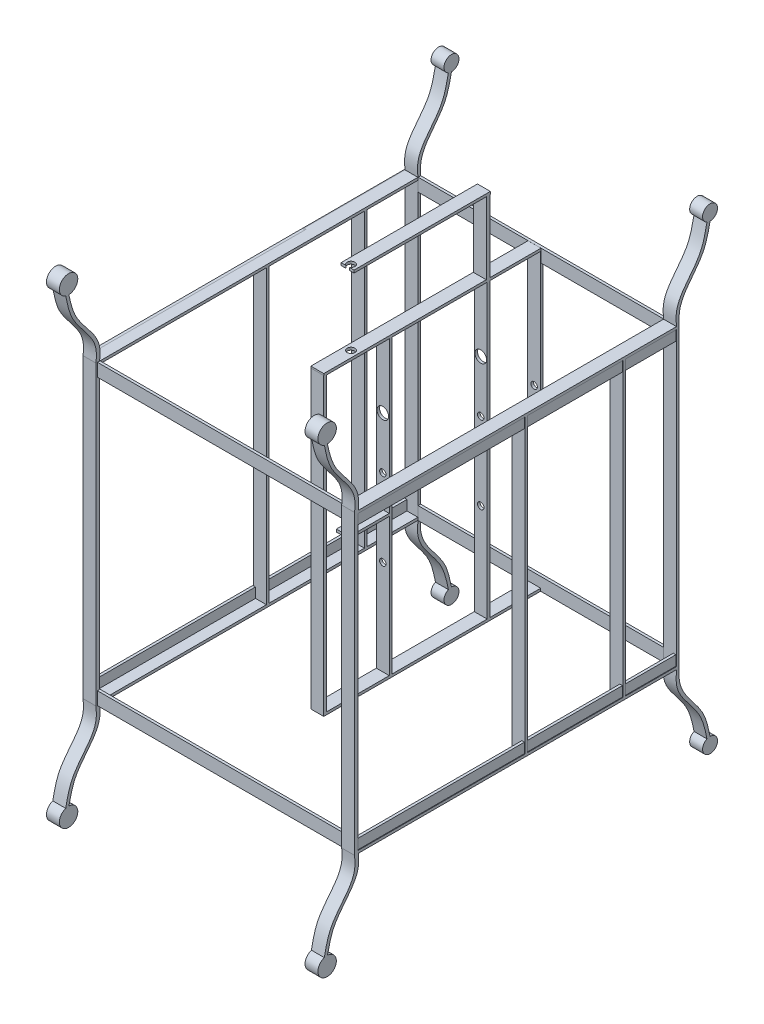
ISO-10303-21;
HEADER;
FILE_DESCRIPTION(('STEP AP214'),'2;1');
FILE_NAME('part.step','',(''),(''),'','','');
FILE_SCHEMA(('AUTOMOTIVE_DESIGN { 1 0 10303 214 1 1 1 1 }'));
ENDSEC;
DATA;
#1=APPLICATION_CONTEXT('core data for automotive mechanical design processes');
#2=APPLICATION_PROTOCOL_DEFINITION('international standard','automotive_design',2000,#1);
#3=PRODUCT_CONTEXT('',#1,'mechanical');
#4=PRODUCT('Part','Part','',(#3));
#5=PRODUCT_RELATED_PRODUCT_CATEGORY('part','',(#4));
#6=PRODUCT_DEFINITION_FORMATION('','',#4);
#7=PRODUCT_DEFINITION_CONTEXT('part definition',#1,'design');
#8=PRODUCT_DEFINITION('design','',#6,#7);
#9=PRODUCT_DEFINITION_SHAPE('','',#8);
#10=(LENGTH_UNIT() NAMED_UNIT(*) SI_UNIT(.MILLI.,.METRE.));
#11=(NAMED_UNIT(*) PLANE_ANGLE_UNIT() SI_UNIT($,.RADIAN.));
#12=(NAMED_UNIT(*) SI_UNIT($,.STERADIAN.) SOLID_ANGLE_UNIT());
#13=UNCERTAINTY_MEASURE_WITH_UNIT(LENGTH_MEASURE(1.E-05),#10,'distance_accuracy_value','');
#14=(GEOMETRIC_REPRESENTATION_CONTEXT(3) GLOBAL_UNCERTAINTY_ASSIGNED_CONTEXT((#13)) GLOBAL_UNIT_ASSIGNED_CONTEXT((#10,
#11,#12)) REPRESENTATION_CONTEXT('',''));
#15=CARTESIAN_POINT('',(0.,0.,0.));
#16=DIRECTION('',(0.,0.,1.));
#17=DIRECTION('',(1.,0.,0.));
#18=AXIS2_PLACEMENT_3D('',#15,#16,#17);
#19=CARTESIAN_POINT('',(-100.465974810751,-274.671978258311,-143.909559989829));
#20=DIRECTION('',(-1.,0.,0.));
#21=DIRECTION('',(0.,0.,1.));
#22=AXIS2_PLACEMENT_3D('',#19,#20,#21);
#23=PLANE('',#22);
#24=DIRECTION('',(0.,0.,1.));
#25=VECTOR('',#24,1.);
#26=CARTESIAN_POINT('',(-100.465974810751,-264.671978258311,-143.909559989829));
#27=LINE('',#26,#25);
#28=CARTESIAN_POINT('',(-100.465974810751,-264.671978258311,-143.909559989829));
#29=VERTEX_POINT('',#28);
#30=CARTESIAN_POINT('',(-100.465974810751,-264.671978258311,106.090440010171));
#31=VERTEX_POINT('',#30);
#32=EDGE_CURVE('E474',#29,#31,#27,.T.);
#33=ORIENTED_EDGE('',*,*,#32,.F.);
#34=DIRECTION('',(0.,1.,0.));
#35=VECTOR('',#34,1.);
#36=CARTESIAN_POINT('',(-100.465974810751,-274.671978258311,-143.909559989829));
#37=LINE('',#36,#35);
#38=CARTESIAN_POINT('',(-100.465974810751,-274.671978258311,-143.909559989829));
#39=VERTEX_POINT('',#38);
#40=EDGE_CURVE('E12',#39,#29,#37,.T.);
#41=ORIENTED_EDGE('',*,*,#40,.F.);
#42=DIRECTION('',(0.,0.,1.));
#43=VECTOR('',#42,1.);
#44=CARTESIAN_POINT('',(-100.465974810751,-274.671978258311,-143.909559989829));
#45=LINE('',#44,#43);
#46=CARTESIAN_POINT('',(-100.465974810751,-274.671978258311,106.090440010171));
#47=VERTEX_POINT('',#46);
#48=EDGE_CURVE('E488',#39,#47,#45,.T.);
#49=ORIENTED_EDGE('',*,*,#48,.T.);
#50=DIRECTION('',(0.,1.,0.));
#51=VECTOR('',#50,1.);
#52=CARTESIAN_POINT('',(-100.465974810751,-274.671978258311,106.090440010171));
#53=LINE('',#52,#51);
#54=EDGE_CURVE('E378',#47,#31,#53,.T.);
#55=ORIENTED_EDGE('',*,*,#54,.T.);
#56=EDGE_LOOP('',(#33,#41,#49,#55));
#57=FACE_BOUND('',#56,.T.);
#58=ADVANCED_FACE('F375',(#57),#23,.T.);
#59=CARTESIAN_POINT('',(109.53402518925,-274.671978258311,-143.909559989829));
#60=DIRECTION('',(0.,0.,-1.));
#61=DIRECTION('',(-1.,0.,0.));
#62=AXIS2_PLACEMENT_3D('',#59,#60,#61);
#63=PLANE('',#62);
#64=DIRECTION('',(-1.,0.,0.));
#65=VECTOR('',#64,1.);
#66=CARTESIAN_POINT('',(109.53402518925,-264.671978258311,-143.909559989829));
#67=LINE('',#66,#65);
#68=CARTESIAN_POINT('',(109.53402518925,-264.671978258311,-143.909559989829));
#69=VERTEX_POINT('',#68);
#70=EDGE_CURVE('E485',#69,#29,#67,.T.);
#71=ORIENTED_EDGE('',*,*,#70,.F.);
#72=DIRECTION('',(0.,1.,0.));
#73=VECTOR('',#72,1.);
#74=CARTESIAN_POINT('',(109.53402518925,-274.671978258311,-143.909559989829));
#75=LINE('',#74,#73);
#76=CARTESIAN_POINT('',(109.53402518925,-274.671978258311,-143.909559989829));
#77=VERTEX_POINT('',#76);
#78=EDGE_CURVE('E383',#77,#69,#75,.T.);
#79=ORIENTED_EDGE('',*,*,#78,.F.);
#80=DIRECTION('',(-1.,0.,0.));
#81=VECTOR('',#80,1.);
#82=CARTESIAN_POINT('',(109.53402518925,-274.671978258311,-143.909559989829));
#83=LINE('',#82,#81);
#84=EDGE_CURVE('E497',#77,#39,#83,.T.);
#85=ORIENTED_EDGE('',*,*,#84,.T.);
#86=ORIENTED_EDGE('',*,*,#40,.T.);
#87=EDGE_LOOP('',(#71,#79,#85,#86));
#88=FACE_BOUND('',#87,.T.);
#89=ADVANCED_FACE('F511',(#88),#63,.T.);
#90=CARTESIAN_POINT('',(109.53402518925,-274.671978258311,106.090440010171));
#91=DIRECTION('',(1.,0.,0.));
#92=DIRECTION('',(0.,0.,-1.));
#93=AXIS2_PLACEMENT_3D('',#90,#91,#92);
#94=PLANE('',#93);
#95=DIRECTION('',(0.,0.,-1.));
#96=VECTOR('',#95,1.);
#97=CARTESIAN_POINT('',(109.53402518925,-264.671978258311,106.090440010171));
#98=LINE('',#97,#96);
#99=CARTESIAN_POINT('',(109.53402518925,-264.671978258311,106.090440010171));
#100=VERTEX_POINT('',#99);
#101=EDGE_CURVE('E482',#100,#69,#98,.T.);
#102=ORIENTED_EDGE('',*,*,#101,.F.);
#103=DIRECTION('',(0.,1.,0.));
#104=VECTOR('',#103,1.);
#105=CARTESIAN_POINT('',(109.53402518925,-274.671978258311,106.090440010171));
#106=LINE('',#105,#104);
#107=CARTESIAN_POINT('',(109.53402518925,-274.671978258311,106.090440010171));
#108=VERTEX_POINT('',#107);
#109=EDGE_CURVE('E500',#108,#100,#106,.T.);
#110=ORIENTED_EDGE('',*,*,#109,.F.);
#111=DIRECTION('',(0.,0.,-1.));
#112=VECTOR('',#111,1.);
#113=CARTESIAN_POINT('',(109.53402518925,-274.671978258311,106.090440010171));
#114=LINE('',#113,#112);
#115=EDGE_CURVE('E494',#108,#77,#114,.T.);
#116=ORIENTED_EDGE('',*,*,#115,.T.);
#117=ORIENTED_EDGE('',*,*,#78,.T.);
#118=EDGE_LOOP('',(#102,#110,#116,#117));
#119=FACE_BOUND('',#118,.T.);
#120=ADVANCED_FACE('F517',(#119),#94,.T.);
#121=CARTESIAN_POINT('',(-100.465974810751,-274.671978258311,106.090440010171));
#122=DIRECTION('',(0.,0.,1.));
#123=DIRECTION('',(1.,0.,0.));
#124=AXIS2_PLACEMENT_3D('',#121,#122,#123);
#125=PLANE('',#124);
#126=DIRECTION('',(1.,0.,0.));
#127=VECTOR('',#126,1.);
#128=CARTESIAN_POINT('',(-100.465974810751,-264.671978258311,106.090440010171));
#129=LINE('',#128,#127);
#130=EDGE_CURVE('E479',#31,#100,#129,.T.);
#131=ORIENTED_EDGE('',*,*,#130,.F.);
#132=ORIENTED_EDGE('',*,*,#54,.F.);
#133=DIRECTION('',(1.,0.,0.));
#134=VECTOR('',#133,1.);
#135=CARTESIAN_POINT('',(-100.465974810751,-274.671978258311,106.090440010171));
#136=LINE('',#135,#134);
#137=EDGE_CURVE('E491',#47,#108,#136,.T.);
#138=ORIENTED_EDGE('',*,*,#137,.T.);
#139=ORIENTED_EDGE('',*,*,#109,.T.);
#140=EDGE_LOOP('',(#131,#132,#138,#139));
#141=FACE_BOUND('',#140,.T.);
#142=ADVANCED_FACE('F508',(#141),#125,.T.);
#143=CARTESIAN_POINT('',(-100.465974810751,-274.671978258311,106.090440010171));
#144=DIRECTION('',(0.,1.,0.));
#145=DIRECTION('',(0.,0.,1.));
#146=AXIS2_PLACEMENT_3D('',#143,#144,#145);
#147=PLANE('',#146);
#148=DIRECTION('',(1.,0.,0.));
#149=VECTOR('',#148,1.);
#150=CARTESIAN_POINT('',(-98.4659748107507,-274.671978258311,104.090440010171));
#151=LINE('',#150,#149);
#152=CARTESIAN_POINT('',(-98.4659748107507,-274.671978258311,104.090440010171));
#153=VERTEX_POINT('',#152);
#154=CARTESIAN_POINT('',(107.53402518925,-274.671978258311,104.090440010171));
#155=VERTEX_POINT('',#154);
#156=EDGE_CURVE('E469',#153,#155,#151,.T.);
#157=ORIENTED_EDGE('',*,*,#156,.T.);
#158=DIRECTION('',(0.,0.,-1.));
#159=VECTOR('',#158,1.);
#160=CARTESIAN_POINT('',(107.53402518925,-274.671978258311,104.090440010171));
#161=LINE('',#160,#159);
#162=CARTESIAN_POINT('',(107.53402518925,-274.671978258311,-141.909559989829));
#163=VERTEX_POINT('',#162);
#164=EDGE_CURVE('E460',#155,#163,#161,.T.);
#165=ORIENTED_EDGE('',*,*,#164,.T.);
#166=DIRECTION('',(-1.,0.,0.));
#167=VECTOR('',#166,1.);
#168=CARTESIAN_POINT('',(107.53402518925,-274.671978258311,-141.909559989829));
#169=LINE('',#168,#167);
#170=CARTESIAN_POINT('',(-98.4659748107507,-274.671978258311,-141.909559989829));
#171=VERTEX_POINT('',#170);
#172=EDGE_CURVE('E466',#163,#171,#169,.T.);
#173=ORIENTED_EDGE('',*,*,#172,.T.);
#174=DIRECTION('',(0.,0.,1.));
#175=VECTOR('',#174,1.);
#176=CARTESIAN_POINT('',(-98.4659748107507,-274.671978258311,-141.909559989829));
#177=LINE('',#176,#175);
#178=EDGE_CURVE('E391',#171,#153,#177,.T.);
#179=ORIENTED_EDGE('',*,*,#178,.T.);
#180=EDGE_LOOP('',(#157,#165,#173,#179));
#181=FACE_BOUND('',#180,.T.);
#182=ORIENTED_EDGE('',*,*,#48,.F.);
#183=ORIENTED_EDGE('',*,*,#84,.F.);
#184=ORIENTED_EDGE('',*,*,#115,.F.);
#185=ORIENTED_EDGE('',*,*,#137,.F.);
#186=EDGE_LOOP('',(#182,#183,#184,#185));
#187=FACE_BOUND('',#186,.T.);
#188=ADVANCED_FACE('F514',(#181,#187),#147,.F.);
#189=CARTESIAN_POINT('',(-100.465974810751,-264.671978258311,106.090440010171));
#190=DIRECTION('',(0.,1.,0.));
#191=DIRECTION('',(0.,0.,1.));
#192=AXIS2_PLACEMENT_3D('',#189,#190,#191);
#193=PLANE('',#192);
#194=DIRECTION('',(0.,0.,-1.));
#195=VECTOR('',#194,1.);
#196=CARTESIAN_POINT('',(107.53402518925,-264.671978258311,104.090440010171));
#197=LINE('',#196,#195);
#198=CARTESIAN_POINT('',(107.53402518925,-264.671978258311,104.090440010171));
#199=VERTEX_POINT('',#198);
#200=CARTESIAN_POINT('',(107.53402518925,-264.671978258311,-141.909559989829));
#201=VERTEX_POINT('',#200);
#202=EDGE_CURVE('E399',#199,#201,#197,.T.);
#203=ORIENTED_EDGE('',*,*,#202,.F.);
#204=DIRECTION('',(1.,0.,0.));
#205=VECTOR('',#204,1.);
#206=CARTESIAN_POINT('',(-98.4659748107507,-264.671978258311,104.090440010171));
#207=LINE('',#206,#205);
#208=CARTESIAN_POINT('',(-98.4659748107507,-264.671978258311,104.090440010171));
#209=VERTEX_POINT('',#208);
#210=EDGE_CURVE('E458',#209,#199,#207,.T.);
#211=ORIENTED_EDGE('',*,*,#210,.F.);
#212=DIRECTION('',(0.,0.,1.));
#213=VECTOR('',#212,1.);
#214=CARTESIAN_POINT('',(-98.4659748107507,-264.671978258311,-141.909559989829));
#215=LINE('',#214,#213);
#216=CARTESIAN_POINT('',(-98.4659748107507,-264.671978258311,-141.909559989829));
#217=VERTEX_POINT('',#216);
#218=EDGE_CURVE('E442',#217,#209,#215,.T.);
#219=ORIENTED_EDGE('',*,*,#218,.F.);
#220=DIRECTION('',(-1.,0.,0.));
#221=VECTOR('',#220,1.);
#222=CARTESIAN_POINT('',(107.53402518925,-264.671978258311,-141.909559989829));
#223=LINE('',#222,#221);
#224=EDGE_CURVE('E451',#201,#217,#223,.T.);
#225=ORIENTED_EDGE('',*,*,#224,.F.);
#226=EDGE_LOOP('',(#203,#211,#219,#225));
#227=FACE_BOUND('',#226,.T.);
#228=ORIENTED_EDGE('',*,*,#32,.T.);
#229=ORIENTED_EDGE('',*,*,#130,.T.);
#230=ORIENTED_EDGE('',*,*,#101,.T.);
#231=ORIENTED_EDGE('',*,*,#70,.T.);
#232=EDGE_LOOP('',(#228,#229,#230,#231));
#233=FACE_BOUND('',#232,.T.);
#234=ADVANCED_FACE('F455',(#227,#233),#193,.T.);
#235=CARTESIAN_POINT('',(107.53402518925,-274.671978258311,104.090440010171));
#236=DIRECTION('',(1.,0.,0.));
#237=DIRECTION('',(0.,0.,-1.));
#238=AXIS2_PLACEMENT_3D('',#235,#236,#237);
#239=PLANE('',#238);
#240=ORIENTED_EDGE('',*,*,#202,.T.);
#241=DIRECTION('',(0.,1.,0.));
#242=VECTOR('',#241,1.);
#243=CARTESIAN_POINT('',(107.53402518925,-274.671978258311,-141.909559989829));
#244=LINE('',#243,#242);
#245=EDGE_CURVE('E448',#163,#201,#244,.T.);
#246=ORIENTED_EDGE('',*,*,#245,.F.);
#247=ORIENTED_EDGE('',*,*,#164,.F.);
#248=DIRECTION('',(0.,1.,0.));
#249=VECTOR('',#248,1.);
#250=CARTESIAN_POINT('',(107.53402518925,-274.671978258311,104.090440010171));
#251=LINE('',#250,#249);
#252=EDGE_CURVE('E472',#155,#199,#251,.T.);
#253=ORIENTED_EDGE('',*,*,#252,.T.);
#254=EDGE_LOOP('',(#240,#246,#247,#253));
#255=FACE_BOUND('',#254,.T.);
#256=ADVANCED_FACE('F552',(#255),#239,.F.);
#257=CARTESIAN_POINT('',(-98.4659748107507,-274.671978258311,104.090440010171));
#258=DIRECTION('',(0.,0.,1.));
#259=DIRECTION('',(1.,0.,0.));
#260=AXIS2_PLACEMENT_3D('',#257,#258,#259);
#261=PLANE('',#260);
#262=ORIENTED_EDGE('',*,*,#210,.T.);
#263=ORIENTED_EDGE('',*,*,#252,.F.);
#264=ORIENTED_EDGE('',*,*,#156,.F.);
#265=DIRECTION('',(0.,1.,0.));
#266=VECTOR('',#265,1.);
#267=CARTESIAN_POINT('',(-98.4659748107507,-274.671978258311,104.090440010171));
#268=LINE('',#267,#266);
#269=EDGE_CURVE('E447',#153,#209,#268,.T.);
#270=ORIENTED_EDGE('',*,*,#269,.T.);
#271=EDGE_LOOP('',(#262,#263,#264,#270));
#272=FACE_BOUND('',#271,.T.);
#273=ADVANCED_FACE('F559',(#272),#261,.F.);
#274=CARTESIAN_POINT('',(-98.4659748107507,-274.671978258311,-141.909559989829));
#275=DIRECTION('',(-1.,0.,0.));
#276=DIRECTION('',(0.,0.,1.));
#277=AXIS2_PLACEMENT_3D('',#274,#275,#276);
#278=PLANE('',#277);
#279=ORIENTED_EDGE('',*,*,#218,.T.);
#280=ORIENTED_EDGE('',*,*,#269,.F.);
#281=ORIENTED_EDGE('',*,*,#178,.F.);
#282=DIRECTION('',(0.,1.,0.));
#283=VECTOR('',#282,1.);
#284=CARTESIAN_POINT('',(-98.4659748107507,-274.671978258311,-141.909559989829));
#285=LINE('',#284,#283);
#286=EDGE_CURVE('E438',#171,#217,#285,.T.);
#287=ORIENTED_EDGE('',*,*,#286,.T.);
#288=EDGE_LOOP('',(#279,#280,#281,#287));
#289=FACE_BOUND('',#288,.T.);
#290=ADVANCED_FACE('F440',(#289),#278,.F.);
#291=CARTESIAN_POINT('',(107.53402518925,-274.671978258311,-141.909559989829));
#292=DIRECTION('',(0.,0.,-1.));
#293=DIRECTION('',(-1.,0.,0.));
#294=AXIS2_PLACEMENT_3D('',#291,#292,#293);
#295=PLANE('',#294);
#296=ORIENTED_EDGE('',*,*,#224,.T.);
#297=ORIENTED_EDGE('',*,*,#286,.F.);
#298=ORIENTED_EDGE('',*,*,#172,.F.);
#299=ORIENTED_EDGE('',*,*,#245,.T.);
#300=EDGE_LOOP('',(#296,#297,#298,#299));
#301=FACE_BOUND('',#300,.T.);
#302=ADVANCED_FACE('F452',(#301),#295,.F.);
#303=CLOSED_SHELL('',(#58,#89,#120,#142,#188,#234,#256,#273,#290,#302));
#304=MANIFOLD_SOLID_BREP('B2',#303);
#305=CARTESIAN_POINT('',(-90.,-15.9864954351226,-154.90234902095));
#306=DIRECTION('',(1.,0.,0.));
#307=DIRECTION('',(0.,0.,-1.));
#308=AXIS2_PLACEMENT_3D('',#305,#306,#307);
#309=PLANE('',#308);
#310=DIRECTION('',(0.,-1.,0.));
#311=VECTOR('',#310,1.);
#312=CARTESIAN_POINT('',(-90.,-46.6655326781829,-102.343160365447));
#313=LINE('',#312,#311);
#314=CARTESIAN_POINT('',(-90.,-46.6655326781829,-102.343160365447));
#315=VERTEX_POINT('',#314);
#316=CARTESIAN_POINT('',(-90.,-272.383742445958,-102.343160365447));
#317=VERTEX_POINT('',#316);
#318=EDGE_CURVE('E829',#315,#317,#313,.T.);
#319=ORIENTED_EDGE('',*,*,#318,.F.);
#320=DIRECTION('',(0.,0.,1.));
#321=VECTOR('',#320,1.);
#322=CARTESIAN_POINT('',(-90.,-46.6655326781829,-102.343160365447));
#323=LINE('',#322,#321);
#324=CARTESIAN_POINT('',(-90.,-46.6655326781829,-141.737453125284));
#325=VERTEX_POINT('',#324);
#326=EDGE_CURVE('E827',#325,#315,#323,.T.);
#327=ORIENTED_EDGE('',*,*,#326,.F.);
#328=DIRECTION('',(0.,1.,0.));
#329=VECTOR('',#328,1.);
#330=CARTESIAN_POINT('',(-90.,-149.74263698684,-141.737453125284));
#331=LINE('',#330,#329);
#332=CARTESIAN_POINT('',(-90.,-272.383742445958,-141.737453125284));
#333=VERTEX_POINT('',#332);
#334=EDGE_CURVE('E834',#333,#325,#331,.T.);
#335=ORIENTED_EDGE('',*,*,#334,.F.);
#336=DIRECTION('',(0.,0.,-1.));
#337=VECTOR('',#336,1.);
#338=CARTESIAN_POINT('',(-90.,-272.383742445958,-102.343160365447));
#339=LINE('',#338,#337);
#340=EDGE_CURVE('E831',#317,#333,#339,.T.);
#341=ORIENTED_EDGE('',*,*,#340,.F.);
#342=EDGE_LOOP('',(#319,#327,#335,#341));
#343=FACE_BOUND('',#342,.T.);
#344=CARTESIAN_POINT('',(-90.,-44.714814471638,-143.646403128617));
#345=CARTESIAN_POINT('',(-90.,-41.2566125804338,-143.616884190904));
#346=CARTESIAN_POINT('',(-90.,-25.946763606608,-143.486200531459));
#347=CARTESIAN_POINT('',(-90.,-10.7823707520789,-162.83833333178));
#348=CARTESIAN_POINT('',(-90.,6.87453441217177,-166.445984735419));
#349=CARTESIAN_POINT('',(-90.,13.0352036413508,-167.704730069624));
#350=B_SPLINE_CURVE_WITH_KNOTS('',3,(#344,#345,#346,#347,#348,#349),.UNSPECIFIED.,.F.,.F.,(4,1,
1,4),(0.,0.159651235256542,0.706793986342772,1.),.UNSPECIFIED.);
#351=CARTESIAN_POINT('',(-90.,-44.714814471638,-143.646403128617));
#352=VERTEX_POINT('',#351);
#353=CARTESIAN_POINT('',(-90.,13.0352036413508,-167.704730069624));
#354=VERTEX_POINT('',#353);
#355=EDGE_CURVE('E949',#352,#354,#350,.T.);
#356=ORIENTED_EDGE('',*,*,#355,.T.);
#357=CARTESIAN_POINT('',(-90.,18.8353693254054,-167.704730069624));
#358=DIRECTION('',(1.,0.,0.));
#359=DIRECTION('',(0.,0.,1.));
#360=AXIS2_PLACEMENT_3D('',#357,#358,#359);
#361=CIRCLE('',#360,5.80016568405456);
#362=CARTESIAN_POINT('',(-90.,13.5460735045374,-165.324546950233));
#363=VERTEX_POINT('',#362);
#364=EDGE_CURVE('E955',#354,#363,#361,.T.);
#365=ORIENTED_EDGE('',*,*,#364,.T.);
#366=CARTESIAN_POINT('',(-90.,13.5460735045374,-165.324546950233));
#367=CARTESIAN_POINT('',(-90.,7.20948308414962,-164.016935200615));
#368=CARTESIAN_POINT('',(-90.,-10.5786316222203,-160.346199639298));
#369=CARTESIAN_POINT('',(-90.,-25.9409141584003,-140.345738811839));
#370=CARTESIAN_POINT('',(-90.,-41.2294846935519,-141.481676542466));
#371=CARTESIAN_POINT('',(-90.,-44.6719782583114,-141.737453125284));
#372=B_SPLINE_CURVE_WITH_KNOTS('',3,(#366,#367,#368,#369,#370,#371),.UNSPECIFIED.,.F.,.F.,(4,1,
1,4),(0.,0.300085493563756,0.842401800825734,1.),.UNSPECIFIED.);
#373=CARTESIAN_POINT('',(-90.,-44.6719782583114,-141.737453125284));
#374=VERTEX_POINT('',#373);
#375=EDGE_CURVE('E960',#363,#374,#372,.T.);
#376=ORIENTED_EDGE('',*,*,#375,.T.);
#377=DIRECTION('',(0.,0.,1.));
#378=VECTOR('',#377,1.);
#379=CARTESIAN_POINT('',(-90.,-44.6719782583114,-141.737453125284));
#380=LINE('',#379,#378);
#381=CARTESIAN_POINT('',(-90.,-44.6719782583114,104.399585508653));
#382=VERTEX_POINT('',#381);
#383=EDGE_CURVE('E965',#374,#382,#380,.T.);
#384=ORIENTED_EDGE('',*,*,#383,.T.);
#385=CARTESIAN_POINT('',(-90.,-44.6719782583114,104.399585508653));
#386=CARTESIAN_POINT('',(-90.,-41.5651805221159,104.183684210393));
#387=CARTESIAN_POINT('',(-90.,-26.5754148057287,103.141997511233));
#388=CARTESIAN_POINT('',(-90.,-11.8207807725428,123.046430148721));
#389=CARTESIAN_POINT('',(-90.,5.67618903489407,126.912193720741));
#390=CARTESIAN_POINT('',(-90.,11.7176588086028,128.246990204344));
#391=B_SPLINE_CURVE_WITH_KNOTS('',3,(#385,#386,#387,#388,#389,#390),.UNSPECIFIED.,.F.,.F.,(4,1,
1,4),(0.,0.146156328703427,0.705179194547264,1.),.UNSPECIFIED.);
#392=CARTESIAN_POINT('',(-90.,11.7176588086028,128.246990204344));
#393=VERTEX_POINT('',#392);
#394=EDGE_CURVE('E1080',#382,#393,#391,.T.);
#395=ORIENTED_EDGE('',*,*,#394,.T.);
#396=CARTESIAN_POINT('',(-90.,18.8353693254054,128.45791244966));
#397=DIRECTION('',(1.,0.,0.));
#398=DIRECTION('',(0.,0.,-1.));
#399=AXIS2_PLACEMENT_3D('',#396,#397,#398);
#400=CIRCLE('',#399,7.12083500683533);
#401=CARTESIAN_POINT('',(-90.,12.0611448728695,130.652490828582));
#402=VERTEX_POINT('',#401);
#403=EDGE_CURVE('E1082',#393,#402,#400,.T.);
#404=ORIENTED_EDGE('',*,*,#403,.T.);
#405=CARTESIAN_POINT('',(-90.,12.0611448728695,130.652490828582));
#406=CARTESIAN_POINT('',(-90.,5.89724741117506,129.430645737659));
#407=CARTESIAN_POINT('',(-90.,-11.7689100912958,125.928752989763));
#408=CARTESIAN_POINT('',(-90.,-26.6042145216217,105.950887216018));
#409=CARTESIAN_POINT('',(-90.,-41.5654800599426,106.993641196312));
#410=CARTESIAN_POINT('',(-90.,-44.6719782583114,107.210154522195));
#411=B_SPLINE_CURVE_WITH_KNOTS('',3,(#405,#406,#407,#408,#409,#410),.UNSPECIFIED.,.F.,.F.,(4,1,
1,4),(0.,0.298056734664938,0.854251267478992,1.),.UNSPECIFIED.);
#412=CARTESIAN_POINT('',(-90.,-44.6719782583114,107.210154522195));
#413=VERTEX_POINT('',#412);
#414=EDGE_CURVE('E1083',#402,#413,#411,.T.);
#415=ORIENTED_EDGE('',*,*,#414,.T.);
#416=DIRECTION('',(0.,-1.,0.));
#417=VECTOR('',#416,1.);
#418=CARTESIAN_POINT('',(-90.,-44.6719782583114,107.210154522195));
#419=LINE('',#418,#417);
#420=CARTESIAN_POINT('',(-90.,-274.383742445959,107.210154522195));
#421=VERTEX_POINT('',#420);
#422=EDGE_CURVE('E1108',#413,#421,#419,.T.);
#423=ORIENTED_EDGE('',*,*,#422,.T.);
#424=CARTESIAN_POINT('',(-90.,-274.383742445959,107.210154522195));
#425=CARTESIAN_POINT('',(-90.,-277.505060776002,106.991847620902));
#426=CARTESIAN_POINT('',(-90.,-292.48203729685,105.944348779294));
#427=CARTESIAN_POINT('',(-90.,-307.330031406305,125.92747892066));
#428=CARTESIAN_POINT('',(-90.,-324.995903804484,129.430316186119));
#429=CARTESIAN_POINT('',(-90.,-331.159701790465,130.652490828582));
#430=B_SPLINE_CURVE_WITH_KNOTS('',3,(#424,#425,#426,#427,#428,#429),.UNSPECIFIED.,.F.,.F.,(4,1,
1,4),(0.,0.146332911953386,0.702147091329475,1.),.UNSPECIFIED.);
#431=CARTESIAN_POINT('',(-90.,-331.159701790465,130.652490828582));
#432=VERTEX_POINT('',#431);
#433=EDGE_CURVE('E1113',#421,#432,#430,.T.);
#434=ORIENTED_EDGE('',*,*,#433,.T.);
#435=CARTESIAN_POINT('',(-90.,-337.933926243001,128.45791244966));
#436=DIRECTION('',(1.,0.,0.));
#437=DIRECTION('',(0.,0.,1.));
#438=AXIS2_PLACEMENT_3D('',#435,#436,#437);
#439=CIRCLE('',#438,7.12083500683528);
#440=CARTESIAN_POINT('',(-90.,-330.816215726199,128.246990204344));
#441=VERTEX_POINT('',#440);
#442=EDGE_CURVE('E1118',#432,#441,#439,.T.);
#443=ORIENTED_EDGE('',*,*,#442,.T.);
#444=CARTESIAN_POINT('',(-90.,-330.816215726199,128.246990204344));
#445=CARTESIAN_POINT('',(-90.,-324.7747490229,126.910508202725));
#446=CARTESIAN_POINT('',(-90.,-307.277788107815,123.039863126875));
#447=CARTESIAN_POINT('',(-90.,-292.523060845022,103.179368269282));
#448=CARTESIAN_POINT('',(-90.,-277.533374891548,104.163699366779));
#449=CARTESIAN_POINT('',(-90.,-274.426578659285,104.36771405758));
#450=B_SPLINE_CURVE_WITH_KNOTS('',3,(#444,#445,#446,#447,#448,#449),.UNSPECIFIED.,.F.,.F.,(4,1,
1,4),(0.,0.294820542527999,0.853842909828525,1.),.UNSPECIFIED.);
#451=CARTESIAN_POINT('',(-90.,-274.426578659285,104.36771405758));
#452=VERTEX_POINT('',#451);
#453=EDGE_CURVE('E1136',#441,#452,#450,.T.);
#454=ORIENTED_EDGE('',*,*,#453,.T.);
#455=DIRECTION('',(0.,0.,-1.));
#456=VECTOR('',#455,1.);
#457=CARTESIAN_POINT('',(-90.,-274.426578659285,104.36771405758));
#458=LINE('',#457,#456);
#459=CARTESIAN_POINT('',(-90.,-274.426578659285,-141.737453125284));
#460=VERTEX_POINT('',#459);
#461=EDGE_CURVE('E1141',#452,#460,#458,.T.);
#462=ORIENTED_EDGE('',*,*,#461,.T.);
#463=CARTESIAN_POINT('',(-90.,-274.426578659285,-141.737453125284));
#464=CARTESIAN_POINT('',(-90.,-277.869072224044,-141.481676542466));
#465=CARTESIAN_POINT('',(-90.,-293.157642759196,-140.345738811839));
#466=CARTESIAN_POINT('',(-90.,-308.519925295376,-160.346199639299));
#467=CARTESIAN_POINT('',(-90.,-326.308040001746,-164.016935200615));
#468=CARTESIAN_POINT('',(-90.,-332.644630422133,-165.324546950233));
#469=B_SPLINE_CURVE_WITH_KNOTS('',3,(#463,#464,#465,#466,#467,#468),.UNSPECIFIED.,.F.,.F.,(4,1,
1,4),(0.,0.157598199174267,0.699914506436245,1.),.UNSPECIFIED.);
#470=CARTESIAN_POINT('',(-90.,-332.644630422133,-165.324546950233));
#471=VERTEX_POINT('',#470);
#472=EDGE_CURVE('E1145',#460,#471,#469,.T.);
#473=ORIENTED_EDGE('',*,*,#472,.T.);
#474=CARTESIAN_POINT('',(-90.,-337.933926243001,-167.704730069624));
#475=DIRECTION('',(1.,0.,0.));
#476=DIRECTION('',(0.,0.,-1.));
#477=AXIS2_PLACEMENT_3D('',#474,#475,#476);
#478=CIRCLE('',#477,5.80016568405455);
#479=CARTESIAN_POINT('',(-90.,-332.133760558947,-167.704730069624));
#480=VERTEX_POINT('',#479);
#481=EDGE_CURVE('E1015',#471,#480,#478,.T.);
#482=ORIENTED_EDGE('',*,*,#481,.T.);
#483=CARTESIAN_POINT('',(-90.,-332.133760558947,-167.704730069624));
#484=CARTESIAN_POINT('',(-90.,-325.973005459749,-166.446142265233));
#485=CARTESIAN_POINT('',(-90.,-308.315854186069,-162.838942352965));
#486=CARTESIAN_POINT('',(-90.,-293.163874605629,-143.495733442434));
#487=CARTESIAN_POINT('',(-90.,-277.869923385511,-143.618714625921));
#488=CARTESIAN_POINT('',(-90.,-274.426578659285,-143.646403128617));
#489=B_SPLINE_CURVE_WITH_KNOTS('',3,(#483,#484,#485,#486,#487,#488),.UNSPECIFIED.,.F.,.F.,(4,1,
1,4),(0.,0.293403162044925,0.840913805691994,1.),.UNSPECIFIED.);
#490=CARTESIAN_POINT('',(-90.,-274.426578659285,-143.646403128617));
#491=VERTEX_POINT('',#490);
#492=EDGE_CURVE('E1008',#480,#491,#489,.T.);
#493=ORIENTED_EDGE('',*,*,#492,.T.);
#494=DIRECTION('',(0.,1.,0.));
#495=VECTOR('',#494,1.);
#496=CARTESIAN_POINT('',(-90.,-44.714814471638,-143.646403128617));
#497=LINE('',#496,#495);
#498=EDGE_CURVE('E1014',#491,#352,#497,.T.);
#499=ORIENTED_EDGE('',*,*,#498,.T.);
#500=EDGE_LOOP('',(#356,#365,#376,#384,#395,#404,#415,#423,#434,#443,#454,#462,#473,#482,#493,#499));
#501=FACE_BOUND('',#500,.T.);
#502=DIRECTION('',(0.,0.,1.));
#503=VECTOR('',#502,1.);
#504=CARTESIAN_POINT('',(-90.,-46.6655326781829,104.577767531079));
#505=LINE('',#504,#503);
#506=CARTESIAN_POINT('',(-90.,-46.6655326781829,-24.5810719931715));
#507=VERTEX_POINT('',#506);
#508=CARTESIAN_POINT('',(-90.,-46.6655326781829,104.577767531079));
#509=VERTEX_POINT('',#508);
#510=EDGE_CURVE('E861',#507,#509,#505,.T.);
#511=ORIENTED_EDGE('',*,*,#510,.F.);
#512=DIRECTION('',(0.,1.,0.));
#513=VECTOR('',#512,1.);
#514=CARTESIAN_POINT('',(-90.,-272.383742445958,-24.5810719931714));
#515=LINE('',#514,#513);
#516=CARTESIAN_POINT('',(-90.,-272.383742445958,-24.5810719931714));
#517=VERTEX_POINT('',#516);
#518=EDGE_CURVE('E859',#517,#507,#515,.T.);
#519=ORIENTED_EDGE('',*,*,#518,.F.);
#520=DIRECTION('',(0.,0.,-1.));
#521=VECTOR('',#520,1.);
#522=CARTESIAN_POINT('',(-90.,-272.383742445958,104.577767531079));
#523=LINE('',#522,#521);
#524=CARTESIAN_POINT('',(-90.,-272.383742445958,104.577767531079));
#525=VERTEX_POINT('',#524);
#526=EDGE_CURVE('E866',#525,#517,#523,.T.);
#527=ORIENTED_EDGE('',*,*,#526,.F.);
#528=DIRECTION('',(0.,-1.,0.));
#529=VECTOR('',#528,1.);
#530=CARTESIAN_POINT('',(-90.,-272.383742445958,104.577767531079));
#531=LINE('',#530,#529);
#532=EDGE_CURVE('E863',#509,#525,#531,.T.);
#533=ORIENTED_EDGE('',*,*,#532,.F.);
#534=EDGE_LOOP('',(#511,#519,#527,#533));
#535=FACE_BOUND('',#534,.T.);
#536=DIRECTION('',(0.,0.,1.));
#537=VECTOR('',#536,1.);
#538=CARTESIAN_POINT('',(-90.,-46.6655326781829,-26.5810719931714));
#539=LINE('',#538,#537);
#540=CARTESIAN_POINT('',(-90.,-46.6655326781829,-100.343160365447));
#541=VERTEX_POINT('',#540);
#542=CARTESIAN_POINT('',(-90.,-46.6655326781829,-26.5810719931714));
#543=VERTEX_POINT('',#542);
#544=EDGE_CURVE('E806',#541,#543,#539,.T.);
#545=ORIENTED_EDGE('',*,*,#544,.F.);
#546=DIRECTION('',(0.,1.,0.));
#547=VECTOR('',#546,1.);
#548=CARTESIAN_POINT('',(-90.,-272.383742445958,-100.343160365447));
#549=LINE('',#548,#547);
#550=CARTESIAN_POINT('',(-90.,-272.383742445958,-100.343160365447));
#551=VERTEX_POINT('',#550);
#552=EDGE_CURVE('E795',#551,#541,#549,.T.);
#553=ORIENTED_EDGE('',*,*,#552,.F.);
#554=DIRECTION('',(0.,0.,-1.));
#555=VECTOR('',#554,1.);
#556=CARTESIAN_POINT('',(-90.,-272.383742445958,-26.5810719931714));
#557=LINE('',#556,#555);
#558=CARTESIAN_POINT('',(-90.,-272.383742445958,-26.5810719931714));
#559=VERTEX_POINT('',#558);
#560=EDGE_CURVE('E810',#559,#551,#557,.T.);
#561=ORIENTED_EDGE('',*,*,#560,.F.);
#562=DIRECTION('',(0.,-1.,0.));
#563=VECTOR('',#562,1.);
#564=CARTESIAN_POINT('',(-90.,-163.727345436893,-26.5810719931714));
#565=LINE('',#564,#563);
#566=EDGE_CURVE('E808',#543,#559,#565,.T.);
#567=ORIENTED_EDGE('',*,*,#566,.F.);
#568=EDGE_LOOP('',(#545,#553,#561,#567));
#569=FACE_BOUND('',#568,.T.);
#570=ADVANCED_FACE('F594',(#343,#501,#535,#569),#309,.T.);
#571=CARTESIAN_POINT('',(-100.,-15.9864954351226,-154.90234902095));
#572=DIRECTION('',(1.,0.,0.));
#573=DIRECTION('',(0.,0.,-1.));
#574=AXIS2_PLACEMENT_3D('',#571,#572,#573);
#575=PLANE('',#574);
#576=DIRECTION('',(0.,0.,1.));
#577=VECTOR('',#576,1.);
#578=CARTESIAN_POINT('',(-100.,-46.6655326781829,-102.343160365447));
#579=LINE('',#578,#577);
#580=CARTESIAN_POINT('',(-100.,-46.6655326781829,-141.737453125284));
#581=VERTEX_POINT('',#580);
#582=CARTESIAN_POINT('',(-100.,-46.6655326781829,-102.343160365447));
#583=VERTEX_POINT('',#582);
#584=EDGE_CURVE('E796',#581,#583,#579,.T.);
#585=ORIENTED_EDGE('',*,*,#584,.T.);
#586=DIRECTION('',(0.,-1.,0.));
#587=VECTOR('',#586,1.);
#588=CARTESIAN_POINT('',(-100.,-46.6655326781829,-102.343160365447));
#589=LINE('',#588,#587);
#590=CARTESIAN_POINT('',(-100.,-272.383742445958,-102.343160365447));
#591=VERTEX_POINT('',#590);
#592=EDGE_CURVE('E818',#583,#591,#589,.T.);
#593=ORIENTED_EDGE('',*,*,#592,.T.);
#594=DIRECTION('',(0.,0.,-1.));
#595=VECTOR('',#594,1.);
#596=CARTESIAN_POINT('',(-100.,-272.383742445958,-102.343160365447));
#597=LINE('',#596,#595);
#598=CARTESIAN_POINT('',(-100.,-272.383742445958,-141.737453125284));
#599=VERTEX_POINT('',#598);
#600=EDGE_CURVE('E821',#591,#599,#597,.T.);
#601=ORIENTED_EDGE('',*,*,#600,.T.);
#602=DIRECTION('',(0.,1.,0.));
#603=VECTOR('',#602,1.);
#604=CARTESIAN_POINT('',(-100.,-149.74263698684,-141.737453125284));
#605=LINE('',#604,#603);
#606=EDGE_CURVE('E824',#599,#581,#605,.T.);
#607=ORIENTED_EDGE('',*,*,#606,.T.);
#608=EDGE_LOOP('',(#585,#593,#601,#607));
#609=FACE_BOUND('',#608,.T.);
#610=CARTESIAN_POINT('',(-100.,-44.714814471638,-143.646403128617));
#611=CARTESIAN_POINT('',(-100.,-41.2566125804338,-143.616884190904));
#612=CARTESIAN_POINT('',(-100.,-25.946763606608,-143.486200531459));
#613=CARTESIAN_POINT('',(-100.,-10.7823707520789,-162.83833333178));
#614=CARTESIAN_POINT('',(-100.,6.87453441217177,-166.445984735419));
#615=CARTESIAN_POINT('',(-100.,13.0352036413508,-167.704730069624));
#616=B_SPLINE_CURVE_WITH_KNOTS('',3,(#610,#611,#612,#613,#614,#615),.UNSPECIFIED.,.F.,.F.,(4,1,
1,4),(0.,0.159651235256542,0.706793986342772,1.),.UNSPECIFIED.);
#617=CARTESIAN_POINT('',(-100.,-44.714814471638,-143.646403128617));
#618=VERTEX_POINT('',#617);
#619=CARTESIAN_POINT('',(-100.,13.0352036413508,-167.704730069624));
#620=VERTEX_POINT('',#619);
#621=EDGE_CURVE('E876',#618,#620,#616,.T.);
#622=ORIENTED_EDGE('',*,*,#621,.F.);
#623=DIRECTION('',(0.,1.,0.));
#624=VECTOR('',#623,1.);
#625=CARTESIAN_POINT('',(-100.,-44.714814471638,-143.646403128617));
#626=LINE('',#625,#624);
#627=CARTESIAN_POINT('',(-100.,-274.426578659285,-143.646403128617));
#628=VERTEX_POINT('',#627);
#629=EDGE_CURVE('E945',#628,#618,#626,.T.);
#630=ORIENTED_EDGE('',*,*,#629,.F.);
#631=CARTESIAN_POINT('',(-100.,-332.133760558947,-167.704730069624));
#632=CARTESIAN_POINT('',(-100.,-325.973005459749,-166.446142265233));
#633=CARTESIAN_POINT('',(-100.,-308.315854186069,-162.838942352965));
#634=CARTESIAN_POINT('',(-100.,-293.163874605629,-143.495733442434));
#635=CARTESIAN_POINT('',(-100.,-277.869923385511,-143.618714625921));
#636=CARTESIAN_POINT('',(-100.,-274.426578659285,-143.646403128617));
#637=B_SPLINE_CURVE_WITH_KNOTS('',3,(#631,#632,#633,#634,#635,#636),.UNSPECIFIED.,.F.,.F.,(4,1,
1,4),(0.,0.293403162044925,0.840913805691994,1.),.UNSPECIFIED.);
#638=CARTESIAN_POINT('',(-100.,-332.133760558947,-167.704730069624));
#639=VERTEX_POINT('',#638);
#640=EDGE_CURVE('E941',#639,#628,#637,.T.);
#641=ORIENTED_EDGE('',*,*,#640,.F.);
#642=CARTESIAN_POINT('',(-100.,-337.933926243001,-167.704730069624));
#643=DIRECTION('',(1.,0.,0.));
#644=DIRECTION('',(0.,0.,-1.));
#645=AXIS2_PLACEMENT_3D('',#642,#643,#644);
#646=CIRCLE('',#645,5.80016568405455);
#647=CARTESIAN_POINT('',(-100.,-332.644630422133,-165.324546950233));
#648=VERTEX_POINT('',#647);
#649=EDGE_CURVE('E936',#648,#639,#646,.T.);
#650=ORIENTED_EDGE('',*,*,#649,.F.);
#651=CARTESIAN_POINT('',(-100.,-274.426578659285,-141.737453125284));
#652=CARTESIAN_POINT('',(-100.,-277.869072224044,-141.481676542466));
#653=CARTESIAN_POINT('',(-100.,-293.157642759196,-140.345738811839));
#654=CARTESIAN_POINT('',(-100.,-308.519925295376,-160.346199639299));
#655=CARTESIAN_POINT('',(-100.,-326.308040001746,-164.016935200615));
#656=CARTESIAN_POINT('',(-100.,-332.644630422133,-165.324546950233));
#657=B_SPLINE_CURVE_WITH_KNOTS('',3,(#651,#652,#653,#654,#655,#656),.UNSPECIFIED.,.F.,.F.,(4,1,
1,4),(0.,0.157598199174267,0.699914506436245,1.),.UNSPECIFIED.);
#658=CARTESIAN_POINT('',(-100.,-274.426578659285,-141.737453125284));
#659=VERTEX_POINT('',#658);
#660=EDGE_CURVE('E932',#659,#648,#657,.T.);
#661=ORIENTED_EDGE('',*,*,#660,.F.);
#662=DIRECTION('',(0.,0.,-1.));
#663=VECTOR('',#662,1.);
#664=CARTESIAN_POINT('',(-100.,-274.426578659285,104.36771405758));
#665=LINE('',#664,#663);
#666=CARTESIAN_POINT('',(-100.,-274.426578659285,104.36771405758));
#667=VERTEX_POINT('',#666);
#668=EDGE_CURVE('E927',#667,#659,#665,.T.);
#669=ORIENTED_EDGE('',*,*,#668,.F.);
#670=CARTESIAN_POINT('',(-100.,-330.816215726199,128.246990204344));
#671=CARTESIAN_POINT('',(-100.,-324.7747490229,126.910508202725));
#672=CARTESIAN_POINT('',(-100.,-307.277788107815,123.039863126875));
#673=CARTESIAN_POINT('',(-100.,-292.523060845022,103.179368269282));
#674=CARTESIAN_POINT('',(-100.,-277.533374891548,104.163699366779));
#675=CARTESIAN_POINT('',(-100.,-274.426578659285,104.36771405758));
#676=B_SPLINE_CURVE_WITH_KNOTS('',3,(#670,#671,#672,#673,#674,#675),.UNSPECIFIED.,.F.,.F.,(4,1,
1,4),(0.,0.294820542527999,0.853842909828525,1.),.UNSPECIFIED.);
#677=CARTESIAN_POINT('',(-100.,-330.816215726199,128.246990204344));
#678=VERTEX_POINT('',#677);
#679=EDGE_CURVE('E923',#678,#667,#676,.T.);
#680=ORIENTED_EDGE('',*,*,#679,.F.);
#681=CARTESIAN_POINT('',(-100.,-337.933926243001,128.45791244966));
#682=DIRECTION('',(1.,0.,0.));
#683=DIRECTION('',(0.,0.,1.));
#684=AXIS2_PLACEMENT_3D('',#681,#682,#683);
#685=CIRCLE('',#684,7.12083500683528);
#686=CARTESIAN_POINT('',(-100.,-331.159701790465,130.652490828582));
#687=VERTEX_POINT('',#686);
#688=EDGE_CURVE('E918',#687,#678,#685,.T.);
#689=ORIENTED_EDGE('',*,*,#688,.F.);
#690=CARTESIAN_POINT('',(-100.,-274.383742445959,107.210154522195));
#691=CARTESIAN_POINT('',(-100.,-277.505060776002,106.991847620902));
#692=CARTESIAN_POINT('',(-100.,-292.48203729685,105.944348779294));
#693=CARTESIAN_POINT('',(-100.,-307.330031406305,125.92747892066));
#694=CARTESIAN_POINT('',(-100.,-324.995903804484,129.430316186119));
#695=CARTESIAN_POINT('',(-100.,-331.159701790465,130.652490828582));
#696=B_SPLINE_CURVE_WITH_KNOTS('',3,(#690,#691,#692,#693,#694,#695),.UNSPECIFIED.,.F.,.F.,(4,1,
1,4),(0.,0.146332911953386,0.702147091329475,1.),.UNSPECIFIED.);
#697=CARTESIAN_POINT('',(-100.,-274.383742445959,107.210154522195));
#698=VERTEX_POINT('',#697);
#699=EDGE_CURVE('E914',#698,#687,#696,.T.);
#700=ORIENTED_EDGE('',*,*,#699,.F.);
#701=DIRECTION('',(0.,-1.,0.));
#702=VECTOR('',#701,1.);
#703=CARTESIAN_POINT('',(-100.,-238.05367060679,107.210154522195));
#704=LINE('',#703,#702);
#705=CARTESIAN_POINT('',(-100.,-44.6719782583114,107.210154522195));
#706=VERTEX_POINT('',#705);
#707=EDGE_CURVE('E909',#706,#698,#704,.T.);
#708=ORIENTED_EDGE('',*,*,#707,.F.);
#709=CARTESIAN_POINT('',(-100.,12.0611448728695,130.652490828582));
#710=CARTESIAN_POINT('',(-100.,5.89724741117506,129.430645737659));
#711=CARTESIAN_POINT('',(-100.,-11.7689100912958,125.928752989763));
#712=CARTESIAN_POINT('',(-100.,-26.6042145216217,105.950887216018));
#713=CARTESIAN_POINT('',(-100.,-41.5654800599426,106.993641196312));
#714=CARTESIAN_POINT('',(-100.,-44.6719782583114,107.210154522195));
#715=B_SPLINE_CURVE_WITH_KNOTS('',3,(#709,#710,#711,#712,#713,#714),.UNSPECIFIED.,.F.,.F.,(4,1,
1,4),(0.,0.298056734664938,0.854251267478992,1.),.UNSPECIFIED.);
#716=CARTESIAN_POINT('',(-100.,12.0611448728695,130.652490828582));
#717=VERTEX_POINT('',#716);
#718=EDGE_CURVE('E904',#717,#706,#715,.T.);
#719=ORIENTED_EDGE('',*,*,#718,.F.);
#720=CARTESIAN_POINT('',(-100.,18.8353693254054,128.45791244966));
#721=DIRECTION('',(1.,0.,0.));
#722=DIRECTION('',(0.,0.,-1.));
#723=AXIS2_PLACEMENT_3D('',#720,#721,#722);
#724=CIRCLE('',#723,7.12083500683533);
#725=CARTESIAN_POINT('',(-100.,11.7176588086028,128.246990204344));
#726=VERTEX_POINT('',#725);
#727=EDGE_CURVE('E899',#726,#717,#724,.T.);
#728=ORIENTED_EDGE('',*,*,#727,.F.);
#729=CARTESIAN_POINT('',(-100.,-44.6719782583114,104.399585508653));
#730=CARTESIAN_POINT('',(-100.,-41.5651805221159,104.183684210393));
#731=CARTESIAN_POINT('',(-100.,-26.5754148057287,103.141997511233));
#732=CARTESIAN_POINT('',(-100.,-11.8207807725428,123.046430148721));
#733=CARTESIAN_POINT('',(-100.,5.67618903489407,126.912193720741));
#734=CARTESIAN_POINT('',(-100.,11.7176588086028,128.246990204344));
#735=B_SPLINE_CURVE_WITH_KNOTS('',3,(#729,#730,#731,#732,#733,#734),.UNSPECIFIED.,.F.,.F.,(4,1,
1,4),(0.,0.146156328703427,0.705179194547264,1.),.UNSPECIFIED.);
#736=CARTESIAN_POINT('',(-100.,-44.6719782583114,104.399585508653));
#737=VERTEX_POINT('',#736);
#738=EDGE_CURVE('E895',#737,#726,#735,.T.);
#739=ORIENTED_EDGE('',*,*,#738,.F.);
#740=DIRECTION('',(0.,0.,1.));
#741=VECTOR('',#740,1.);
#742=CARTESIAN_POINT('',(-100.,-44.6719782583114,-141.737453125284));
#743=LINE('',#742,#741);
#744=CARTESIAN_POINT('',(-100.,-44.6719782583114,-141.737453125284));
#745=VERTEX_POINT('',#744);
#746=EDGE_CURVE('E890',#745,#737,#743,.T.);
#747=ORIENTED_EDGE('',*,*,#746,.F.);
#748=CARTESIAN_POINT('',(-100.,13.5460735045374,-165.324546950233));
#749=CARTESIAN_POINT('',(-100.,7.20948308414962,-164.016935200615));
#750=CARTESIAN_POINT('',(-100.,-10.5786316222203,-160.346199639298));
#751=CARTESIAN_POINT('',(-100.,-25.9409141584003,-140.345738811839));
#752=CARTESIAN_POINT('',(-100.,-41.2294846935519,-141.481676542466));
#753=CARTESIAN_POINT('',(-100.,-44.6719782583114,-141.737453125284));
#754=B_SPLINE_CURVE_WITH_KNOTS('',3,(#748,#749,#750,#751,#752,#753),.UNSPECIFIED.,.F.,.F.,(4,1,
1,4),(0.,0.300085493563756,0.842401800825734,1.),.UNSPECIFIED.);
#755=CARTESIAN_POINT('',(-100.,13.5460735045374,-165.324546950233));
#756=VERTEX_POINT('',#755);
#757=EDGE_CURVE('E886',#756,#745,#754,.T.);
#758=ORIENTED_EDGE('',*,*,#757,.F.);
#759=CARTESIAN_POINT('',(-100.,18.8353693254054,-167.704730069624));
#760=DIRECTION('',(1.,0.,0.));
#761=DIRECTION('',(0.,0.,1.));
#762=AXIS2_PLACEMENT_3D('',#759,#760,#761);
#763=CIRCLE('',#762,5.80016568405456);
#764=EDGE_CURVE('E881',#620,#756,#763,.T.);
#765=ORIENTED_EDGE('',*,*,#764,.F.);
#766=EDGE_LOOP('',(#622,#630,#641,#650,#661,#669,#680,#689,#700,#708,#719,#728,#739,#747,#758,#765));
#767=FACE_BOUND('',#766,.T.);
#768=DIRECTION('',(0.,1.,0.));
#769=VECTOR('',#768,1.);
#770=CARTESIAN_POINT('',(-100.,-46.6655326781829,-24.5810719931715));
#771=LINE('',#770,#769);
#772=CARTESIAN_POINT('',(-100.,-272.383742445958,-24.5810719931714));
#773=VERTEX_POINT('',#772);
#774=CARTESIAN_POINT('',(-100.,-46.6655326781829,-24.5810719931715));
#775=VERTEX_POINT('',#774);
#776=EDGE_CURVE('E847',#773,#775,#771,.T.);
#777=ORIENTED_EDGE('',*,*,#776,.T.);
#778=DIRECTION('',(0.,0.,1.));
#779=VECTOR('',#778,1.);
#780=CARTESIAN_POINT('',(-100.,-46.6655326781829,104.577767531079));
#781=LINE('',#780,#779);
#782=CARTESIAN_POINT('',(-100.,-46.6655326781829,104.577767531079));
#783=VERTEX_POINT('',#782);
#784=EDGE_CURVE('E850',#775,#783,#781,.T.);
#785=ORIENTED_EDGE('',*,*,#784,.T.);
#786=DIRECTION('',(0.,-1.,0.));
#787=VECTOR('',#786,1.);
#788=CARTESIAN_POINT('',(-100.,-272.383742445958,104.577767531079));
#789=LINE('',#788,#787);
#790=CARTESIAN_POINT('',(-100.,-272.383742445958,104.577767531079));
#791=VERTEX_POINT('',#790);
#792=EDGE_CURVE('E853',#783,#791,#789,.T.);
#793=ORIENTED_EDGE('',*,*,#792,.T.);
#794=DIRECTION('',(0.,0.,-1.));
#795=VECTOR('',#794,1.);
#796=CARTESIAN_POINT('',(-100.,-272.383742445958,104.577767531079));
#797=LINE('',#796,#795);
#798=EDGE_CURVE('E856',#791,#773,#797,.T.);
#799=ORIENTED_EDGE('',*,*,#798,.T.);
#800=EDGE_LOOP('',(#777,#785,#793,#799));
#801=FACE_BOUND('',#800,.T.);
#802=DIRECTION('',(0.,1.,0.));
#803=VECTOR('',#802,1.);
#804=CARTESIAN_POINT('',(-100.,-272.383742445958,-100.343160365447));
#805=LINE('',#804,#803);
#806=CARTESIAN_POINT('',(-100.,-272.383742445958,-100.343160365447));
#807=VERTEX_POINT('',#806);
#808=CARTESIAN_POINT('',(-100.,-46.6655326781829,-100.343160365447));
#809=VERTEX_POINT('',#808);
#810=EDGE_CURVE('E618',#807,#809,#805,.T.);
#811=ORIENTED_EDGE('',*,*,#810,.T.);
#812=DIRECTION('',(0.,0.,1.));
#813=VECTOR('',#812,1.);
#814=CARTESIAN_POINT('',(-100.,-46.6655326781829,-26.5810719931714));
#815=LINE('',#814,#813);
#816=CARTESIAN_POINT('',(-100.,-46.6655326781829,-26.5810719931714));
#817=VERTEX_POINT('',#816);
#818=EDGE_CURVE('E783',#809,#817,#815,.T.);
#819=ORIENTED_EDGE('',*,*,#818,.T.);
#820=DIRECTION('',(0.,-1.,0.));
#821=VECTOR('',#820,1.);
#822=CARTESIAN_POINT('',(-100.,-165.083212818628,-26.5810719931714));
#823=LINE('',#822,#821);
#824=CARTESIAN_POINT('',(-100.,-272.383742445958,-26.5810719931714));
#825=VERTEX_POINT('',#824);
#826=EDGE_CURVE('E791',#817,#825,#823,.T.);
#827=ORIENTED_EDGE('',*,*,#826,.T.);
#828=DIRECTION('',(0.,0.,-1.));
#829=VECTOR('',#828,1.);
#830=CARTESIAN_POINT('',(-100.,-272.383742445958,-26.5810719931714));
#831=LINE('',#830,#829);
#832=EDGE_CURVE('E800',#825,#807,#831,.T.);
#833=ORIENTED_EDGE('',*,*,#832,.T.);
#834=EDGE_LOOP('',(#811,#819,#827,#833));
#835=FACE_BOUND('',#834,.T.);
#836=ADVANCED_FACE('F799',(#609,#767,#801,#835),#575,.F.);
#837=DIRECTION('',(-1.,0.,0.));
#838=VECTOR('',#837,1.);
#839=SURFACE_OF_LINEAR_EXTRUSION('',#350,#838);
#840=ORIENTED_EDGE('',*,*,#621,.T.);
#841=DIRECTION('',(-1.,0.,0.));
#842=VECTOR('',#841,1.);
#843=CARTESIAN_POINT('',(-90.,13.0352036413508,-167.704730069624));
#844=LINE('',#843,#842);
#845=EDGE_CURVE('E373',#354,#620,#844,.T.);
#846=ORIENTED_EDGE('',*,*,#845,.F.);
#847=ORIENTED_EDGE('',*,*,#355,.F.);
#848=DIRECTION('',(-1.,0.,0.));
#849=VECTOR('',#848,1.);
#850=CARTESIAN_POINT('',(-90.,-44.714814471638,-143.646403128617));
#851=LINE('',#850,#849);
#852=EDGE_CURVE('E1021',#352,#618,#851,.T.);
#853=ORIENTED_EDGE('',*,*,#852,.T.);
#854=EDGE_LOOP('',(#840,#846,#847,#853));
#855=FACE_BOUND('',#854,.T.);
#856=ADVANCED_FACE('F596',(#855),#839,.F.);
#857=CARTESIAN_POINT('',(-90.,18.8353693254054,-167.704730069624));
#858=DIRECTION('',(-1.,0.,0.));
#859=DIRECTION('',(0.,0.,1.));
#860=AXIS2_PLACEMENT_3D('',#857,#858,#859);
#861=CYLINDRICAL_SURFACE('',#860,5.80016568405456);
#862=ORIENTED_EDGE('',*,*,#764,.T.);
#863=DIRECTION('',(-1.,0.,0.));
#864=VECTOR('',#863,1.);
#865=CARTESIAN_POINT('',(-90.,13.5460735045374,-165.324546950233));
#866=LINE('',#865,#864);
#867=EDGE_CURVE('E603',#363,#756,#866,.T.);
#868=ORIENTED_EDGE('',*,*,#867,.F.);
#869=ORIENTED_EDGE('',*,*,#364,.F.);
#870=ORIENTED_EDGE('',*,*,#845,.T.);
#871=EDGE_LOOP('',(#862,#868,#869,#870));
#872=FACE_BOUND('',#871,.T.);
#873=ADVANCED_FACE('F975',(#872),#861,.T.);
#874=DIRECTION('',(-1.,0.,0.));
#875=VECTOR('',#874,1.);
#876=SURFACE_OF_LINEAR_EXTRUSION('',#372,#875);
#877=ORIENTED_EDGE('',*,*,#757,.T.);
#878=DIRECTION('',(-1.,0.,0.));
#879=VECTOR('',#878,1.);
#880=CARTESIAN_POINT('',(-90.,-44.6719782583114,-141.737453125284));
#881=LINE('',#880,#879);
#882=EDGE_CURVE('E1060',#374,#745,#881,.T.);
#883=ORIENTED_EDGE('',*,*,#882,.F.);
#884=ORIENTED_EDGE('',*,*,#375,.F.);
#885=ORIENTED_EDGE('',*,*,#867,.T.);
#886=EDGE_LOOP('',(#877,#883,#884,#885));
#887=FACE_BOUND('',#886,.T.);
#888=ADVANCED_FACE('F971',(#887),#876,.F.);
#889=CARTESIAN_POINT('',(-90.,-44.6719782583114,-141.737453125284));
#890=DIRECTION('',(0.,-1.,0.));
#891=DIRECTION('',(0.,0.,-1.));
#892=AXIS2_PLACEMENT_3D('',#889,#890,#891);
#893=PLANE('',#892);
#894=ORIENTED_EDGE('',*,*,#746,.T.);
#895=DIRECTION('',(-1.,0.,0.));
#896=VECTOR('',#895,1.);
#897=CARTESIAN_POINT('',(-90.,-44.6719782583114,104.399585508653));
#898=LINE('',#897,#896);
#899=EDGE_CURVE('E1057',#382,#737,#898,.T.);
#900=ORIENTED_EDGE('',*,*,#899,.F.);
#901=ORIENTED_EDGE('',*,*,#383,.F.);
#902=ORIENTED_EDGE('',*,*,#882,.T.);
#903=EDGE_LOOP('',(#894,#900,#901,#902));
#904=FACE_BOUND('',#903,.T.);
#905=ADVANCED_FACE('F974',(#904),#893,.F.);
#906=DIRECTION('',(-1.,0.,0.));
#907=VECTOR('',#906,1.);
#908=SURFACE_OF_LINEAR_EXTRUSION('',#391,#907);
#909=ORIENTED_EDGE('',*,*,#738,.T.);
#910=DIRECTION('',(-1.,0.,0.));
#911=VECTOR('',#910,1.);
#912=CARTESIAN_POINT('',(-90.,11.7176588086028,128.246990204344));
#913=LINE('',#912,#911);
#914=EDGE_CURVE('E1054',#393,#726,#913,.T.);
#915=ORIENTED_EDGE('',*,*,#914,.F.);
#916=ORIENTED_EDGE('',*,*,#394,.F.);
#917=ORIENTED_EDGE('',*,*,#899,.T.);
#918=EDGE_LOOP('',(#909,#915,#916,#917));
#919=FACE_BOUND('',#918,.T.);
#920=ADVANCED_FACE('F1078',(#919),#908,.F.);
#921=CARTESIAN_POINT('',(-90.,18.8353693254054,128.45791244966));
#922=DIRECTION('',(-1.,0.,0.));
#923=DIRECTION('',(0.,0.,1.));
#924=AXIS2_PLACEMENT_3D('',#921,#922,#923);
#925=CYLINDRICAL_SURFACE('',#924,7.12083500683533);
#926=ORIENTED_EDGE('',*,*,#727,.T.);
#927=DIRECTION('',(-1.,0.,0.));
#928=VECTOR('',#927,1.);
#929=CARTESIAN_POINT('',(-90.,12.0611448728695,130.652490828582));
#930=LINE('',#929,#928);
#931=EDGE_CURVE('E1051',#402,#717,#930,.T.);
#932=ORIENTED_EDGE('',*,*,#931,.F.);
#933=ORIENTED_EDGE('',*,*,#403,.F.);
#934=ORIENTED_EDGE('',*,*,#914,.T.);
#935=EDGE_LOOP('',(#926,#932,#933,#934));
#936=FACE_BOUND('',#935,.T.);
#937=ADVANCED_FACE('F1094',(#936),#925,.T.);
#938=DIRECTION('',(-1.,0.,0.));
#939=VECTOR('',#938,1.);
#940=SURFACE_OF_LINEAR_EXTRUSION('',#411,#939);
#941=ORIENTED_EDGE('',*,*,#718,.T.);
#942=DIRECTION('',(-1.,0.,0.));
#943=VECTOR('',#942,1.);
#944=CARTESIAN_POINT('',(-90.,-44.6719782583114,107.210154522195));
#945=LINE('',#944,#943);
#946=EDGE_CURVE('E1048',#413,#706,#945,.T.);
#947=ORIENTED_EDGE('',*,*,#946,.F.);
#948=ORIENTED_EDGE('',*,*,#414,.F.);
#949=ORIENTED_EDGE('',*,*,#931,.T.);
#950=EDGE_LOOP('',(#941,#947,#948,#949));
#951=FACE_BOUND('',#950,.T.);
#952=ADVANCED_FACE('F1097',(#951),#940,.F.);
#953=CARTESIAN_POINT('',(-90.,-238.05367060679,107.210154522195));
#954=DIRECTION('',(0.,0.,-1.));
#955=DIRECTION('',(0.,1.,0.));
#956=AXIS2_PLACEMENT_3D('',#953,#954,#955);
#957=PLANE('',#956);
#958=ORIENTED_EDGE('',*,*,#707,.T.);
#959=DIRECTION('',(-1.,0.,0.));
#960=VECTOR('',#959,1.);
#961=CARTESIAN_POINT('',(-90.,-274.383742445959,107.210154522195));
#962=LINE('',#961,#960);
#963=EDGE_CURVE('E1045',#421,#698,#962,.T.);
#964=ORIENTED_EDGE('',*,*,#963,.F.);
#965=ORIENTED_EDGE('',*,*,#422,.F.);
#966=ORIENTED_EDGE('',*,*,#946,.T.);
#967=EDGE_LOOP('',(#958,#964,#965,#966));
#968=FACE_BOUND('',#967,.T.);
#969=ADVANCED_FACE('F1101',(#968),#957,.F.);
#970=DIRECTION('',(-1.,0.,0.));
#971=VECTOR('',#970,1.);
#972=SURFACE_OF_LINEAR_EXTRUSION('',#430,#971);
#973=ORIENTED_EDGE('',*,*,#699,.T.);
#974=DIRECTION('',(-1.,0.,0.));
#975=VECTOR('',#974,1.);
#976=CARTESIAN_POINT('',(-90.,-331.159701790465,130.652490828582));
#977=LINE('',#976,#975);
#978=EDGE_CURVE('E1042',#432,#687,#977,.T.);
#979=ORIENTED_EDGE('',*,*,#978,.F.);
#980=ORIENTED_EDGE('',*,*,#433,.F.);
#981=ORIENTED_EDGE('',*,*,#963,.T.);
#982=EDGE_LOOP('',(#973,#979,#980,#981));
#983=FACE_BOUND('',#982,.T.);
#984=ADVANCED_FACE('F1123',(#983),#972,.F.);
#985=CARTESIAN_POINT('',(-90.,-337.933926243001,128.45791244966));
#986=DIRECTION('',(-1.,0.,0.));
#987=DIRECTION('',(0.,0.,1.));
#988=AXIS2_PLACEMENT_3D('',#985,#986,#987);
#989=CYLINDRICAL_SURFACE('',#988,7.12083500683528);
#990=ORIENTED_EDGE('',*,*,#688,.T.);
#991=DIRECTION('',(-1.,0.,0.));
#992=VECTOR('',#991,1.);
#993=CARTESIAN_POINT('',(-90.,-330.816215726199,128.246990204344));
#994=LINE('',#993,#992);
#995=EDGE_CURVE('E1039',#441,#678,#994,.T.);
#996=ORIENTED_EDGE('',*,*,#995,.F.);
#997=ORIENTED_EDGE('',*,*,#442,.F.);
#998=ORIENTED_EDGE('',*,*,#978,.T.);
#999=EDGE_LOOP('',(#990,#996,#997,#998));
#1000=FACE_BOUND('',#999,.T.);
#1001=ADVANCED_FACE('F1126',(#1000),#989,.T.);
#1002=DIRECTION('',(-1.,0.,0.));
#1003=VECTOR('',#1002,1.);
#1004=SURFACE_OF_LINEAR_EXTRUSION('',#450,#1003);
#1005=ORIENTED_EDGE('',*,*,#679,.T.);
#1006=DIRECTION('',(-1.,0.,0.));
#1007=VECTOR('',#1006,1.);
#1008=CARTESIAN_POINT('',(-90.,-274.426578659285,104.36771405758));
#1009=LINE('',#1008,#1007);
#1010=EDGE_CURVE('E1036',#452,#667,#1009,.T.);
#1011=ORIENTED_EDGE('',*,*,#1010,.F.);
#1012=ORIENTED_EDGE('',*,*,#453,.F.);
#1013=ORIENTED_EDGE('',*,*,#995,.T.);
#1014=EDGE_LOOP('',(#1005,#1011,#1012,#1013));
#1015=FACE_BOUND('',#1014,.T.);
#1016=ADVANCED_FACE('F1130',(#1015),#1004,.F.);
#1017=CARTESIAN_POINT('',(-90.,-274.426578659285,104.36771405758));
#1018=DIRECTION('',(0.,1.,0.));
#1019=DIRECTION('',(0.,0.,1.));
#1020=AXIS2_PLACEMENT_3D('',#1017,#1018,#1019);
#1021=PLANE('',#1020);
#1022=ORIENTED_EDGE('',*,*,#668,.T.);
#1023=DIRECTION('',(-1.,0.,0.));
#1024=VECTOR('',#1023,1.);
#1025=CARTESIAN_POINT('',(-90.,-274.426578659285,-141.737453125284));
#1026=LINE('',#1025,#1024);
#1027=EDGE_CURVE('E1033',#460,#659,#1026,.T.);
#1028=ORIENTED_EDGE('',*,*,#1027,.F.);
#1029=ORIENTED_EDGE('',*,*,#461,.F.);
#1030=ORIENTED_EDGE('',*,*,#1010,.T.);
#1031=EDGE_LOOP('',(#1022,#1028,#1029,#1030));
#1032=FACE_BOUND('',#1031,.T.);
#1033=ADVANCED_FACE('F1134',(#1032),#1021,.F.);
#1034=DIRECTION('',(-1.,0.,0.));
#1035=VECTOR('',#1034,1.);
#1036=SURFACE_OF_LINEAR_EXTRUSION('',#469,#1035);
#1037=ORIENTED_EDGE('',*,*,#660,.T.);
#1038=DIRECTION('',(-1.,0.,0.));
#1039=VECTOR('',#1038,1.);
#1040=CARTESIAN_POINT('',(-90.,-332.644630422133,-165.324546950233));
#1041=LINE('',#1040,#1039);
#1042=EDGE_CURVE('E1030',#471,#648,#1041,.T.);
#1043=ORIENTED_EDGE('',*,*,#1042,.F.);
#1044=ORIENTED_EDGE('',*,*,#472,.F.);
#1045=ORIENTED_EDGE('',*,*,#1027,.T.);
#1046=EDGE_LOOP('',(#1037,#1043,#1044,#1045));
#1047=FACE_BOUND('',#1046,.T.);
#1048=ADVANCED_FACE('F1152',(#1047),#1036,.F.);
#1049=CARTESIAN_POINT('',(-90.,-337.933926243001,-167.704730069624));
#1050=DIRECTION('',(-1.,0.,0.));
#1051=DIRECTION('',(0.,0.,1.));
#1052=AXIS2_PLACEMENT_3D('',#1049,#1050,#1051);
#1053=CYLINDRICAL_SURFACE('',#1052,5.80016568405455);
#1054=ORIENTED_EDGE('',*,*,#649,.T.);
#1055=DIRECTION('',(-1.,0.,0.));
#1056=VECTOR('',#1055,1.);
#1057=CARTESIAN_POINT('',(-90.,-332.133760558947,-167.704730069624));
#1058=LINE('',#1057,#1056);
#1059=EDGE_CURVE('E1027',#480,#639,#1058,.T.);
#1060=ORIENTED_EDGE('',*,*,#1059,.F.);
#1061=ORIENTED_EDGE('',*,*,#481,.F.);
#1062=ORIENTED_EDGE('',*,*,#1042,.T.);
#1063=EDGE_LOOP('',(#1054,#1060,#1061,#1062));
#1064=FACE_BOUND('',#1063,.T.);
#1065=ADVANCED_FACE('F1005',(#1064),#1053,.T.);
#1066=DIRECTION('',(-1.,0.,0.));
#1067=VECTOR('',#1066,1.);
#1068=SURFACE_OF_LINEAR_EXTRUSION('',#489,#1067);
#1069=ORIENTED_EDGE('',*,*,#640,.T.);
#1070=DIRECTION('',(-1.,0.,0.));
#1071=VECTOR('',#1070,1.);
#1072=CARTESIAN_POINT('',(-90.,-274.426578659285,-143.646403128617));
#1073=LINE('',#1072,#1071);
#1074=EDGE_CURVE('E1024',#491,#628,#1073,.T.);
#1075=ORIENTED_EDGE('',*,*,#1074,.F.);
#1076=ORIENTED_EDGE('',*,*,#492,.F.);
#1077=ORIENTED_EDGE('',*,*,#1059,.T.);
#1078=EDGE_LOOP('',(#1069,#1075,#1076,#1077));
#1079=FACE_BOUND('',#1078,.T.);
#1080=ADVANCED_FACE('F1000',(#1079),#1068,.F.);
#1081=CARTESIAN_POINT('',(-90.,-44.714814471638,-143.646403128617));
#1082=DIRECTION('',(0.,0.,1.));
#1083=DIRECTION('',(1.,0.,0.));
#1084=AXIS2_PLACEMENT_3D('',#1081,#1082,#1083);
#1085=PLANE('',#1084);
#1086=ORIENTED_EDGE('',*,*,#629,.T.);
#1087=ORIENTED_EDGE('',*,*,#852,.F.);
#1088=ORIENTED_EDGE('',*,*,#498,.F.);
#1089=ORIENTED_EDGE('',*,*,#1074,.T.);
#1090=EDGE_LOOP('',(#1086,#1087,#1088,#1089));
#1091=FACE_BOUND('',#1090,.T.);
#1092=ADVANCED_FACE('F996',(#1091),#1085,.F.);
#1093=CARTESIAN_POINT('',(-90.,-46.6655326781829,-24.5810719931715));
#1094=DIRECTION('',(0.,0.,1.));
#1095=DIRECTION('',(1.,0.,0.));
#1096=AXIS2_PLACEMENT_3D('',#1093,#1094,#1095);
#1097=PLANE('',#1096);
#1098=ORIENTED_EDGE('',*,*,#776,.F.);
#1099=DIRECTION('',(-1.,0.,0.));
#1100=VECTOR('',#1099,1.);
#1101=CARTESIAN_POINT('',(-90.,-272.383742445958,-24.5810719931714));
#1102=LINE('',#1101,#1100);
#1103=EDGE_CURVE('E868',#517,#773,#1102,.T.);
#1104=ORIENTED_EDGE('',*,*,#1103,.F.);
#1105=ORIENTED_EDGE('',*,*,#518,.T.);
#1106=DIRECTION('',(-1.,0.,0.));
#1107=VECTOR('',#1106,1.);
#1108=CARTESIAN_POINT('',(-90.,-46.6655326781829,-24.5810719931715));
#1109=LINE('',#1108,#1107);
#1110=EDGE_CURVE('E874',#507,#775,#1109,.T.);
#1111=ORIENTED_EDGE('',*,*,#1110,.T.);
#1112=EDGE_LOOP('',(#1098,#1104,#1105,#1111));
#1113=FACE_BOUND('',#1112,.T.);
#1114=ADVANCED_FACE('F999',(#1113),#1097,.T.);
#1115=CARTESIAN_POINT('',(-90.,-46.6655326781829,104.577767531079));
#1116=DIRECTION('',(0.,-1.,0.));
#1117=DIRECTION('',(0.,0.,-1.));
#1118=AXIS2_PLACEMENT_3D('',#1115,#1116,#1117);
#1119=PLANE('',#1118);
#1120=ORIENTED_EDGE('',*,*,#784,.F.);
#1121=ORIENTED_EDGE('',*,*,#1110,.F.);
#1122=ORIENTED_EDGE('',*,*,#510,.T.);
#1123=DIRECTION('',(-1.,0.,0.));
#1124=VECTOR('',#1123,1.);
#1125=CARTESIAN_POINT('',(-90.,-46.6655326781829,104.577767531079));
#1126=LINE('',#1125,#1124);
#1127=EDGE_CURVE('E872',#509,#783,#1126,.T.);
#1128=ORIENTED_EDGE('',*,*,#1127,.T.);
#1129=EDGE_LOOP('',(#1120,#1121,#1122,#1128));
#1130=FACE_BOUND('',#1129,.T.);
#1131=ADVANCED_FACE('F1238',(#1130),#1119,.T.);
#1132=CARTESIAN_POINT('',(-90.,-272.383742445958,104.577767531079));
#1133=DIRECTION('',(0.,0.,-1.));
#1134=DIRECTION('',(-1.,0.,0.));
#1135=AXIS2_PLACEMENT_3D('',#1132,#1133,#1134);
#1136=PLANE('',#1135);
#1137=ORIENTED_EDGE('',*,*,#792,.F.);
#1138=ORIENTED_EDGE('',*,*,#1127,.F.);
#1139=ORIENTED_EDGE('',*,*,#532,.T.);
#1140=DIRECTION('',(-1.,0.,0.));
#1141=VECTOR('',#1140,1.);
#1142=CARTESIAN_POINT('',(-90.,-272.383742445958,104.577767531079));
#1143=LINE('',#1142,#1141);
#1144=EDGE_CURVE('E870',#525,#791,#1143,.T.);
#1145=ORIENTED_EDGE('',*,*,#1144,.T.);
#1146=EDGE_LOOP('',(#1137,#1138,#1139,#1145));
#1147=FACE_BOUND('',#1146,.T.);
#1148=ADVANCED_FACE('F1251',(#1147),#1136,.T.);
#1149=CARTESIAN_POINT('',(-90.,-272.383742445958,104.577767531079));
#1150=DIRECTION('',(0.,1.,0.));
#1151=DIRECTION('',(0.,0.,1.));
#1152=AXIS2_PLACEMENT_3D('',#1149,#1150,#1151);
#1153=PLANE('',#1152);
#1154=ORIENTED_EDGE('',*,*,#798,.F.);
#1155=ORIENTED_EDGE('',*,*,#1144,.F.);
#1156=ORIENTED_EDGE('',*,*,#526,.T.);
#1157=ORIENTED_EDGE('',*,*,#1103,.T.);
#1158=EDGE_LOOP('',(#1154,#1155,#1156,#1157));
#1159=FACE_BOUND('',#1158,.T.);
#1160=ADVANCED_FACE('F1259',(#1159),#1153,.T.);
#1161=CARTESIAN_POINT('',(-90.,-46.6655326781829,-102.343160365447));
#1162=DIRECTION('',(0.,-1.,0.));
#1163=DIRECTION('',(0.,0.,-1.));
#1164=AXIS2_PLACEMENT_3D('',#1161,#1162,#1163);
#1165=PLANE('',#1164);
#1166=ORIENTED_EDGE('',*,*,#584,.F.);
#1167=DIRECTION('',(-1.,0.,0.));
#1168=VECTOR('',#1167,1.);
#1169=CARTESIAN_POINT('',(-90.,-46.6655326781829,-141.737453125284));
#1170=LINE('',#1169,#1168);
#1171=EDGE_CURVE('E836',#325,#581,#1170,.T.);
#1172=ORIENTED_EDGE('',*,*,#1171,.F.);
#1173=ORIENTED_EDGE('',*,*,#326,.T.);
#1174=DIRECTION('',(-1.,0.,0.));
#1175=VECTOR('',#1174,1.);
#1176=CARTESIAN_POINT('',(-90.,-46.6655326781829,-102.343160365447));
#1177=LINE('',#1176,#1175);
#1178=EDGE_CURVE('E844',#315,#583,#1177,.T.);
#1179=ORIENTED_EDGE('',*,*,#1178,.T.);
#1180=EDGE_LOOP('',(#1166,#1172,#1173,#1179));
#1181=FACE_BOUND('',#1180,.T.);
#1182=ADVANCED_FACE('F1267',(#1181),#1165,.T.);
#1183=CARTESIAN_POINT('',(-90.,-46.6655326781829,-102.343160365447));
#1184=DIRECTION('',(0.,0.,-1.));
#1185=DIRECTION('',(-1.,0.,0.));
#1186=AXIS2_PLACEMENT_3D('',#1183,#1184,#1185);
#1187=PLANE('',#1186);
#1188=ORIENTED_EDGE('',*,*,#592,.F.);
#1189=ORIENTED_EDGE('',*,*,#1178,.F.);
#1190=ORIENTED_EDGE('',*,*,#318,.T.);
#1191=DIRECTION('',(-1.,0.,0.));
#1192=VECTOR('',#1191,1.);
#1193=CARTESIAN_POINT('',(-90.,-272.383742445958,-102.343160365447));
#1194=LINE('',#1193,#1192);
#1195=EDGE_CURVE('E842',#317,#591,#1194,.T.);
#1196=ORIENTED_EDGE('',*,*,#1195,.T.);
#1197=EDGE_LOOP('',(#1188,#1189,#1190,#1196));
#1198=FACE_BOUND('',#1197,.T.);
#1199=ADVANCED_FACE('F1275',(#1198),#1187,.T.);
#1200=CARTESIAN_POINT('',(-90.,-272.383742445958,-102.343160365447));
#1201=DIRECTION('',(0.,1.,0.));
#1202=DIRECTION('',(0.,0.,1.));
#1203=AXIS2_PLACEMENT_3D('',#1200,#1201,#1202);
#1204=PLANE('',#1203);
#1205=ORIENTED_EDGE('',*,*,#600,.F.);
#1206=ORIENTED_EDGE('',*,*,#1195,.F.);
#1207=ORIENTED_EDGE('',*,*,#340,.T.);
#1208=DIRECTION('',(-1.,0.,0.));
#1209=VECTOR('',#1208,1.);
#1210=CARTESIAN_POINT('',(-90.,-272.383742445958,-141.737453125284));
#1211=LINE('',#1210,#1209);
#1212=EDGE_CURVE('E839',#333,#599,#1211,.T.);
#1213=ORIENTED_EDGE('',*,*,#1212,.T.);
#1214=EDGE_LOOP('',(#1205,#1206,#1207,#1213));
#1215=FACE_BOUND('',#1214,.T.);
#1216=ADVANCED_FACE('F1283',(#1215),#1204,.T.);
#1217=CARTESIAN_POINT('',(-90.,-149.74263698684,-141.737453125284));
#1218=DIRECTION('',(0.,0.,1.));
#1219=DIRECTION('',(1.,0.,0.));
#1220=AXIS2_PLACEMENT_3D('',#1217,#1218,#1219);
#1221=PLANE('',#1220);
#1222=ORIENTED_EDGE('',*,*,#606,.F.);
#1223=ORIENTED_EDGE('',*,*,#1212,.F.);
#1224=ORIENTED_EDGE('',*,*,#334,.T.);
#1225=ORIENTED_EDGE('',*,*,#1171,.T.);
#1226=EDGE_LOOP('',(#1222,#1223,#1224,#1225));
#1227=FACE_BOUND('',#1226,.T.);
#1228=ADVANCED_FACE('F1291',(#1227),#1221,.T.);
#1229=CARTESIAN_POINT('',(-90.,-272.383742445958,-100.343160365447));
#1230=DIRECTION('',(0.,0.,1.));
#1231=DIRECTION('',(1.,0.,0.));
#1232=AXIS2_PLACEMENT_3D('',#1229,#1230,#1231);
#1233=PLANE('',#1232);
#1234=ORIENTED_EDGE('',*,*,#810,.F.);
#1235=DIRECTION('',(-1.,0.,0.));
#1236=VECTOR('',#1235,1.);
#1237=CARTESIAN_POINT('',(-90.,-272.383742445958,-100.343160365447));
#1238=LINE('',#1237,#1236);
#1239=EDGE_CURVE('E812',#551,#807,#1238,.T.);
#1240=ORIENTED_EDGE('',*,*,#1239,.F.);
#1241=ORIENTED_EDGE('',*,*,#552,.T.);
#1242=DIRECTION('',(-1.,0.,0.));
#1243=VECTOR('',#1242,1.);
#1244=CARTESIAN_POINT('',(-90.,-46.6655326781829,-100.343160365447));
#1245=LINE('',#1244,#1243);
#1246=EDGE_CURVE('E785',#541,#809,#1245,.T.);
#1247=ORIENTED_EDGE('',*,*,#1246,.T.);
#1248=EDGE_LOOP('',(#1234,#1240,#1241,#1247));
#1249=FACE_BOUND('',#1248,.T.);
#1250=ADVANCED_FACE('F793',(#1249),#1233,.T.);
#1251=CARTESIAN_POINT('',(-90.,-46.6655326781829,-26.5810719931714));
#1252=DIRECTION('',(0.,-1.,0.));
#1253=DIRECTION('',(0.,0.,-1.));
#1254=AXIS2_PLACEMENT_3D('',#1251,#1252,#1253);
#1255=PLANE('',#1254);
#1256=ORIENTED_EDGE('',*,*,#818,.F.);
#1257=ORIENTED_EDGE('',*,*,#1246,.F.);
#1258=ORIENTED_EDGE('',*,*,#544,.T.);
#1259=DIRECTION('',(-1.,0.,0.));
#1260=VECTOR('',#1259,1.);
#1261=CARTESIAN_POINT('',(-90.,-46.6655326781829,-26.5810719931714));
#1262=LINE('',#1261,#1260);
#1263=EDGE_CURVE('E788',#543,#817,#1262,.T.);
#1264=ORIENTED_EDGE('',*,*,#1263,.T.);
#1265=EDGE_LOOP('',(#1256,#1257,#1258,#1264));
#1266=FACE_BOUND('',#1265,.T.);
#1267=ADVANCED_FACE('F784',(#1266),#1255,.T.);
#1268=CARTESIAN_POINT('',(-90.,-165.083212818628,-26.5810719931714));
#1269=DIRECTION('',(0.,0.,-1.));
#1270=DIRECTION('',(-1.,0.,0.));
#1271=AXIS2_PLACEMENT_3D('',#1268,#1269,#1270);
#1272=PLANE('',#1271);
#1273=ORIENTED_EDGE('',*,*,#826,.F.);
#1274=ORIENTED_EDGE('',*,*,#1263,.F.);
#1275=ORIENTED_EDGE('',*,*,#566,.T.);
#1276=DIRECTION('',(-1.,0.,0.));
#1277=VECTOR('',#1276,1.);
#1278=CARTESIAN_POINT('',(-90.,-272.383742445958,-26.5810719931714));
#1279=LINE('',#1278,#1277);
#1280=EDGE_CURVE('E610',#559,#825,#1279,.T.);
#1281=ORIENTED_EDGE('',*,*,#1280,.T.);
#1282=EDGE_LOOP('',(#1273,#1274,#1275,#1281));
#1283=FACE_BOUND('',#1282,.T.);
#1284=ADVANCED_FACE('F1315',(#1283),#1272,.T.);
#1285=CARTESIAN_POINT('',(-90.,-272.383742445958,-26.5810719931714));
#1286=DIRECTION('',(0.,1.,0.));
#1287=DIRECTION('',(0.,0.,1.));
#1288=AXIS2_PLACEMENT_3D('',#1285,#1286,#1287);
#1289=PLANE('',#1288);
#1290=ORIENTED_EDGE('',*,*,#832,.F.);
#1291=ORIENTED_EDGE('',*,*,#1280,.F.);
#1292=ORIENTED_EDGE('',*,*,#560,.T.);
#1293=ORIENTED_EDGE('',*,*,#1239,.T.);
#1294=EDGE_LOOP('',(#1290,#1291,#1292,#1293));
#1295=FACE_BOUND('',#1294,.T.);
#1296=ADVANCED_FACE('F1322',(#1295),#1289,.T.);
#1297=CLOSED_SHELL('',(#570,#836,#856,#873,#888,#905,#920,#937,#952,#969,#984,#1001,#1016,#1033,
#1048,#1065,#1080,#1092,#1114,#1131,#1148,#1160,#1182,#1199,#1216,#1228,#1250,#1267,#1284,#1296));
#1298=MANIFOLD_SOLID_BREP('B6',#1297);
#1299=CARTESIAN_POINT('',(-100.465974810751,-54.6719782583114,-143.909559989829));
#1300=DIRECTION('',(-1.,0.,0.));
#1301=DIRECTION('',(0.,0.,1.));
#1302=AXIS2_PLACEMENT_3D('',#1299,#1300,#1301);
#1303=PLANE('',#1302);
#1304=DIRECTION('',(0.,0.,1.));
#1305=VECTOR('',#1304,1.);
#1306=CARTESIAN_POINT('',(-100.465974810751,-44.6719782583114,-143.909559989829));
#1307=LINE('',#1306,#1305);
#1308=CARTESIAN_POINT('',(-100.465974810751,-44.6719782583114,-143.909559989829));
#1309=VERTEX_POINT('',#1308);
#1310=CARTESIAN_POINT('',(-100.465974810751,-44.6719782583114,106.090440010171));
#1311=VERTEX_POINT('',#1310);
#1312=EDGE_CURVE('E1502',#1309,#1311,#1307,.T.);
#1313=ORIENTED_EDGE('',*,*,#1312,.F.);
#1314=DIRECTION('',(0.,1.,0.));
#1315=VECTOR('',#1314,1.);
#1316=CARTESIAN_POINT('',(-100.465974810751,-54.6719782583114,-143.909559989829));
#1317=LINE('',#1316,#1315);
#1318=CARTESIAN_POINT('',(-100.465974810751,-54.6719782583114,-143.909559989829));
#1319=VERTEX_POINT('',#1318);
#1320=EDGE_CURVE('E592',#1319,#1309,#1317,.T.);
#1321=ORIENTED_EDGE('',*,*,#1320,.F.);
#1322=DIRECTION('',(0.,0.,1.));
#1323=VECTOR('',#1322,1.);
#1324=CARTESIAN_POINT('',(-100.465974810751,-54.6719782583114,-143.909559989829));
#1325=LINE('',#1324,#1323);
#1326=CARTESIAN_POINT('',(-100.465974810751,-54.6719782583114,106.090440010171));
#1327=VERTEX_POINT('',#1326);
#1328=EDGE_CURVE('E1516',#1319,#1327,#1325,.T.);
#1329=ORIENTED_EDGE('',*,*,#1328,.T.);
#1330=DIRECTION('',(0.,1.,0.));
#1331=VECTOR('',#1330,1.);
#1332=CARTESIAN_POINT('',(-100.465974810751,-54.6719782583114,106.090440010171));
#1333=LINE('',#1332,#1331);
#1334=EDGE_CURVE('E1406',#1327,#1311,#1333,.T.);
#1335=ORIENTED_EDGE('',*,*,#1334,.T.);
#1336=EDGE_LOOP('',(#1313,#1321,#1329,#1335));
#1337=FACE_BOUND('',#1336,.T.);
#1338=ADVANCED_FACE('F1403',(#1337),#1303,.T.);
#1339=CARTESIAN_POINT('',(109.53402518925,-54.6719782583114,-143.909559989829));
#1340=DIRECTION('',(0.,0.,-1.));
#1341=DIRECTION('',(-1.,0.,0.));
#1342=AXIS2_PLACEMENT_3D('',#1339,#1340,#1341);
#1343=PLANE('',#1342);
#1344=DIRECTION('',(-1.,0.,0.));
#1345=VECTOR('',#1344,1.);
#1346=CARTESIAN_POINT('',(109.53402518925,-44.6719782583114,-143.909559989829));
#1347=LINE('',#1346,#1345);
#1348=CARTESIAN_POINT('',(109.53402518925,-44.6719782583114,-143.909559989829));
#1349=VERTEX_POINT('',#1348);
#1350=EDGE_CURVE('E1513',#1349,#1309,#1347,.T.);
#1351=ORIENTED_EDGE('',*,*,#1350,.F.);
#1352=DIRECTION('',(0.,1.,0.));
#1353=VECTOR('',#1352,1.);
#1354=CARTESIAN_POINT('',(109.53402518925,-54.6719782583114,-143.909559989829));
#1355=LINE('',#1354,#1353);
#1356=CARTESIAN_POINT('',(109.53402518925,-54.6719782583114,-143.909559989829));
#1357=VERTEX_POINT('',#1356);
#1358=EDGE_CURVE('E1411',#1357,#1349,#1355,.T.);
#1359=ORIENTED_EDGE('',*,*,#1358,.F.);
#1360=DIRECTION('',(-1.,0.,0.));
#1361=VECTOR('',#1360,1.);
#1362=CARTESIAN_POINT('',(109.53402518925,-54.6719782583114,-143.909559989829));
#1363=LINE('',#1362,#1361);
#1364=EDGE_CURVE('E1525',#1357,#1319,#1363,.T.);
#1365=ORIENTED_EDGE('',*,*,#1364,.T.);
#1366=ORIENTED_EDGE('',*,*,#1320,.T.);
#1367=EDGE_LOOP('',(#1351,#1359,#1365,#1366));
#1368=FACE_BOUND('',#1367,.T.);
#1369=ADVANCED_FACE('F1539',(#1368),#1343,.T.);
#1370=CARTESIAN_POINT('',(109.53402518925,-54.6719782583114,106.090440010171));
#1371=DIRECTION('',(1.,0.,0.));
#1372=DIRECTION('',(0.,0.,-1.));
#1373=AXIS2_PLACEMENT_3D('',#1370,#1371,#1372);
#1374=PLANE('',#1373);
#1375=DIRECTION('',(0.,0.,-1.));
#1376=VECTOR('',#1375,1.);
#1377=CARTESIAN_POINT('',(109.53402518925,-44.6719782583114,106.090440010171));
#1378=LINE('',#1377,#1376);
#1379=CARTESIAN_POINT('',(109.53402518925,-44.6719782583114,106.090440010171));
#1380=VERTEX_POINT('',#1379);
#1381=EDGE_CURVE('E1510',#1380,#1349,#1378,.T.);
#1382=ORIENTED_EDGE('',*,*,#1381,.F.);
#1383=DIRECTION('',(0.,1.,0.));
#1384=VECTOR('',#1383,1.);
#1385=CARTESIAN_POINT('',(109.53402518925,-54.6719782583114,106.090440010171));
#1386=LINE('',#1385,#1384);
#1387=CARTESIAN_POINT('',(109.53402518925,-54.6719782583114,106.090440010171));
#1388=VERTEX_POINT('',#1387);
#1389=EDGE_CURVE('E1528',#1388,#1380,#1386,.T.);
#1390=ORIENTED_EDGE('',*,*,#1389,.F.);
#1391=DIRECTION('',(0.,0.,-1.));
#1392=VECTOR('',#1391,1.);
#1393=CARTESIAN_POINT('',(109.53402518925,-54.6719782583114,106.090440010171));
#1394=LINE('',#1393,#1392);
#1395=EDGE_CURVE('E1522',#1388,#1357,#1394,.T.);
#1396=ORIENTED_EDGE('',*,*,#1395,.T.);
#1397=ORIENTED_EDGE('',*,*,#1358,.T.);
#1398=EDGE_LOOP('',(#1382,#1390,#1396,#1397));
#1399=FACE_BOUND('',#1398,.T.);
#1400=ADVANCED_FACE('F1545',(#1399),#1374,.T.);
#1401=CARTESIAN_POINT('',(-100.465974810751,-54.6719782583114,106.090440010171));
#1402=DIRECTION('',(0.,0.,1.));
#1403=DIRECTION('',(1.,0.,0.));
#1404=AXIS2_PLACEMENT_3D('',#1401,#1402,#1403);
#1405=PLANE('',#1404);
#1406=DIRECTION('',(1.,0.,0.));
#1407=VECTOR('',#1406,1.);
#1408=CARTESIAN_POINT('',(-100.465974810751,-44.6719782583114,106.090440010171));
#1409=LINE('',#1408,#1407);
#1410=EDGE_CURVE('E1507',#1311,#1380,#1409,.T.);
#1411=ORIENTED_EDGE('',*,*,#1410,.F.);
#1412=ORIENTED_EDGE('',*,*,#1334,.F.);
#1413=DIRECTION('',(1.,0.,0.));
#1414=VECTOR('',#1413,1.);
#1415=CARTESIAN_POINT('',(-100.465974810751,-54.6719782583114,106.090440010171));
#1416=LINE('',#1415,#1414);
#1417=EDGE_CURVE('E1519',#1327,#1388,#1416,.T.);
#1418=ORIENTED_EDGE('',*,*,#1417,.T.);
#1419=ORIENTED_EDGE('',*,*,#1389,.T.);
#1420=EDGE_LOOP('',(#1411,#1412,#1418,#1419));
#1421=FACE_BOUND('',#1420,.T.);
#1422=ADVANCED_FACE('F1536',(#1421),#1405,.T.);
#1423=CARTESIAN_POINT('',(-100.465974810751,-54.6719782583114,106.090440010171));
#1424=DIRECTION('',(0.,1.,0.));
#1425=DIRECTION('',(0.,0.,1.));
#1426=AXIS2_PLACEMENT_3D('',#1423,#1424,#1425);
#1427=PLANE('',#1426);
#1428=DIRECTION('',(1.,0.,0.));
#1429=VECTOR('',#1428,1.);
#1430=CARTESIAN_POINT('',(-98.4659748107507,-54.6719782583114,104.090440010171));
#1431=LINE('',#1430,#1429);
#1432=CARTESIAN_POINT('',(-98.4659748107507,-54.6719782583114,104.090440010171));
#1433=VERTEX_POINT('',#1432);
#1434=CARTESIAN_POINT('',(107.53402518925,-54.6719782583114,104.090440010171));
#1435=VERTEX_POINT('',#1434);
#1436=EDGE_CURVE('E1497',#1433,#1435,#1431,.T.);
#1437=ORIENTED_EDGE('',*,*,#1436,.T.);
#1438=DIRECTION('',(0.,0.,-1.));
#1439=VECTOR('',#1438,1.);
#1440=CARTESIAN_POINT('',(107.53402518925,-54.6719782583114,104.090440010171));
#1441=LINE('',#1440,#1439);
#1442=CARTESIAN_POINT('',(107.53402518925,-54.6719782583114,-141.909559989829));
#1443=VERTEX_POINT('',#1442);
#1444=EDGE_CURVE('E1488',#1435,#1443,#1441,.T.);
#1445=ORIENTED_EDGE('',*,*,#1444,.T.);
#1446=DIRECTION('',(-1.,0.,0.));
#1447=VECTOR('',#1446,1.);
#1448=CARTESIAN_POINT('',(107.53402518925,-54.6719782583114,-141.909559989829));
#1449=LINE('',#1448,#1447);
#1450=CARTESIAN_POINT('',(-98.4659748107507,-54.6719782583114,-141.909559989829));
#1451=VERTEX_POINT('',#1450);
#1452=EDGE_CURVE('E1494',#1443,#1451,#1449,.T.);
#1453=ORIENTED_EDGE('',*,*,#1452,.T.);
#1454=DIRECTION('',(0.,0.,1.));
#1455=VECTOR('',#1454,1.);
#1456=CARTESIAN_POINT('',(-98.4659748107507,-54.6719782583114,-141.909559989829));
#1457=LINE('',#1456,#1455);
#1458=EDGE_CURVE('E1419',#1451,#1433,#1457,.T.);
#1459=ORIENTED_EDGE('',*,*,#1458,.T.);
#1460=EDGE_LOOP('',(#1437,#1445,#1453,#1459));
#1461=FACE_BOUND('',#1460,.T.);
#1462=ORIENTED_EDGE('',*,*,#1328,.F.);
#1463=ORIENTED_EDGE('',*,*,#1364,.F.);
#1464=ORIENTED_EDGE('',*,*,#1395,.F.);
#1465=ORIENTED_EDGE('',*,*,#1417,.F.);
#1466=EDGE_LOOP('',(#1462,#1463,#1464,#1465));
#1467=FACE_BOUND('',#1466,.T.);
#1468=ADVANCED_FACE('F1542',(#1461,#1467),#1427,.F.);
#1469=CARTESIAN_POINT('',(-100.465974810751,-44.6719782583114,106.090440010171));
#1470=DIRECTION('',(0.,1.,0.));
#1471=DIRECTION('',(0.,0.,1.));
#1472=AXIS2_PLACEMENT_3D('',#1469,#1470,#1471);
#1473=PLANE('',#1472);
#1474=DIRECTION('',(0.,0.,-1.));
#1475=VECTOR('',#1474,1.);
#1476=CARTESIAN_POINT('',(107.53402518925,-44.6719782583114,104.090440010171));
#1477=LINE('',#1476,#1475);
#1478=CARTESIAN_POINT('',(107.53402518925,-44.6719782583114,104.090440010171));
#1479=VERTEX_POINT('',#1478);
#1480=CARTESIAN_POINT('',(107.53402518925,-44.6719782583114,-141.909559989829));
#1481=VERTEX_POINT('',#1480);
#1482=EDGE_CURVE('E1427',#1479,#1481,#1477,.T.);
#1483=ORIENTED_EDGE('',*,*,#1482,.F.);
#1484=DIRECTION('',(1.,0.,0.));
#1485=VECTOR('',#1484,1.);
#1486=CARTESIAN_POINT('',(-98.4659748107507,-44.6719782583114,104.090440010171));
#1487=LINE('',#1486,#1485);
#1488=CARTESIAN_POINT('',(-98.4659748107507,-44.6719782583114,104.090440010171));
#1489=VERTEX_POINT('',#1488);
#1490=EDGE_CURVE('E1486',#1489,#1479,#1487,.T.);
#1491=ORIENTED_EDGE('',*,*,#1490,.F.);
#1492=DIRECTION('',(0.,0.,1.));
#1493=VECTOR('',#1492,1.);
#1494=CARTESIAN_POINT('',(-98.4659748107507,-44.6719782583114,-141.909559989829));
#1495=LINE('',#1494,#1493);
#1496=CARTESIAN_POINT('',(-98.4659748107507,-44.6719782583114,-141.909559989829));
#1497=VERTEX_POINT('',#1496);
#1498=EDGE_CURVE('E1470',#1497,#1489,#1495,.T.);
#1499=ORIENTED_EDGE('',*,*,#1498,.F.);
#1500=DIRECTION('',(-1.,0.,0.));
#1501=VECTOR('',#1500,1.);
#1502=CARTESIAN_POINT('',(107.53402518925,-44.6719782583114,-141.909559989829));
#1503=LINE('',#1502,#1501);
#1504=EDGE_CURVE('E1479',#1481,#1497,#1503,.T.);
#1505=ORIENTED_EDGE('',*,*,#1504,.F.);
#1506=EDGE_LOOP('',(#1483,#1491,#1499,#1505));
#1507=FACE_BOUND('',#1506,.T.);
#1508=ORIENTED_EDGE('',*,*,#1312,.T.);
#1509=ORIENTED_EDGE('',*,*,#1410,.T.);
#1510=ORIENTED_EDGE('',*,*,#1381,.T.);
#1511=ORIENTED_EDGE('',*,*,#1350,.T.);
#1512=EDGE_LOOP('',(#1508,#1509,#1510,#1511));
#1513=FACE_BOUND('',#1512,.T.);
#1514=ADVANCED_FACE('F1483',(#1507,#1513),#1473,.T.);
#1515=CARTESIAN_POINT('',(107.53402518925,-54.6719782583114,104.090440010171));
#1516=DIRECTION('',(1.,0.,0.));
#1517=DIRECTION('',(0.,0.,-1.));
#1518=AXIS2_PLACEMENT_3D('',#1515,#1516,#1517);
#1519=PLANE('',#1518);
#1520=ORIENTED_EDGE('',*,*,#1482,.T.);
#1521=DIRECTION('',(0.,1.,0.));
#1522=VECTOR('',#1521,1.);
#1523=CARTESIAN_POINT('',(107.53402518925,-54.6719782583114,-141.909559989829));
#1524=LINE('',#1523,#1522);
#1525=EDGE_CURVE('E1476',#1443,#1481,#1524,.T.);
#1526=ORIENTED_EDGE('',*,*,#1525,.F.);
#1527=ORIENTED_EDGE('',*,*,#1444,.F.);
#1528=DIRECTION('',(0.,1.,0.));
#1529=VECTOR('',#1528,1.);
#1530=CARTESIAN_POINT('',(107.53402518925,-54.6719782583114,104.090440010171));
#1531=LINE('',#1530,#1529);
#1532=EDGE_CURVE('E1500',#1435,#1479,#1531,.T.);
#1533=ORIENTED_EDGE('',*,*,#1532,.T.);
#1534=EDGE_LOOP('',(#1520,#1526,#1527,#1533));
#1535=FACE_BOUND('',#1534,.T.);
#1536=ADVANCED_FACE('F1581',(#1535),#1519,.F.);
#1537=CARTESIAN_POINT('',(-98.4659748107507,-54.6719782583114,104.090440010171));
#1538=DIRECTION('',(0.,0.,1.));
#1539=DIRECTION('',(1.,0.,0.));
#1540=AXIS2_PLACEMENT_3D('',#1537,#1538,#1539);
#1541=PLANE('',#1540);
#1542=ORIENTED_EDGE('',*,*,#1490,.T.);
#1543=ORIENTED_EDGE('',*,*,#1532,.F.);
#1544=ORIENTED_EDGE('',*,*,#1436,.F.);
#1545=DIRECTION('',(0.,1.,0.));
#1546=VECTOR('',#1545,1.);
#1547=CARTESIAN_POINT('',(-98.4659748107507,-54.6719782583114,104.090440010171));
#1548=LINE('',#1547,#1546);
#1549=EDGE_CURVE('E1475',#1433,#1489,#1548,.T.);
#1550=ORIENTED_EDGE('',*,*,#1549,.T.);
#1551=EDGE_LOOP('',(#1542,#1543,#1544,#1550));
#1552=FACE_BOUND('',#1551,.T.);
#1553=ADVANCED_FACE('F1588',(#1552),#1541,.F.);
#1554=CARTESIAN_POINT('',(-98.4659748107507,-54.6719782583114,-141.909559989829));
#1555=DIRECTION('',(-1.,0.,0.));
#1556=DIRECTION('',(0.,0.,1.));
#1557=AXIS2_PLACEMENT_3D('',#1554,#1555,#1556);
#1558=PLANE('',#1557);
#1559=ORIENTED_EDGE('',*,*,#1498,.T.);
#1560=ORIENTED_EDGE('',*,*,#1549,.F.);
#1561=ORIENTED_EDGE('',*,*,#1458,.F.);
#1562=DIRECTION('',(0.,1.,0.));
#1563=VECTOR('',#1562,1.);
#1564=CARTESIAN_POINT('',(-98.4659748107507,-54.6719782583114,-141.909559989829));
#1565=LINE('',#1564,#1563);
#1566=EDGE_CURVE('E1466',#1451,#1497,#1565,.T.);
#1567=ORIENTED_EDGE('',*,*,#1566,.T.);
#1568=EDGE_LOOP('',(#1559,#1560,#1561,#1567));
#1569=FACE_BOUND('',#1568,.T.);
#1570=ADVANCED_FACE('F1468',(#1569),#1558,.F.);
#1571=CARTESIAN_POINT('',(107.53402518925,-54.6719782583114,-141.909559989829));
#1572=DIRECTION('',(0.,0.,-1.));
#1573=DIRECTION('',(-1.,0.,0.));
#1574=AXIS2_PLACEMENT_3D('',#1571,#1572,#1573);
#1575=PLANE('',#1574);
#1576=ORIENTED_EDGE('',*,*,#1504,.T.);
#1577=ORIENTED_EDGE('',*,*,#1566,.F.);
#1578=ORIENTED_EDGE('',*,*,#1452,.F.);
#1579=ORIENTED_EDGE('',*,*,#1525,.T.);
#1580=EDGE_LOOP('',(#1576,#1577,#1578,#1579));
#1581=FACE_BOUND('',#1580,.T.);
#1582=ADVANCED_FACE('F1480',(#1581),#1575,.F.);
#1583=CLOSED_SHELL('',(#1338,#1369,#1400,#1422,#1468,#1514,#1536,#1553,#1570,#1582));
#1584=MANIFOLD_SOLID_BREP('B367',#1583);
#1585=CARTESIAN_POINT('',(110.,-15.9864954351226,-154.90234902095));
#1586=DIRECTION('',(1.,0.,0.));
#1587=DIRECTION('',(0.,0.,-1.));
#1588=AXIS2_PLACEMENT_3D('',#1585,#1586,#1587);
#1589=PLANE('',#1588);
#1590=DIRECTION('',(0.,-1.,0.));
#1591=VECTOR('',#1590,1.);
#1592=CARTESIAN_POINT('',(110.,-46.6655326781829,-102.343160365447));
#1593=LINE('',#1592,#1591);
#1594=CARTESIAN_POINT('',(110.,-46.6655326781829,-102.343160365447));
#1595=VERTEX_POINT('',#1594);
#1596=CARTESIAN_POINT('',(110.,-272.383742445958,-102.343160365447));
#1597=VERTEX_POINT('',#1596);
#1598=EDGE_CURVE('E1858',#1595,#1597,#1593,.T.);
#1599=ORIENTED_EDGE('',*,*,#1598,.F.);
#1600=DIRECTION('',(0.,0.,1.));
#1601=VECTOR('',#1600,1.);
#1602=CARTESIAN_POINT('',(110.,-46.6655326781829,-102.343160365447));
#1603=LINE('',#1602,#1601);
#1604=CARTESIAN_POINT('',(110.,-46.6655326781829,-141.737453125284));
#1605=VERTEX_POINT('',#1604);
#1606=EDGE_CURVE('E1856',#1605,#1595,#1603,.T.);
#1607=ORIENTED_EDGE('',*,*,#1606,.F.);
#1608=DIRECTION('',(0.,1.,0.));
#1609=VECTOR('',#1608,1.);
#1610=CARTESIAN_POINT('',(110.,-149.74263698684,-141.737453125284));
#1611=LINE('',#1610,#1609);
#1612=CARTESIAN_POINT('',(110.,-272.383742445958,-141.737453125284));
#1613=VERTEX_POINT('',#1612);
#1614=EDGE_CURVE('E1863',#1613,#1605,#1611,.T.);
#1615=ORIENTED_EDGE('',*,*,#1614,.F.);
#1616=DIRECTION('',(0.,0.,-1.));
#1617=VECTOR('',#1616,1.);
#1618=CARTESIAN_POINT('',(110.,-272.383742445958,-102.343160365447));
#1619=LINE('',#1618,#1617);
#1620=EDGE_CURVE('E1860',#1597,#1613,#1619,.T.);
#1621=ORIENTED_EDGE('',*,*,#1620,.F.);
#1622=EDGE_LOOP('',(#1599,#1607,#1615,#1621));
#1623=FACE_BOUND('',#1622,.T.);
#1624=CARTESIAN_POINT('',(110.,-44.714814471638,-143.646403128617));
#1625=CARTESIAN_POINT('',(110.,-41.2566125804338,-143.616884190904));
#1626=CARTESIAN_POINT('',(110.,-25.946763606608,-143.486200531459));
#1627=CARTESIAN_POINT('',(110.,-10.7823707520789,-162.83833333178));
#1628=CARTESIAN_POINT('',(110.,6.87453441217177,-166.445984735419));
#1629=CARTESIAN_POINT('',(110.,13.0352036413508,-167.704730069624));
#1630=B_SPLINE_CURVE_WITH_KNOTS('',3,(#1624,#1625,#1626,#1627,#1628,#1629),.UNSPECIFIED.,.F.,
.F.,(4,1,1,4),(0.,0.159651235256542,0.706793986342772,1.),.UNSPECIFIED.);
#1631=CARTESIAN_POINT('',(110.,-44.714814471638,-143.646403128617));
#1632=VERTEX_POINT('',#1631);
#1633=CARTESIAN_POINT('',(110.,13.0352036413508,-167.704730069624));
#1634=VERTEX_POINT('',#1633);
#1635=EDGE_CURVE('E1978',#1632,#1634,#1630,.T.);
#1636=ORIENTED_EDGE('',*,*,#1635,.T.);
#1637=CARTESIAN_POINT('',(110.,18.8353693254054,-167.704730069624));
#1638=DIRECTION('',(1.,0.,0.));
#1639=DIRECTION('',(0.,0.,1.));
#1640=AXIS2_PLACEMENT_3D('',#1637,#1638,#1639);
#1641=CIRCLE('',#1640,5.80016568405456);
#1642=CARTESIAN_POINT('',(110.,13.5460735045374,-165.324546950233));
#1643=VERTEX_POINT('',#1642);
#1644=EDGE_CURVE('E1984',#1634,#1643,#1641,.T.);
#1645=ORIENTED_EDGE('',*,*,#1644,.T.);
#1646=CARTESIAN_POINT('',(110.,13.5460735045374,-165.324546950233));
#1647=CARTESIAN_POINT('',(110.,7.20948308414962,-164.016935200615));
#1648=CARTESIAN_POINT('',(110.,-10.5786316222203,-160.346199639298));
#1649=CARTESIAN_POINT('',(110.,-25.9409141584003,-140.345738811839));
#1650=CARTESIAN_POINT('',(110.,-41.2294846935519,-141.481676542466));
#1651=CARTESIAN_POINT('',(110.,-44.6719782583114,-141.737453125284));
#1652=B_SPLINE_CURVE_WITH_KNOTS('',3,(#1646,#1647,#1648,#1649,#1650,#1651),.UNSPECIFIED.,.F.,
.F.,(4,1,1,4),(0.,0.300085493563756,0.842401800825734,1.),.UNSPECIFIED.);
#1653=CARTESIAN_POINT('',(110.,-44.6719782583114,-141.737453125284));
#1654=VERTEX_POINT('',#1653);
#1655=EDGE_CURVE('E1989',#1643,#1654,#1652,.T.);
#1656=ORIENTED_EDGE('',*,*,#1655,.T.);
#1657=DIRECTION('',(0.,0.,1.));
#1658=VECTOR('',#1657,1.);
#1659=CARTESIAN_POINT('',(110.,-44.6719782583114,-141.737453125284));
#1660=LINE('',#1659,#1658);
#1661=CARTESIAN_POINT('',(110.,-44.6719782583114,104.399585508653));
#1662=VERTEX_POINT('',#1661);
#1663=EDGE_CURVE('E1994',#1654,#1662,#1660,.T.);
#1664=ORIENTED_EDGE('',*,*,#1663,.T.);
#1665=CARTESIAN_POINT('',(110.,-44.6719782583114,104.399585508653));
#1666=CARTESIAN_POINT('',(110.,-41.5651805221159,104.183684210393));
#1667=CARTESIAN_POINT('',(110.,-26.5754148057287,103.141997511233));
#1668=CARTESIAN_POINT('',(110.,-11.8207807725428,123.046430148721));
#1669=CARTESIAN_POINT('',(110.,5.67618903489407,126.912193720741));
#1670=CARTESIAN_POINT('',(110.,11.7176588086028,128.246990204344));
#1671=B_SPLINE_CURVE_WITH_KNOTS('',3,(#1665,#1666,#1667,#1668,#1669,#1670),.UNSPECIFIED.,.F.,
.F.,(4,1,1,4),(0.,0.146156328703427,0.705179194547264,1.),.UNSPECIFIED.);
#1672=CARTESIAN_POINT('',(110.,11.7176588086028,128.246990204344));
#1673=VERTEX_POINT('',#1672);
#1674=EDGE_CURVE('E2109',#1662,#1673,#1671,.T.);
#1675=ORIENTED_EDGE('',*,*,#1674,.T.);
#1676=CARTESIAN_POINT('',(110.,18.8353693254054,128.45791244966));
#1677=DIRECTION('',(1.,0.,0.));
#1678=DIRECTION('',(0.,0.,-1.));
#1679=AXIS2_PLACEMENT_3D('',#1676,#1677,#1678);
#1680=CIRCLE('',#1679,7.12083500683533);
#1681=CARTESIAN_POINT('',(110.,12.0611448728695,130.652490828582));
#1682=VERTEX_POINT('',#1681);
#1683=EDGE_CURVE('E2111',#1673,#1682,#1680,.T.);
#1684=ORIENTED_EDGE('',*,*,#1683,.T.);
#1685=CARTESIAN_POINT('',(110.,12.0611448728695,130.652490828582));
#1686=CARTESIAN_POINT('',(110.,5.89724741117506,129.430645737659));
#1687=CARTESIAN_POINT('',(110.,-11.7689100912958,125.928752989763));
#1688=CARTESIAN_POINT('',(110.,-26.6042145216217,105.950887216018));
#1689=CARTESIAN_POINT('',(110.,-41.5654800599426,106.993641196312));
#1690=CARTESIAN_POINT('',(110.,-44.6719782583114,107.210154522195));
#1691=B_SPLINE_CURVE_WITH_KNOTS('',3,(#1685,#1686,#1687,#1688,#1689,#1690),.UNSPECIFIED.,.F.,
.F.,(4,1,1,4),(0.,0.298056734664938,0.854251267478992,1.),.UNSPECIFIED.);
#1692=CARTESIAN_POINT('',(110.,-44.6719782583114,107.210154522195));
#1693=VERTEX_POINT('',#1692);
#1694=EDGE_CURVE('E2112',#1682,#1693,#1691,.T.);
#1695=ORIENTED_EDGE('',*,*,#1694,.T.);
#1696=DIRECTION('',(0.,-1.,0.));
#1697=VECTOR('',#1696,1.);
#1698=CARTESIAN_POINT('',(110.,-44.6719782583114,107.210154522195));
#1699=LINE('',#1698,#1697);
#1700=CARTESIAN_POINT('',(110.,-274.383742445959,107.210154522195));
#1701=VERTEX_POINT('',#1700);
#1702=EDGE_CURVE('E2137',#1693,#1701,#1699,.T.);
#1703=ORIENTED_EDGE('',*,*,#1702,.T.);
#1704=CARTESIAN_POINT('',(110.,-274.383742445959,107.210154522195));
#1705=CARTESIAN_POINT('',(110.,-277.505060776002,106.991847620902));
#1706=CARTESIAN_POINT('',(110.,-292.48203729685,105.944348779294));
#1707=CARTESIAN_POINT('',(110.,-307.330031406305,125.92747892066));
#1708=CARTESIAN_POINT('',(110.,-324.995903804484,129.430316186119));
#1709=CARTESIAN_POINT('',(110.,-331.159701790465,130.652490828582));
#1710=B_SPLINE_CURVE_WITH_KNOTS('',3,(#1704,#1705,#1706,#1707,#1708,#1709),.UNSPECIFIED.,.F.,
.F.,(4,1,1,4),(0.,0.146332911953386,0.702147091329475,1.),.UNSPECIFIED.);
#1711=CARTESIAN_POINT('',(110.,-331.159701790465,130.652490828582));
#1712=VERTEX_POINT('',#1711);
#1713=EDGE_CURVE('E2142',#1701,#1712,#1710,.T.);
#1714=ORIENTED_EDGE('',*,*,#1713,.T.);
#1715=CARTESIAN_POINT('',(110.,-337.933926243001,128.45791244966));
#1716=DIRECTION('',(1.,0.,0.));
#1717=DIRECTION('',(0.,0.,1.));
#1718=AXIS2_PLACEMENT_3D('',#1715,#1716,#1717);
#1719=CIRCLE('',#1718,7.12083500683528);
#1720=CARTESIAN_POINT('',(110.,-330.816215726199,128.246990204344));
#1721=VERTEX_POINT('',#1720);
#1722=EDGE_CURVE('E2147',#1712,#1721,#1719,.T.);
#1723=ORIENTED_EDGE('',*,*,#1722,.T.);
#1724=CARTESIAN_POINT('',(110.,-330.816215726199,128.246990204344));
#1725=CARTESIAN_POINT('',(110.,-324.7747490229,126.910508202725));
#1726=CARTESIAN_POINT('',(110.,-307.277788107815,123.039863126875));
#1727=CARTESIAN_POINT('',(110.,-292.523060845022,103.179368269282));
#1728=CARTESIAN_POINT('',(110.,-277.533374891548,104.163699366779));
#1729=CARTESIAN_POINT('',(110.,-274.426578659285,104.36771405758));
#1730=B_SPLINE_CURVE_WITH_KNOTS('',3,(#1724,#1725,#1726,#1727,#1728,#1729),.UNSPECIFIED.,.F.,
.F.,(4,1,1,4),(0.,0.294820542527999,0.853842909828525,1.),.UNSPECIFIED.);
#1731=CARTESIAN_POINT('',(110.,-274.426578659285,104.36771405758));
#1732=VERTEX_POINT('',#1731);
#1733=EDGE_CURVE('E2165',#1721,#1732,#1730,.T.);
#1734=ORIENTED_EDGE('',*,*,#1733,.T.);
#1735=DIRECTION('',(0.,0.,-1.));
#1736=VECTOR('',#1735,1.);
#1737=CARTESIAN_POINT('',(110.,-274.426578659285,104.36771405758));
#1738=LINE('',#1737,#1736);
#1739=CARTESIAN_POINT('',(110.,-274.426578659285,-141.737453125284));
#1740=VERTEX_POINT('',#1739);
#1741=EDGE_CURVE('E2170',#1732,#1740,#1738,.T.);
#1742=ORIENTED_EDGE('',*,*,#1741,.T.);
#1743=CARTESIAN_POINT('',(110.,-274.426578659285,-141.737453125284));
#1744=CARTESIAN_POINT('',(110.,-277.869072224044,-141.481676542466));
#1745=CARTESIAN_POINT('',(110.,-293.157642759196,-140.345738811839));
#1746=CARTESIAN_POINT('',(110.,-308.519925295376,-160.346199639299));
#1747=CARTESIAN_POINT('',(110.,-326.308040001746,-164.016935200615));
#1748=CARTESIAN_POINT('',(110.,-332.644630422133,-165.324546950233));
#1749=B_SPLINE_CURVE_WITH_KNOTS('',3,(#1743,#1744,#1745,#1746,#1747,#1748),.UNSPECIFIED.,.F.,
.F.,(4,1,1,4),(0.,0.157598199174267,0.699914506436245,1.),.UNSPECIFIED.);
#1750=CARTESIAN_POINT('',(110.,-332.644630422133,-165.324546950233));
#1751=VERTEX_POINT('',#1750);
#1752=EDGE_CURVE('E2174',#1740,#1751,#1749,.T.);
#1753=ORIENTED_EDGE('',*,*,#1752,.T.);
#1754=CARTESIAN_POINT('',(110.,-337.933926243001,-167.704730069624));
#1755=DIRECTION('',(1.,0.,0.));
#1756=DIRECTION('',(0.,0.,-1.));
#1757=AXIS2_PLACEMENT_3D('',#1754,#1755,#1756);
#1758=CIRCLE('',#1757,5.80016568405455);
#1759=CARTESIAN_POINT('',(110.,-332.133760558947,-167.704730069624));
#1760=VERTEX_POINT('',#1759);
#1761=EDGE_CURVE('E2044',#1751,#1760,#1758,.T.);
#1762=ORIENTED_EDGE('',*,*,#1761,.T.);
#1763=CARTESIAN_POINT('',(110.,-332.133760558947,-167.704730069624));
#1764=CARTESIAN_POINT('',(110.,-325.973005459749,-166.446142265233));
#1765=CARTESIAN_POINT('',(110.,-308.315854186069,-162.838942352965));
#1766=CARTESIAN_POINT('',(110.,-293.163874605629,-143.495733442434));
#1767=CARTESIAN_POINT('',(110.,-277.869923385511,-143.618714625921));
#1768=CARTESIAN_POINT('',(110.,-274.426578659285,-143.646403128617));
#1769=B_SPLINE_CURVE_WITH_KNOTS('',3,(#1763,#1764,#1765,#1766,#1767,#1768),.UNSPECIFIED.,.F.,
.F.,(4,1,1,4),(0.,0.293403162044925,0.840913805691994,1.),.UNSPECIFIED.);
#1770=CARTESIAN_POINT('',(110.,-274.426578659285,-143.646403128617));
#1771=VERTEX_POINT('',#1770);
#1772=EDGE_CURVE('E2037',#1760,#1771,#1769,.T.);
#1773=ORIENTED_EDGE('',*,*,#1772,.T.);
#1774=DIRECTION('',(0.,1.,0.));
#1775=VECTOR('',#1774,1.);
#1776=CARTESIAN_POINT('',(110.,-44.714814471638,-143.646403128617));
#1777=LINE('',#1776,#1775);
#1778=EDGE_CURVE('E2043',#1771,#1632,#1777,.T.);
#1779=ORIENTED_EDGE('',*,*,#1778,.T.);
#1780=EDGE_LOOP('',(#1636,#1645,#1656,#1664,#1675,#1684,#1695,#1703,#1714,#1723,#1734,#1742,
#1753,#1762,#1773,#1779));
#1781=FACE_BOUND('',#1780,.T.);
#1782=DIRECTION('',(0.,0.,1.));
#1783=VECTOR('',#1782,1.);
#1784=CARTESIAN_POINT('',(110.,-46.6655326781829,104.577767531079));
#1785=LINE('',#1784,#1783);
#1786=CARTESIAN_POINT('',(110.,-46.6655326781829,-24.5810719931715));
#1787=VERTEX_POINT('',#1786);
#1788=CARTESIAN_POINT('',(110.,-46.6655326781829,104.577767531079));
#1789=VERTEX_POINT('',#1788);
#1790=EDGE_CURVE('E1890',#1787,#1789,#1785,.T.);
#1791=ORIENTED_EDGE('',*,*,#1790,.F.);
#1792=DIRECTION('',(0.,1.,0.));
#1793=VECTOR('',#1792,1.);
#1794=CARTESIAN_POINT('',(110.,-272.383742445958,-24.5810719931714));
#1795=LINE('',#1794,#1793);
#1796=CARTESIAN_POINT('',(110.,-272.383742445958,-24.5810719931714));
#1797=VERTEX_POINT('',#1796);
#1798=EDGE_CURVE('E1888',#1797,#1787,#1795,.T.);
#1799=ORIENTED_EDGE('',*,*,#1798,.F.);
#1800=DIRECTION('',(0.,0.,-1.));
#1801=VECTOR('',#1800,1.);
#1802=CARTESIAN_POINT('',(110.,-272.383742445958,104.577767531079));
#1803=LINE('',#1802,#1801);
#1804=CARTESIAN_POINT('',(110.,-272.383742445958,104.577767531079));
#1805=VERTEX_POINT('',#1804);
#1806=EDGE_CURVE('E1895',#1805,#1797,#1803,.T.);
#1807=ORIENTED_EDGE('',*,*,#1806,.F.);
#1808=DIRECTION('',(0.,-1.,0.));
#1809=VECTOR('',#1808,1.);
#1810=CARTESIAN_POINT('',(110.,-272.383742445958,104.577767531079));
#1811=LINE('',#1810,#1809);
#1812=EDGE_CURVE('E1892',#1789,#1805,#1811,.T.);
#1813=ORIENTED_EDGE('',*,*,#1812,.F.);
#1814=EDGE_LOOP('',(#1791,#1799,#1807,#1813));
#1815=FACE_BOUND('',#1814,.T.);
#1816=DIRECTION('',(0.,0.,1.));
#1817=VECTOR('',#1816,1.);
#1818=CARTESIAN_POINT('',(110.,-46.6655326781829,-26.5810719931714));
#1819=LINE('',#1818,#1817);
#1820=CARTESIAN_POINT('',(110.,-46.6655326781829,-100.343160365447));
#1821=VERTEX_POINT('',#1820);
#1822=CARTESIAN_POINT('',(110.,-46.6655326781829,-26.5810719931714));
#1823=VERTEX_POINT('',#1822);
#1824=EDGE_CURVE('E1835',#1821,#1823,#1819,.T.);
#1825=ORIENTED_EDGE('',*,*,#1824,.F.);
#1826=DIRECTION('',(0.,1.,0.));
#1827=VECTOR('',#1826,1.);
#1828=CARTESIAN_POINT('',(110.,-272.383742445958,-100.343160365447));
#1829=LINE('',#1828,#1827);
#1830=CARTESIAN_POINT('',(110.,-272.383742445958,-100.343160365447));
#1831=VERTEX_POINT('',#1830);
#1832=EDGE_CURVE('E1824',#1831,#1821,#1829,.T.);
#1833=ORIENTED_EDGE('',*,*,#1832,.F.);
#1834=DIRECTION('',(0.,0.,-1.));
#1835=VECTOR('',#1834,1.);
#1836=CARTESIAN_POINT('',(110.,-272.383742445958,-26.5810719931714));
#1837=LINE('',#1836,#1835);
#1838=CARTESIAN_POINT('',(110.,-272.383742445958,-26.5810719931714));
#1839=VERTEX_POINT('',#1838);
#1840=EDGE_CURVE('E1839',#1839,#1831,#1837,.T.);
#1841=ORIENTED_EDGE('',*,*,#1840,.F.);
#1842=DIRECTION('',(0.,-1.,0.));
#1843=VECTOR('',#1842,1.);
#1844=CARTESIAN_POINT('',(110.,-163.727345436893,-26.5810719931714));
#1845=LINE('',#1844,#1843);
#1846=EDGE_CURVE('E1837',#1823,#1839,#1845,.T.);
#1847=ORIENTED_EDGE('',*,*,#1846,.F.);
#1848=EDGE_LOOP('',(#1825,#1833,#1841,#1847));
#1849=FACE_BOUND('',#1848,.T.);
#1850=ADVANCED_FACE('F1623',(#1623,#1781,#1815,#1849),#1589,.T.);
#1851=CARTESIAN_POINT('',(100.,-15.9864954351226,-154.90234902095));
#1852=DIRECTION('',(1.,0.,0.));
#1853=DIRECTION('',(0.,0.,-1.));
#1854=AXIS2_PLACEMENT_3D('',#1851,#1852,#1853);
#1855=PLANE('',#1854);
#1856=DIRECTION('',(0.,0.,1.));
#1857=VECTOR('',#1856,1.);
#1858=CARTESIAN_POINT('',(100.,-46.6655326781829,-102.343160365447));
#1859=LINE('',#1858,#1857);
#1860=CARTESIAN_POINT('',(100.,-46.6655326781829,-141.737453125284));
#1861=VERTEX_POINT('',#1860);
#1862=CARTESIAN_POINT('',(100.,-46.6655326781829,-102.343160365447));
#1863=VERTEX_POINT('',#1862);
#1864=EDGE_CURVE('E1825',#1861,#1863,#1859,.T.);
#1865=ORIENTED_EDGE('',*,*,#1864,.T.);
#1866=DIRECTION('',(0.,-1.,0.));
#1867=VECTOR('',#1866,1.);
#1868=CARTESIAN_POINT('',(100.,-46.6655326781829,-102.343160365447));
#1869=LINE('',#1868,#1867);
#1870=CARTESIAN_POINT('',(100.,-272.383742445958,-102.343160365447));
#1871=VERTEX_POINT('',#1870);
#1872=EDGE_CURVE('E1847',#1863,#1871,#1869,.T.);
#1873=ORIENTED_EDGE('',*,*,#1872,.T.);
#1874=DIRECTION('',(0.,0.,-1.));
#1875=VECTOR('',#1874,1.);
#1876=CARTESIAN_POINT('',(100.,-272.383742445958,-102.343160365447));
#1877=LINE('',#1876,#1875);
#1878=CARTESIAN_POINT('',(100.,-272.383742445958,-141.737453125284));
#1879=VERTEX_POINT('',#1878);
#1880=EDGE_CURVE('E1850',#1871,#1879,#1877,.T.);
#1881=ORIENTED_EDGE('',*,*,#1880,.T.);
#1882=DIRECTION('',(0.,1.,0.));
#1883=VECTOR('',#1882,1.);
#1884=CARTESIAN_POINT('',(100.,-149.74263698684,-141.737453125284));
#1885=LINE('',#1884,#1883);
#1886=EDGE_CURVE('E1853',#1879,#1861,#1885,.T.);
#1887=ORIENTED_EDGE('',*,*,#1886,.T.);
#1888=EDGE_LOOP('',(#1865,#1873,#1881,#1887));
#1889=FACE_BOUND('',#1888,.T.);
#1890=CARTESIAN_POINT('',(100.,-44.714814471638,-143.646403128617));
#1891=CARTESIAN_POINT('',(100.,-41.2566125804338,-143.616884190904));
#1892=CARTESIAN_POINT('',(100.,-25.946763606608,-143.486200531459));
#1893=CARTESIAN_POINT('',(100.,-10.7823707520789,-162.83833333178));
#1894=CARTESIAN_POINT('',(100.,6.87453441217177,-166.445984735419));
#1895=CARTESIAN_POINT('',(100.,13.0352036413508,-167.704730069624));
#1896=B_SPLINE_CURVE_WITH_KNOTS('',3,(#1890,#1891,#1892,#1893,#1894,#1895),.UNSPECIFIED.,.F.,
.F.,(4,1,1,4),(0.,0.159651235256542,0.706793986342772,1.),.UNSPECIFIED.);
#1897=CARTESIAN_POINT('',(100.,-44.714814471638,-143.646403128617));
#1898=VERTEX_POINT('',#1897);
#1899=CARTESIAN_POINT('',(100.,13.0352036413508,-167.704730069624));
#1900=VERTEX_POINT('',#1899);
#1901=EDGE_CURVE('E1905',#1898,#1900,#1896,.T.);
#1902=ORIENTED_EDGE('',*,*,#1901,.F.);
#1903=DIRECTION('',(0.,1.,0.));
#1904=VECTOR('',#1903,1.);
#1905=CARTESIAN_POINT('',(100.,-44.714814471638,-143.646403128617));
#1906=LINE('',#1905,#1904);
#1907=CARTESIAN_POINT('',(100.,-274.426578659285,-143.646403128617));
#1908=VERTEX_POINT('',#1907);
#1909=EDGE_CURVE('E1974',#1908,#1898,#1906,.T.);
#1910=ORIENTED_EDGE('',*,*,#1909,.F.);
#1911=CARTESIAN_POINT('',(100.,-332.133760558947,-167.704730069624));
#1912=CARTESIAN_POINT('',(100.,-325.973005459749,-166.446142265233));
#1913=CARTESIAN_POINT('',(100.,-308.315854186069,-162.838942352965));
#1914=CARTESIAN_POINT('',(100.,-293.163874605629,-143.495733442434));
#1915=CARTESIAN_POINT('',(100.,-277.869923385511,-143.618714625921));
#1916=CARTESIAN_POINT('',(100.,-274.426578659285,-143.646403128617));
#1917=B_SPLINE_CURVE_WITH_KNOTS('',3,(#1911,#1912,#1913,#1914,#1915,#1916),.UNSPECIFIED.,.F.,
.F.,(4,1,1,4),(0.,0.293403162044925,0.840913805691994,1.),.UNSPECIFIED.);
#1918=CARTESIAN_POINT('',(100.,-332.133760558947,-167.704730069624));
#1919=VERTEX_POINT('',#1918);
#1920=EDGE_CURVE('E1970',#1919,#1908,#1917,.T.);
#1921=ORIENTED_EDGE('',*,*,#1920,.F.);
#1922=CARTESIAN_POINT('',(100.,-337.933926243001,-167.704730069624));
#1923=DIRECTION('',(1.,0.,0.));
#1924=DIRECTION('',(0.,0.,-1.));
#1925=AXIS2_PLACEMENT_3D('',#1922,#1923,#1924);
#1926=CIRCLE('',#1925,5.80016568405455);
#1927=CARTESIAN_POINT('',(100.,-332.644630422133,-165.324546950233));
#1928=VERTEX_POINT('',#1927);
#1929=EDGE_CURVE('E1965',#1928,#1919,#1926,.T.);
#1930=ORIENTED_EDGE('',*,*,#1929,.F.);
#1931=CARTESIAN_POINT('',(100.,-274.426578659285,-141.737453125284));
#1932=CARTESIAN_POINT('',(100.,-277.869072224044,-141.481676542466));
#1933=CARTESIAN_POINT('',(100.,-293.157642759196,-140.345738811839));
#1934=CARTESIAN_POINT('',(100.,-308.519925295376,-160.346199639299));
#1935=CARTESIAN_POINT('',(100.,-326.308040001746,-164.016935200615));
#1936=CARTESIAN_POINT('',(100.,-332.644630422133,-165.324546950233));
#1937=B_SPLINE_CURVE_WITH_KNOTS('',3,(#1931,#1932,#1933,#1934,#1935,#1936),.UNSPECIFIED.,.F.,
.F.,(4,1,1,4),(0.,0.157598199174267,0.699914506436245,1.),.UNSPECIFIED.);
#1938=CARTESIAN_POINT('',(100.,-274.426578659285,-141.737453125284));
#1939=VERTEX_POINT('',#1938);
#1940=EDGE_CURVE('E1961',#1939,#1928,#1937,.T.);
#1941=ORIENTED_EDGE('',*,*,#1940,.F.);
#1942=DIRECTION('',(0.,0.,-1.));
#1943=VECTOR('',#1942,1.);
#1944=CARTESIAN_POINT('',(100.,-274.426578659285,104.36771405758));
#1945=LINE('',#1944,#1943);
#1946=CARTESIAN_POINT('',(100.,-274.426578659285,104.36771405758));
#1947=VERTEX_POINT('',#1946);
#1948=EDGE_CURVE('E1956',#1947,#1939,#1945,.T.);
#1949=ORIENTED_EDGE('',*,*,#1948,.F.);
#1950=CARTESIAN_POINT('',(100.,-330.816215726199,128.246990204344));
#1951=CARTESIAN_POINT('',(100.,-324.7747490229,126.910508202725));
#1952=CARTESIAN_POINT('',(100.,-307.277788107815,123.039863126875));
#1953=CARTESIAN_POINT('',(100.,-292.523060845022,103.179368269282));
#1954=CARTESIAN_POINT('',(100.,-277.533374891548,104.163699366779));
#1955=CARTESIAN_POINT('',(100.,-274.426578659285,104.36771405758));
#1956=B_SPLINE_CURVE_WITH_KNOTS('',3,(#1950,#1951,#1952,#1953,#1954,#1955),.UNSPECIFIED.,.F.,
.F.,(4,1,1,4),(0.,0.294820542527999,0.853842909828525,1.),.UNSPECIFIED.);
#1957=CARTESIAN_POINT('',(100.,-330.816215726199,128.246990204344));
#1958=VERTEX_POINT('',#1957);
#1959=EDGE_CURVE('E1952',#1958,#1947,#1956,.T.);
#1960=ORIENTED_EDGE('',*,*,#1959,.F.);
#1961=CARTESIAN_POINT('',(100.,-337.933926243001,128.45791244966));
#1962=DIRECTION('',(1.,0.,0.));
#1963=DIRECTION('',(0.,0.,1.));
#1964=AXIS2_PLACEMENT_3D('',#1961,#1962,#1963);
#1965=CIRCLE('',#1964,7.12083500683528);
#1966=CARTESIAN_POINT('',(100.,-331.159701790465,130.652490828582));
#1967=VERTEX_POINT('',#1966);
#1968=EDGE_CURVE('E1947',#1967,#1958,#1965,.T.);
#1969=ORIENTED_EDGE('',*,*,#1968,.F.);
#1970=CARTESIAN_POINT('',(100.,-274.383742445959,107.210154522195));
#1971=CARTESIAN_POINT('',(100.,-277.505060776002,106.991847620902));
#1972=CARTESIAN_POINT('',(100.,-292.48203729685,105.944348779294));
#1973=CARTESIAN_POINT('',(100.,-307.330031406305,125.92747892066));
#1974=CARTESIAN_POINT('',(100.,-324.995903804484,129.430316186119));
#1975=CARTESIAN_POINT('',(100.,-331.159701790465,130.652490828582));
#1976=B_SPLINE_CURVE_WITH_KNOTS('',3,(#1970,#1971,#1972,#1973,#1974,#1975),.UNSPECIFIED.,.F.,
.F.,(4,1,1,4),(0.,0.146332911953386,0.702147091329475,1.),.UNSPECIFIED.);
#1977=CARTESIAN_POINT('',(100.,-274.383742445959,107.210154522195));
#1978=VERTEX_POINT('',#1977);
#1979=EDGE_CURVE('E1943',#1978,#1967,#1976,.T.);
#1980=ORIENTED_EDGE('',*,*,#1979,.F.);
#1981=DIRECTION('',(0.,-1.,0.));
#1982=VECTOR('',#1981,1.);
#1983=CARTESIAN_POINT('',(100.,-238.05367060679,107.210154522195));
#1984=LINE('',#1983,#1982);
#1985=CARTESIAN_POINT('',(100.,-44.6719782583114,107.210154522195));
#1986=VERTEX_POINT('',#1985);
#1987=EDGE_CURVE('E1938',#1986,#1978,#1984,.T.);
#1988=ORIENTED_EDGE('',*,*,#1987,.F.);
#1989=CARTESIAN_POINT('',(100.,12.0611448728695,130.652490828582));
#1990=CARTESIAN_POINT('',(100.,5.89724741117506,129.430645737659));
#1991=CARTESIAN_POINT('',(100.,-11.7689100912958,125.928752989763));
#1992=CARTESIAN_POINT('',(100.,-26.6042145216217,105.950887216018));
#1993=CARTESIAN_POINT('',(100.,-41.5654800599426,106.993641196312));
#1994=CARTESIAN_POINT('',(100.,-44.6719782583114,107.210154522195));
#1995=B_SPLINE_CURVE_WITH_KNOTS('',3,(#1989,#1990,#1991,#1992,#1993,#1994),.UNSPECIFIED.,.F.,
.F.,(4,1,1,4),(0.,0.298056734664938,0.854251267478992,1.),.UNSPECIFIED.);
#1996=CARTESIAN_POINT('',(100.,12.0611448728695,130.652490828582));
#1997=VERTEX_POINT('',#1996);
#1998=EDGE_CURVE('E1933',#1997,#1986,#1995,.T.);
#1999=ORIENTED_EDGE('',*,*,#1998,.F.);
#2000=CARTESIAN_POINT('',(100.,18.8353693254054,128.45791244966));
#2001=DIRECTION('',(1.,0.,0.));
#2002=DIRECTION('',(0.,0.,-1.));
#2003=AXIS2_PLACEMENT_3D('',#2000,#2001,#2002);
#2004=CIRCLE('',#2003,7.12083500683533);
#2005=CARTESIAN_POINT('',(100.,11.7176588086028,128.246990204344));
#2006=VERTEX_POINT('',#2005);
#2007=EDGE_CURVE('E1928',#2006,#1997,#2004,.T.);
#2008=ORIENTED_EDGE('',*,*,#2007,.F.);
#2009=CARTESIAN_POINT('',(100.,-44.6719782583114,104.399585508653));
#2010=CARTESIAN_POINT('',(100.,-41.5651805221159,104.183684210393));
#2011=CARTESIAN_POINT('',(100.,-26.5754148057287,103.141997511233));
#2012=CARTESIAN_POINT('',(100.,-11.8207807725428,123.046430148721));
#2013=CARTESIAN_POINT('',(100.,5.67618903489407,126.912193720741));
#2014=CARTESIAN_POINT('',(100.,11.7176588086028,128.246990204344));
#2015=B_SPLINE_CURVE_WITH_KNOTS('',3,(#2009,#2010,#2011,#2012,#2013,#2014),.UNSPECIFIED.,.F.,
.F.,(4,1,1,4),(0.,0.146156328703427,0.705179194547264,1.),.UNSPECIFIED.);
#2016=CARTESIAN_POINT('',(100.,-44.6719782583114,104.399585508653));
#2017=VERTEX_POINT('',#2016);
#2018=EDGE_CURVE('E1924',#2017,#2006,#2015,.T.);
#2019=ORIENTED_EDGE('',*,*,#2018,.F.);
#2020=DIRECTION('',(0.,0.,1.));
#2021=VECTOR('',#2020,1.);
#2022=CARTESIAN_POINT('',(100.,-44.6719782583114,-141.737453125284));
#2023=LINE('',#2022,#2021);
#2024=CARTESIAN_POINT('',(100.,-44.6719782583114,-141.737453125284));
#2025=VERTEX_POINT('',#2024);
#2026=EDGE_CURVE('E1919',#2025,#2017,#2023,.T.);
#2027=ORIENTED_EDGE('',*,*,#2026,.F.);
#2028=CARTESIAN_POINT('',(100.,13.5460735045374,-165.324546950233));
#2029=CARTESIAN_POINT('',(100.,7.20948308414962,-164.016935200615));
#2030=CARTESIAN_POINT('',(100.,-10.5786316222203,-160.346199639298));
#2031=CARTESIAN_POINT('',(100.,-25.9409141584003,-140.345738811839));
#2032=CARTESIAN_POINT('',(100.,-41.2294846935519,-141.481676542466));
#2033=CARTESIAN_POINT('',(100.,-44.6719782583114,-141.737453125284));
#2034=B_SPLINE_CURVE_WITH_KNOTS('',3,(#2028,#2029,#2030,#2031,#2032,#2033),.UNSPECIFIED.,.F.,
.F.,(4,1,1,4),(0.,0.300085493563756,0.842401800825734,1.),.UNSPECIFIED.);
#2035=CARTESIAN_POINT('',(100.,13.5460735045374,-165.324546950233));
#2036=VERTEX_POINT('',#2035);
#2037=EDGE_CURVE('E1915',#2036,#2025,#2034,.T.);
#2038=ORIENTED_EDGE('',*,*,#2037,.F.);
#2039=CARTESIAN_POINT('',(100.,18.8353693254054,-167.704730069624));
#2040=DIRECTION('',(1.,0.,0.));
#2041=DIRECTION('',(0.,0.,1.));
#2042=AXIS2_PLACEMENT_3D('',#2039,#2040,#2041);
#2043=CIRCLE('',#2042,5.80016568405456);
#2044=EDGE_CURVE('E1910',#1900,#2036,#2043,.T.);
#2045=ORIENTED_EDGE('',*,*,#2044,.F.);
#2046=EDGE_LOOP('',(#1902,#1910,#1921,#1930,#1941,#1949,#1960,#1969,#1980,#1988,#1999,#2008,
#2019,#2027,#2038,#2045));
#2047=FACE_BOUND('',#2046,.T.);
#2048=DIRECTION('',(0.,1.,0.));
#2049=VECTOR('',#2048,1.);
#2050=CARTESIAN_POINT('',(100.,-46.6655326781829,-24.5810719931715));
#2051=LINE('',#2050,#2049);
#2052=CARTESIAN_POINT('',(100.,-272.383742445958,-24.5810719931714));
#2053=VERTEX_POINT('',#2052);
#2054=CARTESIAN_POINT('',(100.,-46.6655326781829,-24.5810719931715));
#2055=VERTEX_POINT('',#2054);
#2056=EDGE_CURVE('E1876',#2053,#2055,#2051,.T.);
#2057=ORIENTED_EDGE('',*,*,#2056,.T.);
#2058=DIRECTION('',(0.,0.,1.));
#2059=VECTOR('',#2058,1.);
#2060=CARTESIAN_POINT('',(100.,-46.6655326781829,104.577767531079));
#2061=LINE('',#2060,#2059);
#2062=CARTESIAN_POINT('',(100.,-46.6655326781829,104.577767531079));
#2063=VERTEX_POINT('',#2062);
#2064=EDGE_CURVE('E1879',#2055,#2063,#2061,.T.);
#2065=ORIENTED_EDGE('',*,*,#2064,.T.);
#2066=DIRECTION('',(0.,-1.,0.));
#2067=VECTOR('',#2066,1.);
#2068=CARTESIAN_POINT('',(100.,-272.383742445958,104.577767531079));
#2069=LINE('',#2068,#2067);
#2070=CARTESIAN_POINT('',(100.,-272.383742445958,104.577767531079));
#2071=VERTEX_POINT('',#2070);
#2072=EDGE_CURVE('E1882',#2063,#2071,#2069,.T.);
#2073=ORIENTED_EDGE('',*,*,#2072,.T.);
#2074=DIRECTION('',(0.,0.,-1.));
#2075=VECTOR('',#2074,1.);
#2076=CARTESIAN_POINT('',(100.,-272.383742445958,104.577767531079));
#2077=LINE('',#2076,#2075);
#2078=EDGE_CURVE('E1885',#2071,#2053,#2077,.T.);
#2079=ORIENTED_EDGE('',*,*,#2078,.T.);
#2080=EDGE_LOOP('',(#2057,#2065,#2073,#2079));
#2081=FACE_BOUND('',#2080,.T.);
#2082=DIRECTION('',(0.,1.,0.));
#2083=VECTOR('',#2082,1.);
#2084=CARTESIAN_POINT('',(100.,-272.383742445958,-100.343160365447));
#2085=LINE('',#2084,#2083);
#2086=CARTESIAN_POINT('',(100.,-272.383742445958,-100.343160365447));
#2087=VERTEX_POINT('',#2086);
#2088=CARTESIAN_POINT('',(100.,-46.6655326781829,-100.343160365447));
#2089=VERTEX_POINT('',#2088);
#2090=EDGE_CURVE('E1647',#2087,#2089,#2085,.T.);
#2091=ORIENTED_EDGE('',*,*,#2090,.T.);
#2092=DIRECTION('',(0.,0.,1.));
#2093=VECTOR('',#2092,1.);
#2094=CARTESIAN_POINT('',(100.,-46.6655326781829,-26.5810719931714));
#2095=LINE('',#2094,#2093);
#2096=CARTESIAN_POINT('',(100.,-46.6655326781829,-26.5810719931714));
#2097=VERTEX_POINT('',#2096);
#2098=EDGE_CURVE('E1812',#2089,#2097,#2095,.T.);
#2099=ORIENTED_EDGE('',*,*,#2098,.T.);
#2100=DIRECTION('',(0.,-1.,0.));
#2101=VECTOR('',#2100,1.);
#2102=CARTESIAN_POINT('',(100.,-165.083212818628,-26.5810719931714));
#2103=LINE('',#2102,#2101);
#2104=CARTESIAN_POINT('',(100.,-272.383742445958,-26.5810719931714));
#2105=VERTEX_POINT('',#2104);
#2106=EDGE_CURVE('E1820',#2097,#2105,#2103,.T.);
#2107=ORIENTED_EDGE('',*,*,#2106,.T.);
#2108=DIRECTION('',(0.,0.,-1.));
#2109=VECTOR('',#2108,1.);
#2110=CARTESIAN_POINT('',(100.,-272.383742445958,-26.5810719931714));
#2111=LINE('',#2110,#2109);
#2112=EDGE_CURVE('E1829',#2105,#2087,#2111,.T.);
#2113=ORIENTED_EDGE('',*,*,#2112,.T.);
#2114=EDGE_LOOP('',(#2091,#2099,#2107,#2113));
#2115=FACE_BOUND('',#2114,.T.);
#2116=ADVANCED_FACE('F1828',(#1889,#2047,#2081,#2115),#1855,.F.);
#2117=DIRECTION('',(-1.,0.,0.));
#2118=VECTOR('',#2117,1.);
#2119=SURFACE_OF_LINEAR_EXTRUSION('',#1630,#2118);
#2120=ORIENTED_EDGE('',*,*,#1901,.T.);
#2121=DIRECTION('',(-1.,0.,0.));
#2122=VECTOR('',#2121,1.);
#2123=CARTESIAN_POINT('',(110.,13.0352036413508,-167.704730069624));
#2124=LINE('',#2123,#2122);
#2125=EDGE_CURVE('E1401',#1634,#1900,#2124,.T.);
#2126=ORIENTED_EDGE('',*,*,#2125,.F.);
#2127=ORIENTED_EDGE('',*,*,#1635,.F.);
#2128=DIRECTION('',(-1.,0.,0.));
#2129=VECTOR('',#2128,1.);
#2130=CARTESIAN_POINT('',(110.,-44.714814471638,-143.646403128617));
#2131=LINE('',#2130,#2129);
#2132=EDGE_CURVE('E2050',#1632,#1898,#2131,.T.);
#2133=ORIENTED_EDGE('',*,*,#2132,.T.);
#2134=EDGE_LOOP('',(#2120,#2126,#2127,#2133));
#2135=FACE_BOUND('',#2134,.T.);
#2136=ADVANCED_FACE('F1625',(#2135),#2119,.F.);
#2137=CARTESIAN_POINT('',(110.,18.8353693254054,-167.704730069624));
#2138=DIRECTION('',(-1.,0.,0.));
#2139=DIRECTION('',(0.,0.,1.));
#2140=AXIS2_PLACEMENT_3D('',#2137,#2138,#2139);
#2141=CYLINDRICAL_SURFACE('',#2140,5.80016568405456);
#2142=ORIENTED_EDGE('',*,*,#2044,.T.);
#2143=DIRECTION('',(-1.,0.,0.));
#2144=VECTOR('',#2143,1.);
#2145=CARTESIAN_POINT('',(110.,13.5460735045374,-165.324546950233));
#2146=LINE('',#2145,#2144);
#2147=EDGE_CURVE('E1632',#1643,#2036,#2146,.T.);
#2148=ORIENTED_EDGE('',*,*,#2147,.F.);
#2149=ORIENTED_EDGE('',*,*,#1644,.F.);
#2150=ORIENTED_EDGE('',*,*,#2125,.T.);
#2151=EDGE_LOOP('',(#2142,#2148,#2149,#2150));
#2152=FACE_BOUND('',#2151,.T.);
#2153=ADVANCED_FACE('F2004',(#2152),#2141,.T.);
#2154=DIRECTION('',(-1.,0.,0.));
#2155=VECTOR('',#2154,1.);
#2156=SURFACE_OF_LINEAR_EXTRUSION('',#1652,#2155);
#2157=ORIENTED_EDGE('',*,*,#2037,.T.);
#2158=DIRECTION('',(-1.,0.,0.));
#2159=VECTOR('',#2158,1.);
#2160=CARTESIAN_POINT('',(110.,-44.6719782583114,-141.737453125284));
#2161=LINE('',#2160,#2159);
#2162=EDGE_CURVE('E2089',#1654,#2025,#2161,.T.);
#2163=ORIENTED_EDGE('',*,*,#2162,.F.);
#2164=ORIENTED_EDGE('',*,*,#1655,.F.);
#2165=ORIENTED_EDGE('',*,*,#2147,.T.);
#2166=EDGE_LOOP('',(#2157,#2163,#2164,#2165));
#2167=FACE_BOUND('',#2166,.T.);
#2168=ADVANCED_FACE('F2000',(#2167),#2156,.F.);
#2169=CARTESIAN_POINT('',(110.,-44.6719782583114,-141.737453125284));
#2170=DIRECTION('',(0.,-1.,0.));
#2171=DIRECTION('',(0.,0.,-1.));
#2172=AXIS2_PLACEMENT_3D('',#2169,#2170,#2171);
#2173=PLANE('',#2172);
#2174=ORIENTED_EDGE('',*,*,#2026,.T.);
#2175=DIRECTION('',(-1.,0.,0.));
#2176=VECTOR('',#2175,1.);
#2177=CARTESIAN_POINT('',(110.,-44.6719782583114,104.399585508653));
#2178=LINE('',#2177,#2176);
#2179=EDGE_CURVE('E2086',#1662,#2017,#2178,.T.);
#2180=ORIENTED_EDGE('',*,*,#2179,.F.);
#2181=ORIENTED_EDGE('',*,*,#1663,.F.);
#2182=ORIENTED_EDGE('',*,*,#2162,.T.);
#2183=EDGE_LOOP('',(#2174,#2180,#2181,#2182));
#2184=FACE_BOUND('',#2183,.T.);
#2185=ADVANCED_FACE('F2003',(#2184),#2173,.F.);
#2186=DIRECTION('',(-1.,0.,0.));
#2187=VECTOR('',#2186,1.);
#2188=SURFACE_OF_LINEAR_EXTRUSION('',#1671,#2187);
#2189=ORIENTED_EDGE('',*,*,#2018,.T.);
#2190=DIRECTION('',(-1.,0.,0.));
#2191=VECTOR('',#2190,1.);
#2192=CARTESIAN_POINT('',(110.,11.7176588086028,128.246990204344));
#2193=LINE('',#2192,#2191);
#2194=EDGE_CURVE('E2083',#1673,#2006,#2193,.T.);
#2195=ORIENTED_EDGE('',*,*,#2194,.F.);
#2196=ORIENTED_EDGE('',*,*,#1674,.F.);
#2197=ORIENTED_EDGE('',*,*,#2179,.T.);
#2198=EDGE_LOOP('',(#2189,#2195,#2196,#2197));
#2199=FACE_BOUND('',#2198,.T.);
#2200=ADVANCED_FACE('F2107',(#2199),#2188,.F.);
#2201=CARTESIAN_POINT('',(110.,18.8353693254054,128.45791244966));
#2202=DIRECTION('',(-1.,0.,0.));
#2203=DIRECTION('',(0.,0.,1.));
#2204=AXIS2_PLACEMENT_3D('',#2201,#2202,#2203);
#2205=CYLINDRICAL_SURFACE('',#2204,7.12083500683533);
#2206=ORIENTED_EDGE('',*,*,#2007,.T.);
#2207=DIRECTION('',(-1.,0.,0.));
#2208=VECTOR('',#2207,1.);
#2209=CARTESIAN_POINT('',(110.,12.0611448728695,130.652490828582));
#2210=LINE('',#2209,#2208);
#2211=EDGE_CURVE('E2080',#1682,#1997,#2210,.T.);
#2212=ORIENTED_EDGE('',*,*,#2211,.F.);
#2213=ORIENTED_EDGE('',*,*,#1683,.F.);
#2214=ORIENTED_EDGE('',*,*,#2194,.T.);
#2215=EDGE_LOOP('',(#2206,#2212,#2213,#2214));
#2216=FACE_BOUND('',#2215,.T.);
#2217=ADVANCED_FACE('F2123',(#2216),#2205,.T.);
#2218=DIRECTION('',(-1.,0.,0.));
#2219=VECTOR('',#2218,1.);
#2220=SURFACE_OF_LINEAR_EXTRUSION('',#1691,#2219);
#2221=ORIENTED_EDGE('',*,*,#1998,.T.);
#2222=DIRECTION('',(-1.,0.,0.));
#2223=VECTOR('',#2222,1.);
#2224=CARTESIAN_POINT('',(110.,-44.6719782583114,107.210154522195));
#2225=LINE('',#2224,#2223);
#2226=EDGE_CURVE('E2077',#1693,#1986,#2225,.T.);
#2227=ORIENTED_EDGE('',*,*,#2226,.F.);
#2228=ORIENTED_EDGE('',*,*,#1694,.F.);
#2229=ORIENTED_EDGE('',*,*,#2211,.T.);
#2230=EDGE_LOOP('',(#2221,#2227,#2228,#2229));
#2231=FACE_BOUND('',#2230,.T.);
#2232=ADVANCED_FACE('F2126',(#2231),#2220,.F.);
#2233=CARTESIAN_POINT('',(110.,-238.05367060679,107.210154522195));
#2234=DIRECTION('',(0.,0.,-1.));
#2235=DIRECTION('',(0.,1.,0.));
#2236=AXIS2_PLACEMENT_3D('',#2233,#2234,#2235);
#2237=PLANE('',#2236);
#2238=ORIENTED_EDGE('',*,*,#1987,.T.);
#2239=DIRECTION('',(-1.,0.,0.));
#2240=VECTOR('',#2239,1.);
#2241=CARTESIAN_POINT('',(110.,-274.383742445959,107.210154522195));
#2242=LINE('',#2241,#2240);
#2243=EDGE_CURVE('E2074',#1701,#1978,#2242,.T.);
#2244=ORIENTED_EDGE('',*,*,#2243,.F.);
#2245=ORIENTED_EDGE('',*,*,#1702,.F.);
#2246=ORIENTED_EDGE('',*,*,#2226,.T.);
#2247=EDGE_LOOP('',(#2238,#2244,#2245,#2246));
#2248=FACE_BOUND('',#2247,.T.);
#2249=ADVANCED_FACE('F2130',(#2248),#2237,.F.);
#2250=DIRECTION('',(-1.,0.,0.));
#2251=VECTOR('',#2250,1.);
#2252=SURFACE_OF_LINEAR_EXTRUSION('',#1710,#2251);
#2253=ORIENTED_EDGE('',*,*,#1979,.T.);
#2254=DIRECTION('',(-1.,0.,0.));
#2255=VECTOR('',#2254,1.);
#2256=CARTESIAN_POINT('',(110.,-331.159701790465,130.652490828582));
#2257=LINE('',#2256,#2255);
#2258=EDGE_CURVE('E2071',#1712,#1967,#2257,.T.);
#2259=ORIENTED_EDGE('',*,*,#2258,.F.);
#2260=ORIENTED_EDGE('',*,*,#1713,.F.);
#2261=ORIENTED_EDGE('',*,*,#2243,.T.);
#2262=EDGE_LOOP('',(#2253,#2259,#2260,#2261));
#2263=FACE_BOUND('',#2262,.T.);
#2264=ADVANCED_FACE('F2152',(#2263),#2252,.F.);
#2265=CARTESIAN_POINT('',(110.,-337.933926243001,128.45791244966));
#2266=DIRECTION('',(-1.,0.,0.));
#2267=DIRECTION('',(0.,0.,1.));
#2268=AXIS2_PLACEMENT_3D('',#2265,#2266,#2267);
#2269=CYLINDRICAL_SURFACE('',#2268,7.12083500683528);
#2270=ORIENTED_EDGE('',*,*,#1968,.T.);
#2271=DIRECTION('',(-1.,0.,0.));
#2272=VECTOR('',#2271,1.);
#2273=CARTESIAN_POINT('',(110.,-330.816215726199,128.246990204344));
#2274=LINE('',#2273,#2272);
#2275=EDGE_CURVE('E2068',#1721,#1958,#2274,.T.);
#2276=ORIENTED_EDGE('',*,*,#2275,.F.);
#2277=ORIENTED_EDGE('',*,*,#1722,.F.);
#2278=ORIENTED_EDGE('',*,*,#2258,.T.);
#2279=EDGE_LOOP('',(#2270,#2276,#2277,#2278));
#2280=FACE_BOUND('',#2279,.T.);
#2281=ADVANCED_FACE('F2155',(#2280),#2269,.T.);
#2282=DIRECTION('',(-1.,0.,0.));
#2283=VECTOR('',#2282,1.);
#2284=SURFACE_OF_LINEAR_EXTRUSION('',#1730,#2283);
#2285=ORIENTED_EDGE('',*,*,#1959,.T.);
#2286=DIRECTION('',(-1.,0.,0.));
#2287=VECTOR('',#2286,1.);
#2288=CARTESIAN_POINT('',(110.,-274.426578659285,104.36771405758));
#2289=LINE('',#2288,#2287);
#2290=EDGE_CURVE('E2065',#1732,#1947,#2289,.T.);
#2291=ORIENTED_EDGE('',*,*,#2290,.F.);
#2292=ORIENTED_EDGE('',*,*,#1733,.F.);
#2293=ORIENTED_EDGE('',*,*,#2275,.T.);
#2294=EDGE_LOOP('',(#2285,#2291,#2292,#2293));
#2295=FACE_BOUND('',#2294,.T.);
#2296=ADVANCED_FACE('F2159',(#2295),#2284,.F.);
#2297=CARTESIAN_POINT('',(110.,-274.426578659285,104.36771405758));
#2298=DIRECTION('',(0.,1.,0.));
#2299=DIRECTION('',(0.,0.,1.));
#2300=AXIS2_PLACEMENT_3D('',#2297,#2298,#2299);
#2301=PLANE('',#2300);
#2302=ORIENTED_EDGE('',*,*,#1948,.T.);
#2303=DIRECTION('',(-1.,0.,0.));
#2304=VECTOR('',#2303,1.);
#2305=CARTESIAN_POINT('',(110.,-274.426578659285,-141.737453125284));
#2306=LINE('',#2305,#2304);
#2307=EDGE_CURVE('E2062',#1740,#1939,#2306,.T.);
#2308=ORIENTED_EDGE('',*,*,#2307,.F.);
#2309=ORIENTED_EDGE('',*,*,#1741,.F.);
#2310=ORIENTED_EDGE('',*,*,#2290,.T.);
#2311=EDGE_LOOP('',(#2302,#2308,#2309,#2310));
#2312=FACE_BOUND('',#2311,.T.);
#2313=ADVANCED_FACE('F2163',(#2312),#2301,.F.);
#2314=DIRECTION('',(-1.,0.,0.));
#2315=VECTOR('',#2314,1.);
#2316=SURFACE_OF_LINEAR_EXTRUSION('',#1749,#2315);
#2317=ORIENTED_EDGE('',*,*,#1940,.T.);
#2318=DIRECTION('',(-1.,0.,0.));
#2319=VECTOR('',#2318,1.);
#2320=CARTESIAN_POINT('',(110.,-332.644630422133,-165.324546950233));
#2321=LINE('',#2320,#2319);
#2322=EDGE_CURVE('E2059',#1751,#1928,#2321,.T.);
#2323=ORIENTED_EDGE('',*,*,#2322,.F.);
#2324=ORIENTED_EDGE('',*,*,#1752,.F.);
#2325=ORIENTED_EDGE('',*,*,#2307,.T.);
#2326=EDGE_LOOP('',(#2317,#2323,#2324,#2325));
#2327=FACE_BOUND('',#2326,.T.);
#2328=ADVANCED_FACE('F2181',(#2327),#2316,.F.);
#2329=CARTESIAN_POINT('',(110.,-337.933926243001,-167.704730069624));
#2330=DIRECTION('',(-1.,0.,0.));
#2331=DIRECTION('',(0.,0.,1.));
#2332=AXIS2_PLACEMENT_3D('',#2329,#2330,#2331);
#2333=CYLINDRICAL_SURFACE('',#2332,5.80016568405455);
#2334=ORIENTED_EDGE('',*,*,#1929,.T.);
#2335=DIRECTION('',(-1.,0.,0.));
#2336=VECTOR('',#2335,1.);
#2337=CARTESIAN_POINT('',(110.,-332.133760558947,-167.704730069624));
#2338=LINE('',#2337,#2336);
#2339=EDGE_CURVE('E2056',#1760,#1919,#2338,.T.);
#2340=ORIENTED_EDGE('',*,*,#2339,.F.);
#2341=ORIENTED_EDGE('',*,*,#1761,.F.);
#2342=ORIENTED_EDGE('',*,*,#2322,.T.);
#2343=EDGE_LOOP('',(#2334,#2340,#2341,#2342));
#2344=FACE_BOUND('',#2343,.T.);
#2345=ADVANCED_FACE('F2034',(#2344),#2333,.T.);
#2346=DIRECTION('',(-1.,0.,0.));
#2347=VECTOR('',#2346,1.);
#2348=SURFACE_OF_LINEAR_EXTRUSION('',#1769,#2347);
#2349=ORIENTED_EDGE('',*,*,#1920,.T.);
#2350=DIRECTION('',(-1.,0.,0.));
#2351=VECTOR('',#2350,1.);
#2352=CARTESIAN_POINT('',(110.,-274.426578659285,-143.646403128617));
#2353=LINE('',#2352,#2351);
#2354=EDGE_CURVE('E2053',#1771,#1908,#2353,.T.);
#2355=ORIENTED_EDGE('',*,*,#2354,.F.);
#2356=ORIENTED_EDGE('',*,*,#1772,.F.);
#2357=ORIENTED_EDGE('',*,*,#2339,.T.);
#2358=EDGE_LOOP('',(#2349,#2355,#2356,#2357));
#2359=FACE_BOUND('',#2358,.T.);
#2360=ADVANCED_FACE('F2029',(#2359),#2348,.F.);
#2361=CARTESIAN_POINT('',(110.,-44.714814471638,-143.646403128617));
#2362=DIRECTION('',(0.,0.,1.));
#2363=DIRECTION('',(1.,0.,0.));
#2364=AXIS2_PLACEMENT_3D('',#2361,#2362,#2363);
#2365=PLANE('',#2364);
#2366=ORIENTED_EDGE('',*,*,#1909,.T.);
#2367=ORIENTED_EDGE('',*,*,#2132,.F.);
#2368=ORIENTED_EDGE('',*,*,#1778,.F.);
#2369=ORIENTED_EDGE('',*,*,#2354,.T.);
#2370=EDGE_LOOP('',(#2366,#2367,#2368,#2369));
#2371=FACE_BOUND('',#2370,.T.);
#2372=ADVANCED_FACE('F2025',(#2371),#2365,.F.);
#2373=CARTESIAN_POINT('',(110.,-46.6655326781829,-24.5810719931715));
#2374=DIRECTION('',(0.,0.,1.));
#2375=DIRECTION('',(1.,0.,0.));
#2376=AXIS2_PLACEMENT_3D('',#2373,#2374,#2375);
#2377=PLANE('',#2376);
#2378=ORIENTED_EDGE('',*,*,#2056,.F.);
#2379=DIRECTION('',(-1.,0.,0.));
#2380=VECTOR('',#2379,1.);
#2381=CARTESIAN_POINT('',(110.,-272.383742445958,-24.5810719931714));
#2382=LINE('',#2381,#2380);
#2383=EDGE_CURVE('E1897',#1797,#2053,#2382,.T.);
#2384=ORIENTED_EDGE('',*,*,#2383,.F.);
#2385=ORIENTED_EDGE('',*,*,#1798,.T.);
#2386=DIRECTION('',(-1.,0.,0.));
#2387=VECTOR('',#2386,1.);
#2388=CARTESIAN_POINT('',(110.,-46.6655326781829,-24.5810719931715));
#2389=LINE('',#2388,#2387);
#2390=EDGE_CURVE('E1903',#1787,#2055,#2389,.T.);
#2391=ORIENTED_EDGE('',*,*,#2390,.T.);
#2392=EDGE_LOOP('',(#2378,#2384,#2385,#2391));
#2393=FACE_BOUND('',#2392,.T.);
#2394=ADVANCED_FACE('F2028',(#2393),#2377,.T.);
#2395=CARTESIAN_POINT('',(110.,-46.6655326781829,104.577767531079));
#2396=DIRECTION('',(0.,-1.,0.));
#2397=DIRECTION('',(0.,0.,-1.));
#2398=AXIS2_PLACEMENT_3D('',#2395,#2396,#2397);
#2399=PLANE('',#2398);
#2400=ORIENTED_EDGE('',*,*,#2064,.F.);
#2401=ORIENTED_EDGE('',*,*,#2390,.F.);
#2402=ORIENTED_EDGE('',*,*,#1790,.T.);
#2403=DIRECTION('',(-1.,0.,0.));
#2404=VECTOR('',#2403,1.);
#2405=CARTESIAN_POINT('',(110.,-46.6655326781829,104.577767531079));
#2406=LINE('',#2405,#2404);
#2407=EDGE_CURVE('E1901',#1789,#2063,#2406,.T.);
#2408=ORIENTED_EDGE('',*,*,#2407,.T.);
#2409=EDGE_LOOP('',(#2400,#2401,#2402,#2408));
#2410=FACE_BOUND('',#2409,.T.);
#2411=ADVANCED_FACE('F2267',(#2410),#2399,.T.);
#2412=CARTESIAN_POINT('',(110.,-272.383742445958,104.577767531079));
#2413=DIRECTION('',(0.,0.,-1.));
#2414=DIRECTION('',(-1.,0.,0.));
#2415=AXIS2_PLACEMENT_3D('',#2412,#2413,#2414);
#2416=PLANE('',#2415);
#2417=ORIENTED_EDGE('',*,*,#2072,.F.);
#2418=ORIENTED_EDGE('',*,*,#2407,.F.);
#2419=ORIENTED_EDGE('',*,*,#1812,.T.);
#2420=DIRECTION('',(-1.,0.,0.));
#2421=VECTOR('',#2420,1.);
#2422=CARTESIAN_POINT('',(110.,-272.383742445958,104.577767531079));
#2423=LINE('',#2422,#2421);
#2424=EDGE_CURVE('E1899',#1805,#2071,#2423,.T.);
#2425=ORIENTED_EDGE('',*,*,#2424,.T.);
#2426=EDGE_LOOP('',(#2417,#2418,#2419,#2425));
#2427=FACE_BOUND('',#2426,.T.);
#2428=ADVANCED_FACE('F2280',(#2427),#2416,.T.);
#2429=CARTESIAN_POINT('',(110.,-272.383742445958,104.577767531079));
#2430=DIRECTION('',(0.,1.,0.));
#2431=DIRECTION('',(0.,0.,1.));
#2432=AXIS2_PLACEMENT_3D('',#2429,#2430,#2431);
#2433=PLANE('',#2432);
#2434=ORIENTED_EDGE('',*,*,#2078,.F.);
#2435=ORIENTED_EDGE('',*,*,#2424,.F.);
#2436=ORIENTED_EDGE('',*,*,#1806,.T.);
#2437=ORIENTED_EDGE('',*,*,#2383,.T.);
#2438=EDGE_LOOP('',(#2434,#2435,#2436,#2437));
#2439=FACE_BOUND('',#2438,.T.);
#2440=ADVANCED_FACE('F2288',(#2439),#2433,.T.);
#2441=CARTESIAN_POINT('',(110.,-46.6655326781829,-102.343160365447));
#2442=DIRECTION('',(0.,-1.,0.));
#2443=DIRECTION('',(0.,0.,-1.));
#2444=AXIS2_PLACEMENT_3D('',#2441,#2442,#2443);
#2445=PLANE('',#2444);
#2446=ORIENTED_EDGE('',*,*,#1864,.F.);
#2447=DIRECTION('',(-1.,0.,0.));
#2448=VECTOR('',#2447,1.);
#2449=CARTESIAN_POINT('',(110.,-46.6655326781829,-141.737453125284));
#2450=LINE('',#2449,#2448);
#2451=EDGE_CURVE('E1865',#1605,#1861,#2450,.T.);
#2452=ORIENTED_EDGE('',*,*,#2451,.F.);
#2453=ORIENTED_EDGE('',*,*,#1606,.T.);
#2454=DIRECTION('',(-1.,0.,0.));
#2455=VECTOR('',#2454,1.);
#2456=CARTESIAN_POINT('',(110.,-46.6655326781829,-102.343160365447));
#2457=LINE('',#2456,#2455);
#2458=EDGE_CURVE('E1873',#1595,#1863,#2457,.T.);
#2459=ORIENTED_EDGE('',*,*,#2458,.T.);
#2460=EDGE_LOOP('',(#2446,#2452,#2453,#2459));
#2461=FACE_BOUND('',#2460,.T.);
#2462=ADVANCED_FACE('F2296',(#2461),#2445,.T.);
#2463=CARTESIAN_POINT('',(110.,-46.6655326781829,-102.343160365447));
#2464=DIRECTION('',(0.,0.,-1.));
#2465=DIRECTION('',(-1.,0.,0.));
#2466=AXIS2_PLACEMENT_3D('',#2463,#2464,#2465);
#2467=PLANE('',#2466);
#2468=ORIENTED_EDGE('',*,*,#1872,.F.);
#2469=ORIENTED_EDGE('',*,*,#2458,.F.);
#2470=ORIENTED_EDGE('',*,*,#1598,.T.);
#2471=DIRECTION('',(-1.,0.,0.));
#2472=VECTOR('',#2471,1.);
#2473=CARTESIAN_POINT('',(110.,-272.383742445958,-102.343160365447));
#2474=LINE('',#2473,#2472);
#2475=EDGE_CURVE('E1871',#1597,#1871,#2474,.T.);
#2476=ORIENTED_EDGE('',*,*,#2475,.T.);
#2477=EDGE_LOOP('',(#2468,#2469,#2470,#2476));
#2478=FACE_BOUND('',#2477,.T.);
#2479=ADVANCED_FACE('F2304',(#2478),#2467,.T.);
#2480=CARTESIAN_POINT('',(110.,-272.383742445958,-102.343160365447));
#2481=DIRECTION('',(0.,1.,0.));
#2482=DIRECTION('',(0.,0.,1.));
#2483=AXIS2_PLACEMENT_3D('',#2480,#2481,#2482);
#2484=PLANE('',#2483);
#2485=ORIENTED_EDGE('',*,*,#1880,.F.);
#2486=ORIENTED_EDGE('',*,*,#2475,.F.);
#2487=ORIENTED_EDGE('',*,*,#1620,.T.);
#2488=DIRECTION('',(-1.,0.,0.));
#2489=VECTOR('',#2488,1.);
#2490=CARTESIAN_POINT('',(110.,-272.383742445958,-141.737453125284));
#2491=LINE('',#2490,#2489);
#2492=EDGE_CURVE('E1868',#1613,#1879,#2491,.T.);
#2493=ORIENTED_EDGE('',*,*,#2492,.T.);
#2494=EDGE_LOOP('',(#2485,#2486,#2487,#2493));
#2495=FACE_BOUND('',#2494,.T.);
#2496=ADVANCED_FACE('F2312',(#2495),#2484,.T.);
#2497=CARTESIAN_POINT('',(110.,-149.74263698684,-141.737453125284));
#2498=DIRECTION('',(0.,0.,1.));
#2499=DIRECTION('',(1.,0.,0.));
#2500=AXIS2_PLACEMENT_3D('',#2497,#2498,#2499);
#2501=PLANE('',#2500);
#2502=ORIENTED_EDGE('',*,*,#1886,.F.);
#2503=ORIENTED_EDGE('',*,*,#2492,.F.);
#2504=ORIENTED_EDGE('',*,*,#1614,.T.);
#2505=ORIENTED_EDGE('',*,*,#2451,.T.);
#2506=EDGE_LOOP('',(#2502,#2503,#2504,#2505));
#2507=FACE_BOUND('',#2506,.T.);
#2508=ADVANCED_FACE('F2320',(#2507),#2501,.T.);
#2509=CARTESIAN_POINT('',(110.,-272.383742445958,-100.343160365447));
#2510=DIRECTION('',(0.,0.,1.));
#2511=DIRECTION('',(1.,0.,0.));
#2512=AXIS2_PLACEMENT_3D('',#2509,#2510,#2511);
#2513=PLANE('',#2512);
#2514=ORIENTED_EDGE('',*,*,#2090,.F.);
#2515=DIRECTION('',(-1.,0.,0.));
#2516=VECTOR('',#2515,1.);
#2517=CARTESIAN_POINT('',(110.,-272.383742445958,-100.343160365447));
#2518=LINE('',#2517,#2516);
#2519=EDGE_CURVE('E1841',#1831,#2087,#2518,.T.);
#2520=ORIENTED_EDGE('',*,*,#2519,.F.);
#2521=ORIENTED_EDGE('',*,*,#1832,.T.);
#2522=DIRECTION('',(-1.,0.,0.));
#2523=VECTOR('',#2522,1.);
#2524=CARTESIAN_POINT('',(110.,-46.6655326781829,-100.343160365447));
#2525=LINE('',#2524,#2523);
#2526=EDGE_CURVE('E1814',#1821,#2089,#2525,.T.);
#2527=ORIENTED_EDGE('',*,*,#2526,.T.);
#2528=EDGE_LOOP('',(#2514,#2520,#2521,#2527));
#2529=FACE_BOUND('',#2528,.T.);
#2530=ADVANCED_FACE('F1822',(#2529),#2513,.T.);
#2531=CARTESIAN_POINT('',(110.,-46.6655326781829,-26.5810719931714));
#2532=DIRECTION('',(0.,-1.,0.));
#2533=DIRECTION('',(0.,0.,-1.));
#2534=AXIS2_PLACEMENT_3D('',#2531,#2532,#2533);
#2535=PLANE('',#2534);
#2536=ORIENTED_EDGE('',*,*,#2098,.F.);
#2537=ORIENTED_EDGE('',*,*,#2526,.F.);
#2538=ORIENTED_EDGE('',*,*,#1824,.T.);
#2539=DIRECTION('',(-1.,0.,0.));
#2540=VECTOR('',#2539,1.);
#2541=CARTESIAN_POINT('',(110.,-46.6655326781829,-26.5810719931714));
#2542=LINE('',#2541,#2540);
#2543=EDGE_CURVE('E1817',#1823,#2097,#2542,.T.);
#2544=ORIENTED_EDGE('',*,*,#2543,.T.);
#2545=EDGE_LOOP('',(#2536,#2537,#2538,#2544));
#2546=FACE_BOUND('',#2545,.T.);
#2547=ADVANCED_FACE('F1813',(#2546),#2535,.T.);
#2548=CARTESIAN_POINT('',(110.,-165.083212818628,-26.5810719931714));
#2549=DIRECTION('',(0.,0.,-1.));
#2550=DIRECTION('',(-1.,0.,0.));
#2551=AXIS2_PLACEMENT_3D('',#2548,#2549,#2550);
#2552=PLANE('',#2551);
#2553=ORIENTED_EDGE('',*,*,#2106,.F.);
#2554=ORIENTED_EDGE('',*,*,#2543,.F.);
#2555=ORIENTED_EDGE('',*,*,#1846,.T.);
#2556=DIRECTION('',(-1.,0.,0.));
#2557=VECTOR('',#2556,1.);
#2558=CARTESIAN_POINT('',(110.,-272.383742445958,-26.5810719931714));
#2559=LINE('',#2558,#2557);
#2560=EDGE_CURVE('E1639',#1839,#2105,#2559,.T.);
#2561=ORIENTED_EDGE('',*,*,#2560,.T.);
#2562=EDGE_LOOP('',(#2553,#2554,#2555,#2561));
#2563=FACE_BOUND('',#2562,.T.);
#2564=ADVANCED_FACE('F2344',(#2563),#2552,.T.);
#2565=CARTESIAN_POINT('',(110.,-272.383742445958,-26.5810719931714));
#2566=DIRECTION('',(0.,1.,0.));
#2567=DIRECTION('',(0.,0.,1.));
#2568=AXIS2_PLACEMENT_3D('',#2565,#2566,#2567);
#2569=PLANE('',#2568);
#2570=ORIENTED_EDGE('',*,*,#2112,.F.);
#2571=ORIENTED_EDGE('',*,*,#2560,.F.);
#2572=ORIENTED_EDGE('',*,*,#1840,.T.);
#2573=ORIENTED_EDGE('',*,*,#2519,.T.);
#2574=EDGE_LOOP('',(#2570,#2571,#2572,#2573));
#2575=FACE_BOUND('',#2574,.T.);
#2576=ADVANCED_FACE('F2351',(#2575),#2569,.T.);
#2577=CLOSED_SHELL('',(#1850,#2116,#2136,#2153,#2168,#2185,#2200,#2217,#2232,#2249,#2264,#2281,
#2296,#2313,#2328,#2345,#2360,#2372,#2394,#2411,#2428,#2440,#2462,#2479,#2496,#2508,#2530,#2547,
#2564,#2576));
#2578=MANIFOLD_SOLID_BREP('B586',#2577);
#2579=CARTESIAN_POINT('',(5.,10.895345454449,2.62514674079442));
#2580=DIRECTION('',(0.,0.,-1.));
#2581=DIRECTION('',(-1.,0.,0.));
#2582=AXIS2_PLACEMENT_3D('',#2579,#2580,#2581);
#2583=PLANE('',#2582);
#2584=DIRECTION('',(-1.,0.,0.));
#2585=VECTOR('',#2584,1.);
#2586=CARTESIAN_POINT('',(5.,10.895345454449,2.62514674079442));
#2587=LINE('',#2586,#2585);
#2588=CARTESIAN_POINT('',(-1.45210350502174,10.895345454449,2.62514674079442));
#2589=VERTEX_POINT('',#2588);
#2590=CARTESIAN_POINT('',(-5.,10.895345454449,2.62514674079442));
#2591=VERTEX_POINT('',#2590);
#2592=EDGE_CURVE('E2665',#2589,#2591,#2587,.T.);
#2593=ORIENTED_EDGE('',*,*,#2592,.F.);
#2594=DIRECTION('',(0.,1.,0.));
#2595=VECTOR('',#2594,1.);
#2596=CARTESIAN_POINT('',(-1.45210350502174,-274.384742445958,2.62514674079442));
#2597=LINE('',#2596,#2595);
#2598=CARTESIAN_POINT('',(-1.45210350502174,12.895345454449,2.62514674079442));
#2599=VERTEX_POINT('',#2598);
#2600=EDGE_CURVE('E2439',#2599,#2589,#2597,.F.);
#2601=ORIENTED_EDGE('',*,*,#2600,.F.);
#2602=DIRECTION('',(-1.,0.,0.));
#2603=VECTOR('',#2602,1.);
#2604=CARTESIAN_POINT('',(5.,12.895345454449,2.62514674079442));
#2605=LINE('',#2604,#2603);
#2606=CARTESIAN_POINT('',(-5.,12.895345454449,2.62514674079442));
#2607=VERTEX_POINT('',#2606);
#2608=EDGE_CURVE('E2664',#2599,#2607,#2605,.T.);
#2609=ORIENTED_EDGE('',*,*,#2608,.T.);
#2610=DIRECTION('',(0.,-1.,0.));
#2611=VECTOR('',#2610,1.);
#2612=CARTESIAN_POINT('',(-5.,10.895345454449,2.62514674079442));
#2613=LINE('',#2612,#2611);
#2614=EDGE_CURVE('E2772',#2607,#2591,#2613,.T.);
#2615=ORIENTED_EDGE('',*,*,#2614,.T.);
#2616=EDGE_LOOP('',(#2593,#2601,#2609,#2615));
#2617=FACE_BOUND('',#2616,.T.);
#2618=ADVANCED_FACE('F2422',(#2617),#2583,.F.);
#2619=CARTESIAN_POINT('',(5.,12.895345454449,-102.343160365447));
#2620=DIRECTION('',(-1.,0.,0.));
#2621=DIRECTION('',(0.,0.,1.));
#2622=AXIS2_PLACEMENT_3D('',#2619,#2620,#2621);
#2623=PLANE('',#2622);
#2624=DIRECTION('',(0.,1.,0.));
#2625=VECTOR('',#2624,1.);
#2626=CARTESIAN_POINT('',(5.,-272.383742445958,-24.5810719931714));
#2627=LINE('',#2626,#2625);
#2628=CARTESIAN_POINT('',(5.,-272.383742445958,-24.5810719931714));
#2629=VERTEX_POINT('',#2628);
#2630=CARTESIAN_POINT('',(5.,-165.727345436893,-24.5810719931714));
#2631=VERTEX_POINT('',#2630);
#2632=EDGE_CURVE('E2835',#2629,#2631,#2627,.T.);
#2633=ORIENTED_EDGE('',*,*,#2632,.F.);
#2634=DIRECTION('',(0.,0.,-1.));
#2635=VECTOR('',#2634,1.);
#2636=CARTESIAN_POINT('',(5.,-272.383742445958,24.100760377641));
#2637=LINE('',#2636,#2635);
#2638=CARTESIAN_POINT('',(5.,-272.383742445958,24.100760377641));
#2639=VERTEX_POINT('',#2638);
#2640=EDGE_CURVE('E2850',#2639,#2629,#2637,.T.);
#2641=ORIENTED_EDGE('',*,*,#2640,.F.);
#2642=DIRECTION('',(0.,-1.,0.));
#2643=VECTOR('',#2642,1.);
#2644=CARTESIAN_POINT('',(5.,-272.383742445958,24.100760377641));
#2645=LINE('',#2644,#2643);
#2646=CARTESIAN_POINT('',(5.,-46.714814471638,24.100760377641));
#2647=VERTEX_POINT('',#2646);
#2648=EDGE_CURVE('E2847',#2647,#2639,#2645,.T.);
#2649=ORIENTED_EDGE('',*,*,#2648,.F.);
#2650=DIRECTION('',(0.,0.,1.));
#2651=VECTOR('',#2650,1.);
#2652=CARTESIAN_POINT('',(5.,-46.714814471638,24.100760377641));
#2653=LINE('',#2652,#2651);
#2654=CARTESIAN_POINT('',(5.,-46.714814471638,-24.5810719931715));
#2655=VERTEX_POINT('',#2654);
#2656=EDGE_CURVE('E2845',#2655,#2647,#2653,.T.);
#2657=ORIENTED_EDGE('',*,*,#2656,.F.);
#2658=DIRECTION('',(0.,1.,0.));
#2659=VECTOR('',#2658,1.);
#2660=CARTESIAN_POINT('',(5.,-46.714814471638,-24.5810719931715));
#2661=LINE('',#2660,#2659);
#2662=CARTESIAN_POINT('',(5.,-163.727345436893,-24.5810719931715));
#2663=VERTEX_POINT('',#2662);
#2664=EDGE_CURVE('E2843',#2663,#2655,#2661,.T.);
#2665=ORIENTED_EDGE('',*,*,#2664,.F.);
#2666=DIRECTION('',(0.,0.,-1.));
#2667=VECTOR('',#2666,1.);
#2668=CARTESIAN_POINT('',(5.,-163.727345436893,6.36486355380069));
#2669=LINE('',#2668,#2667);
#2670=CARTESIAN_POINT('',(5.,-163.727345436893,6.36486355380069));
#2671=VERTEX_POINT('',#2670);
#2672=EDGE_CURVE('E2841',#2671,#2663,#2669,.T.);
#2673=ORIENTED_EDGE('',*,*,#2672,.F.);
#2674=DIRECTION('',(0.,1.,0.));
#2675=VECTOR('',#2674,1.);
#2676=CARTESIAN_POINT('',(5.,-165.727345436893,6.36486355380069));
#2677=LINE('',#2676,#2675);
#2678=CARTESIAN_POINT('',(5.,-165.727345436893,6.36486355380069));
#2679=VERTEX_POINT('',#2678);
#2680=EDGE_CURVE('E2839',#2679,#2671,#2677,.T.);
#2681=ORIENTED_EDGE('',*,*,#2680,.F.);
#2682=DIRECTION('',(0.,0.,1.));
#2683=VECTOR('',#2682,1.);
#2684=CARTESIAN_POINT('',(5.,-165.727345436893,-24.5810719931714));
#2685=LINE('',#2684,#2683);
#2686=EDGE_CURVE('E2837',#2631,#2679,#2685,.T.);
#2687=ORIENTED_EDGE('',*,*,#2686,.F.);
#2688=EDGE_LOOP('',(#2633,#2641,#2649,#2657,#2665,#2673,#2681,#2687));
#2689=FACE_BOUND('',#2688,.T.);
#2690=DIRECTION('',(0.,1.,0.));
#2691=VECTOR('',#2690,1.);
#2692=CARTESIAN_POINT('',(5.,-44.714814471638,-102.343160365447));
#2693=LINE('',#2692,#2691);
#2694=CARTESIAN_POINT('',(5.,-44.714814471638,-102.343160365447));
#2695=VERTEX_POINT('',#2694);
#2696=CARTESIAN_POINT('',(5.,10.895345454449,-102.343160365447));
#2697=VERTEX_POINT('',#2696);
#2698=EDGE_CURVE('E2868',#2695,#2697,#2693,.T.);
#2699=ORIENTED_EDGE('',*,*,#2698,.T.);
#2700=DIRECTION('',(0.,0.,-1.));
#2701=VECTOR('',#2700,1.);
#2702=CARTESIAN_POINT('',(5.,10.895345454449,-102.343160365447));
#2703=LINE('',#2702,#2701);
#2704=CARTESIAN_POINT('',(5.,10.895345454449,-102.75454750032));
#2705=VERTEX_POINT('',#2704);
#2706=EDGE_CURVE('E2871',#2697,#2705,#2703,.T.);
#2707=ORIENTED_EDGE('',*,*,#2706,.T.);
#2708=DIRECTION('',(0.,1.,0.));
#2709=VECTOR('',#2708,1.);
#2710=CARTESIAN_POINT('',(5.,12.895345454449,-102.75454750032));
#2711=LINE('',#2710,#2709);
#2712=CARTESIAN_POINT('',(5.,12.895345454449,-102.75454750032));
#2713=VERTEX_POINT('',#2712);
#2714=EDGE_CURVE('E2873',#2705,#2713,#2711,.T.);
#2715=ORIENTED_EDGE('',*,*,#2714,.T.);
#2716=DIRECTION('',(0.,0.,1.));
#2717=VECTOR('',#2716,1.);
#2718=CARTESIAN_POINT('',(5.,12.895345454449,2.62514674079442));
#2719=LINE('',#2718,#2717);
#2720=CARTESIAN_POINT('',(5.,12.895345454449,2.62514674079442));
#2721=VERTEX_POINT('',#2720);
#2722=EDGE_CURVE('E2875',#2713,#2721,#2719,.T.);
#2723=ORIENTED_EDGE('',*,*,#2722,.T.);
#2724=DIRECTION('',(0.,-1.,0.));
#2725=VECTOR('',#2724,1.);
#2726=CARTESIAN_POINT('',(5.,10.895345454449,2.62514674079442));
#2727=LINE('',#2726,#2725);
#2728=CARTESIAN_POINT('',(5.,10.895345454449,2.62514674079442));
#2729=VERTEX_POINT('',#2728);
#2730=EDGE_CURVE('E2877',#2721,#2729,#2727,.T.);
#2731=ORIENTED_EDGE('',*,*,#2730,.T.);
#2732=DIRECTION('',(0.,0.,-1.));
#2733=VECTOR('',#2732,1.);
#2734=CARTESIAN_POINT('',(5.,10.895345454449,2.62514674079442));
#2735=LINE('',#2734,#2733);
#2736=CARTESIAN_POINT('',(5.,10.895345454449,-99.6074787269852));
#2737=VERTEX_POINT('',#2736);
#2738=EDGE_CURVE('E2663',#2729,#2737,#2735,.T.);
#2739=ORIENTED_EDGE('',*,*,#2738,.T.);
#2740=DIRECTION('',(0.,-1.,0.));
#2741=VECTOR('',#2740,1.);
#2742=CARTESIAN_POINT('',(5.,10.895345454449,-99.6074787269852));
#2743=LINE('',#2742,#2741);
#2744=CARTESIAN_POINT('',(5.,-44.714814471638,-99.6074787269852));
#2745=VERTEX_POINT('',#2744);
#2746=EDGE_CURVE('E2880',#2737,#2745,#2743,.T.);
#2747=ORIENTED_EDGE('',*,*,#2746,.T.);
#2748=DIRECTION('',(0.,0.,1.));
#2749=VECTOR('',#2748,1.);
#2750=CARTESIAN_POINT('',(5.,-44.714814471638,-99.6074787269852));
#2751=LINE('',#2750,#2749);
#2752=CARTESIAN_POINT('',(5.,-44.714814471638,26.0931132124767));
#2753=VERTEX_POINT('',#2752);
#2754=EDGE_CURVE('E2882',#2745,#2753,#2751,.T.);
#2755=ORIENTED_EDGE('',*,*,#2754,.T.);
#2756=DIRECTION('',(0.,-1.,0.));
#2757=VECTOR('',#2756,1.);
#2758=CARTESIAN_POINT('',(5.,-44.714814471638,26.0931132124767));
#2759=LINE('',#2758,#2757);
#2760=CARTESIAN_POINT('',(5.,-45.9963455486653,26.0931132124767));
#2761=VERTEX_POINT('',#2760);
#2762=EDGE_CURVE('E2884',#2753,#2761,#2759,.T.);
#2763=ORIENTED_EDGE('',*,*,#2762,.T.);
#2764=DIRECTION('',(0.,0.,1.));
#2765=VECTOR('',#2764,1.);
#2766=CARTESIAN_POINT('',(5.,-45.9963455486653,26.0931132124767));
#2767=LINE('',#2766,#2765);
#2768=CARTESIAN_POINT('',(5.,-45.9963455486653,26.100760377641));
#2769=VERTEX_POINT('',#2768);
#2770=EDGE_CURVE('E2886',#2761,#2769,#2767,.T.);
#2771=ORIENTED_EDGE('',*,*,#2770,.T.);
#2772=DIRECTION('',(0.,-1.,0.));
#2773=VECTOR('',#2772,1.);
#2774=CARTESIAN_POINT('',(5.,-45.9963455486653,26.100760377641));
#2775=LINE('',#2774,#2773);
#2776=CARTESIAN_POINT('',(5.,-274.383742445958,26.100760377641));
#2777=VERTEX_POINT('',#2776);
#2778=EDGE_CURVE('E2888',#2769,#2777,#2775,.T.);
#2779=ORIENTED_EDGE('',*,*,#2778,.T.);
#2780=DIRECTION('',(0.,0.,-1.));
#2781=VECTOR('',#2780,1.);
#2782=CARTESIAN_POINT('',(5.,-274.383742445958,26.100760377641));
#2783=LINE('',#2782,#2781);
#2784=CARTESIAN_POINT('',(5.,-274.383742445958,-141.737453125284));
#2785=VERTEX_POINT('',#2784);
#2786=EDGE_CURVE('E2890',#2777,#2785,#2783,.T.);
#2787=ORIENTED_EDGE('',*,*,#2786,.T.);
#2788=DIRECTION('',(0.,1.,0.));
#2789=VECTOR('',#2788,1.);
#2790=CARTESIAN_POINT('',(5.,-272.383742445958,-141.737453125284));
#2791=LINE('',#2790,#2789);
#2792=CARTESIAN_POINT('',(5.,-272.383742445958,-141.737453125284));
#2793=VERTEX_POINT('',#2792);
#2794=EDGE_CURVE('E2892',#2785,#2793,#2791,.T.);
#2795=ORIENTED_EDGE('',*,*,#2794,.T.);
#2796=DIRECTION('',(0.,0.,1.));
#2797=VECTOR('',#2796,1.);
#2798=CARTESIAN_POINT('',(5.,-272.383742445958,-102.343160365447));
#2799=LINE('',#2798,#2797);
#2800=CARTESIAN_POINT('',(5.,-272.383742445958,-102.343160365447));
#2801=VERTEX_POINT('',#2800);
#2802=EDGE_CURVE('E2894',#2793,#2801,#2799,.T.);
#2803=ORIENTED_EDGE('',*,*,#2802,.T.);
#2804=DIRECTION('',(0.,1.,0.));
#2805=VECTOR('',#2804,1.);
#2806=CARTESIAN_POINT('',(5.,-46.714814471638,-102.343160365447));
#2807=LINE('',#2806,#2805);
#2808=CARTESIAN_POINT('',(5.,-46.714814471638,-102.343160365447));
#2809=VERTEX_POINT('',#2808);
#2810=EDGE_CURVE('E2896',#2801,#2809,#2807,.T.);
#2811=ORIENTED_EDGE('',*,*,#2810,.T.);
#2812=DIRECTION('',(0.,0.,-1.));
#2813=VECTOR('',#2812,1.);
#2814=CARTESIAN_POINT('',(5.,-46.714814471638,-102.343160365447));
#2815=LINE('',#2814,#2813);
#2816=CARTESIAN_POINT('',(5.,-46.714814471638,-141.646403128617));
#2817=VERTEX_POINT('',#2816);
#2818=EDGE_CURVE('E2898',#2809,#2817,#2815,.T.);
#2819=ORIENTED_EDGE('',*,*,#2818,.T.);
#2820=DIRECTION('',(0.,-1.,0.));
#2821=VECTOR('',#2820,1.);
#2822=CARTESIAN_POINT('',(5.,-149.742670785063,-141.646403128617));
#2823=LINE('',#2822,#2821);
#2824=CARTESIAN_POINT('',(5.,-149.742670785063,-141.646403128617));
#2825=VERTEX_POINT('',#2824);
#2826=EDGE_CURVE('E2900',#2817,#2825,#2823,.T.);
#2827=ORIENTED_EDGE('',*,*,#2826,.T.);
#2828=DIRECTION('',(0.,0.,-1.));
#2829=VECTOR('',#2828,1.);
#2830=CARTESIAN_POINT('',(5.,-149.742670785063,-143.646403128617));
#2831=LINE('',#2830,#2829);
#2832=CARTESIAN_POINT('',(5.,-149.742670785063,-143.646403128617));
#2833=VERTEX_POINT('',#2832);
#2834=EDGE_CURVE('E2902',#2825,#2833,#2831,.T.);
#2835=ORIENTED_EDGE('',*,*,#2834,.T.);
#2836=DIRECTION('',(0.,1.,0.));
#2837=VECTOR('',#2836,1.);
#2838=CARTESIAN_POINT('',(5.,-46.714814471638,-143.646403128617));
#2839=LINE('',#2838,#2837);
#2840=CARTESIAN_POINT('',(5.,-44.714814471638,-143.646403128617));
#2841=VERTEX_POINT('',#2840);
#2842=EDGE_CURVE('E2904',#2833,#2841,#2839,.T.);
#2843=ORIENTED_EDGE('',*,*,#2842,.T.);
#2844=DIRECTION('',(0.,0.,1.));
#2845=VECTOR('',#2844,1.);
#2846=CARTESIAN_POINT('',(5.,-44.714814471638,-143.646403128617));
#2847=LINE('',#2846,#2845);
#2848=EDGE_CURVE('E2906',#2841,#2695,#2847,.T.);
#2849=ORIENTED_EDGE('',*,*,#2848,.T.);
#2850=EDGE_LOOP('',(#2699,#2707,#2715,#2723,#2731,#2739,#2747,#2755,#2763,#2771,#2779,#2787,
#2795,#2803,#2811,#2819,#2827,#2835,#2843,#2849));
#2851=FACE_BOUND('',#2850,.T.);
#2852=DIRECTION('',(0.,1.,0.));
#2853=VECTOR('',#2852,1.);
#2854=CARTESIAN_POINT('',(5.,-272.383742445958,-100.343160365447));
#2855=LINE('',#2854,#2853);
#2856=CARTESIAN_POINT('',(5.,-272.383742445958,-100.343160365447));
#2857=VERTEX_POINT('',#2856);
#2858=CARTESIAN_POINT('',(5.,-46.714814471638,-100.343160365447));
#2859=VERTEX_POINT('',#2858);
#2860=EDGE_CURVE('E2820',#2857,#2859,#2855,.T.);
#2861=ORIENTED_EDGE('',*,*,#2860,.F.);
#2862=DIRECTION('',(0.,0.,-1.));
#2863=VECTOR('',#2862,1.);
#2864=CARTESIAN_POINT('',(5.,-272.383742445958,-26.5810719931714));
#2865=LINE('',#2864,#2863);
#2866=CARTESIAN_POINT('',(5.,-272.383742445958,-26.5810719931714));
#2867=VERTEX_POINT('',#2866);
#2868=EDGE_CURVE('E2826',#2867,#2857,#2865,.T.);
#2869=ORIENTED_EDGE('',*,*,#2868,.F.);
#2870=DIRECTION('',(0.,-1.,0.));
#2871=VECTOR('',#2870,1.);
#2872=CARTESIAN_POINT('',(5.,-163.727345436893,-26.5810719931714));
#2873=LINE('',#2872,#2871);
#2874=CARTESIAN_POINT('',(5.,-46.714814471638,-26.5810719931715));
#2875=VERTEX_POINT('',#2874);
#2876=EDGE_CURVE('E2824',#2875,#2867,#2873,.T.);
#2877=ORIENTED_EDGE('',*,*,#2876,.F.);
#2878=DIRECTION('',(0.,0.,1.));
#2879=VECTOR('',#2878,1.);
#2880=CARTESIAN_POINT('',(5.,-46.714814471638,-26.5810719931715));
#2881=LINE('',#2880,#2879);
#2882=EDGE_CURVE('E2822',#2859,#2875,#2881,.T.);
#2883=ORIENTED_EDGE('',*,*,#2882,.F.);
#2884=EDGE_LOOP('',(#2861,#2869,#2877,#2883));
#2885=FACE_BOUND('',#2884,.T.);
#2886=ADVANCED_FACE('F3028',(#2689,#2851,#2885),#2623,.F.);
#2887=CARTESIAN_POINT('',(5.,-44.714814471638,-102.343160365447));
#2888=DIRECTION('',(0.,0.,1.));
#2889=DIRECTION('',(1.,0.,0.));
#2890=AXIS2_PLACEMENT_3D('',#2887,#2888,#2889);
#2891=PLANE('',#2890);
#2892=DIRECTION('',(-1.,0.,0.));
#2893=VECTOR('',#2892,1.);
#2894=CARTESIAN_POINT('',(5.,-44.714814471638,-102.343160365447));
#2895=LINE('',#2894,#2893);
#2896=CARTESIAN_POINT('',(-5.,-44.714814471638,-102.343160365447));
#2897=VERTEX_POINT('',#2896);
#2898=EDGE_CURVE('E2908',#2695,#2897,#2895,.T.);
#2899=ORIENTED_EDGE('',*,*,#2898,.T.);
#2900=DIRECTION('',(0.,1.,0.));
#2901=VECTOR('',#2900,1.);
#2902=CARTESIAN_POINT('',(-5.,-44.714814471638,-102.343160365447));
#2903=LINE('',#2902,#2901);
#2904=CARTESIAN_POINT('',(-5.,10.895345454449,-102.343160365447));
#2905=VERTEX_POINT('',#2904);
#2906=EDGE_CURVE('E2760',#2897,#2905,#2903,.T.);
#2907=ORIENTED_EDGE('',*,*,#2906,.T.);
#2908=DIRECTION('',(-1.,0.,0.));
#2909=VECTOR('',#2908,1.);
#2910=CARTESIAN_POINT('',(5.,10.895345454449,-102.343160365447));
#2911=LINE('',#2910,#2909);
#2912=EDGE_CURVE('E1621',#2697,#2905,#2911,.T.);
#2913=ORIENTED_EDGE('',*,*,#2912,.F.);
#2914=ORIENTED_EDGE('',*,*,#2698,.F.);
#2915=EDGE_LOOP('',(#2899,#2907,#2913,#2914));
#2916=FACE_BOUND('',#2915,.T.);
#2917=ADVANCED_FACE('F2424',(#2916),#2891,.F.);
#2918=CARTESIAN_POINT('',(5.,10.895345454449,-102.343160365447));
#2919=DIRECTION('',(0.,1.,0.));
#2920=DIRECTION('',(0.,0.,1.));
#2921=AXIS2_PLACEMENT_3D('',#2918,#2919,#2920);
#2922=PLANE('',#2921);
#2923=ORIENTED_EDGE('',*,*,#2912,.T.);
#2924=DIRECTION('',(0.,0.,-1.));
#2925=VECTOR('',#2924,1.);
#2926=CARTESIAN_POINT('',(-5.,10.895345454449,-102.343160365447));
#2927=LINE('',#2926,#2925);
#2928=CARTESIAN_POINT('',(-5.,10.895345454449,-102.75454750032));
#2929=VERTEX_POINT('',#2928);
#2930=EDGE_CURVE('E2763',#2905,#2929,#2927,.T.);
#2931=ORIENTED_EDGE('',*,*,#2930,.T.);
#2932=DIRECTION('',(-1.,0.,0.));
#2933=VECTOR('',#2932,1.);
#2934=CARTESIAN_POINT('',(5.,10.895345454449,-102.75454750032));
#2935=LINE('',#2934,#2933);
#2936=EDGE_CURVE('E2431',#2705,#2929,#2935,.T.);
#2937=ORIENTED_EDGE('',*,*,#2936,.F.);
#2938=ORIENTED_EDGE('',*,*,#2706,.F.);
#2939=EDGE_LOOP('',(#2923,#2931,#2937,#2938));
#2940=FACE_BOUND('',#2939,.T.);
#2941=ADVANCED_FACE('F2962',(#2940),#2922,.F.);
#2942=CARTESIAN_POINT('',(5.,12.895345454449,-102.75454750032));
#2943=DIRECTION('',(0.,0.,1.));
#2944=DIRECTION('',(1.,0.,0.));
#2945=AXIS2_PLACEMENT_3D('',#2942,#2943,#2944);
#2946=PLANE('',#2945);
#2947=ORIENTED_EDGE('',*,*,#2936,.T.);
#2948=DIRECTION('',(0.,1.,0.));
#2949=VECTOR('',#2948,1.);
#2950=CARTESIAN_POINT('',(-5.,12.895345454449,-102.75454750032));
#2951=LINE('',#2950,#2949);
#2952=CARTESIAN_POINT('',(-5.,12.895345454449,-102.75454750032));
#2953=VERTEX_POINT('',#2952);
#2954=EDGE_CURVE('E2766',#2929,#2953,#2951,.T.);
#2955=ORIENTED_EDGE('',*,*,#2954,.T.);
#2956=DIRECTION('',(-1.,0.,0.));
#2957=VECTOR('',#2956,1.);
#2958=CARTESIAN_POINT('',(5.,12.895345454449,-102.75454750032));
#2959=LINE('',#2958,#2957);
#2960=EDGE_CURVE('E2672',#2713,#2953,#2959,.T.);
#2961=ORIENTED_EDGE('',*,*,#2960,.F.);
#2962=ORIENTED_EDGE('',*,*,#2714,.F.);
#2963=EDGE_LOOP('',(#2947,#2955,#2961,#2962));
#2964=FACE_BOUND('',#2963,.T.);
#2965=ADVANCED_FACE('F2958',(#2964),#2946,.F.);
#2966=CARTESIAN_POINT('',(5.,12.895345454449,2.62514674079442));
#2967=DIRECTION('',(0.,-1.,0.));
#2968=DIRECTION('',(0.,0.,-1.));
#2969=AXIS2_PLACEMENT_3D('',#2966,#2967,#2968);
#2970=PLANE('',#2969);
#2971=ORIENTED_EDGE('',*,*,#2608,.F.);
#2972=CARTESIAN_POINT('',(0.,12.895345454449,0.));
#2973=DIRECTION('',(0.,1.,0.));
#2974=DIRECTION('',(0.,0.,1.));
#2975=AXIS2_PLACEMENT_3D('',#2972,#2973,#2974);
#2976=CIRCLE('',#2975,3.);
#2977=CARTESIAN_POINT('',(1.45210350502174,12.895345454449,2.62514674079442));
#2978=VERTEX_POINT('',#2977);
#2979=EDGE_CURVE('E2649',#2978,#2599,#2976,.T.);
#2980=ORIENTED_EDGE('',*,*,#2979,.F.);
#2981=EDGE_CURVE('E2659',#2721,#2978,#2605,.T.);
#2982=ORIENTED_EDGE('',*,*,#2981,.F.);
#2983=ORIENTED_EDGE('',*,*,#2722,.F.);
#2984=ORIENTED_EDGE('',*,*,#2960,.T.);
#2985=DIRECTION('',(0.,0.,1.));
#2986=VECTOR('',#2985,1.);
#2987=CARTESIAN_POINT('',(-5.,12.895345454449,2.62514674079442));
#2988=LINE('',#2987,#2986);
#2989=EDGE_CURVE('E2769',#2953,#2607,#2988,.T.);
#2990=ORIENTED_EDGE('',*,*,#2989,.T.);
#2991=EDGE_LOOP('',(#2971,#2980,#2982,#2983,#2984,#2990));
#2992=FACE_BOUND('',#2991,.T.);
#2993=ADVANCED_FACE('F2953',(#2992),#2970,.F.);
#2994=ORIENTED_EDGE('',*,*,#2981,.T.);
#2995=DIRECTION('',(0.,1.,0.));
#2996=VECTOR('',#2995,1.);
#2997=CARTESIAN_POINT('',(1.45210350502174,-274.384742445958,2.62514674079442));
#2998=LINE('',#2997,#2996);
#2999=CARTESIAN_POINT('',(1.45210350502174,10.895345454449,2.62514674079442));
#3000=VERTEX_POINT('',#2999);
#3001=EDGE_CURVE('E2644',#3000,#2978,#2998,.T.);
#3002=ORIENTED_EDGE('',*,*,#3001,.F.);
#3003=EDGE_CURVE('E2656',#2729,#3000,#2587,.T.);
#3004=ORIENTED_EDGE('',*,*,#3003,.F.);
#3005=ORIENTED_EDGE('',*,*,#2730,.F.);
#3006=EDGE_LOOP('',(#2994,#3002,#3004,#3005));
#3007=FACE_BOUND('',#3006,.T.);
#3008=ADVANCED_FACE('F2654',(#3007),#2583,.F.);
#3009=CARTESIAN_POINT('',(5.,10.895345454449,2.62514674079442));
#3010=DIRECTION('',(0.,1.,0.));
#3011=DIRECTION('',(0.,0.,1.));
#3012=AXIS2_PLACEMENT_3D('',#3009,#3010,#3011);
#3013=PLANE('',#3012);
#3014=ORIENTED_EDGE('',*,*,#3003,.T.);
#3015=CARTESIAN_POINT('',(0.,10.895345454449,0.));
#3016=DIRECTION('',(0.,1.,0.));
#3017=DIRECTION('',(0.,0.,1.));
#3018=AXIS2_PLACEMENT_3D('',#3015,#3016,#3017);
#3019=CIRCLE('',#3018,3.);
#3020=EDGE_CURVE('E2641',#2589,#3000,#3019,.F.);
#3021=ORIENTED_EDGE('',*,*,#3020,.F.);
#3022=ORIENTED_EDGE('',*,*,#2592,.T.);
#3023=DIRECTION('',(0.,0.,-1.));
#3024=VECTOR('',#3023,1.);
#3025=CARTESIAN_POINT('',(-5.,10.895345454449,2.62514674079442));
#3026=LINE('',#3025,#3024);
#3027=CARTESIAN_POINT('',(-5.,10.895345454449,-99.6074787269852));
#3028=VERTEX_POINT('',#3027);
#3029=EDGE_CURVE('E2775',#2591,#3028,#3026,.T.);
#3030=ORIENTED_EDGE('',*,*,#3029,.T.);
#3031=DIRECTION('',(-1.,0.,0.));
#3032=VECTOR('',#3031,1.);
#3033=CARTESIAN_POINT('',(5.,10.895345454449,-99.6074787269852));
#3034=LINE('',#3033,#3032);
#3035=EDGE_CURVE('E2668',#2737,#3028,#3034,.T.);
#3036=ORIENTED_EDGE('',*,*,#3035,.F.);
#3037=ORIENTED_EDGE('',*,*,#2738,.F.);
#3038=EDGE_LOOP('',(#3014,#3021,#3022,#3030,#3036,#3037));
#3039=FACE_BOUND('',#3038,.T.);
#3040=ADVANCED_FACE('F2661',(#3039),#3013,.F.);
#3041=CARTESIAN_POINT('',(5.,10.895345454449,-99.6074787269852));
#3042=DIRECTION('',(0.,0.,-1.));
#3043=DIRECTION('',(-1.,0.,0.));
#3044=AXIS2_PLACEMENT_3D('',#3041,#3042,#3043);
#3045=PLANE('',#3044);
#3046=ORIENTED_EDGE('',*,*,#3035,.T.);
#3047=DIRECTION('',(0.,-1.,0.));
#3048=VECTOR('',#3047,1.);
#3049=CARTESIAN_POINT('',(-5.,10.895345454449,-99.6074787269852));
#3050=LINE('',#3049,#3048);
#3051=CARTESIAN_POINT('',(-5.,-44.714814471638,-99.6074787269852));
#3052=VERTEX_POINT('',#3051);
#3053=EDGE_CURVE('E2778',#3028,#3052,#3050,.T.);
#3054=ORIENTED_EDGE('',*,*,#3053,.T.);
#3055=DIRECTION('',(-1.,0.,0.));
#3056=VECTOR('',#3055,1.);
#3057=CARTESIAN_POINT('',(5.,-44.714814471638,-99.6074787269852));
#3058=LINE('',#3057,#3056);
#3059=EDGE_CURVE('E2933',#2745,#3052,#3058,.T.);
#3060=ORIENTED_EDGE('',*,*,#3059,.F.);
#3061=ORIENTED_EDGE('',*,*,#2746,.F.);
#3062=EDGE_LOOP('',(#3046,#3054,#3060,#3061));
#3063=FACE_BOUND('',#3062,.T.);
#3064=ADVANCED_FACE('F2941',(#3063),#3045,.F.);
#3065=CARTESIAN_POINT('',(5.,-44.714814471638,-99.6074787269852));
#3066=DIRECTION('',(0.,-1.,0.));
#3067=DIRECTION('',(0.,0.,-1.));
#3068=AXIS2_PLACEMENT_3D('',#3065,#3066,#3067);
#3069=PLANE('',#3068);
#3070=CARTESIAN_POINT('',(0.,-44.714814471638,0.));
#3071=DIRECTION('',(0.,1.,0.));
#3072=DIRECTION('',(0.,0.,1.));
#3073=AXIS2_PLACEMENT_3D('',#3070,#3071,#3072);
#3074=CIRCLE('',#3073,3.);
#3075=CARTESIAN_POINT('',(0.,-44.714814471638,3.));
#3076=VERTEX_POINT('',#3075);
#3077=EDGE_CURVE('E2717',#3076,#3076,#3074,.T.);
#3078=ORIENTED_EDGE('',*,*,#3077,.F.);
#3079=EDGE_LOOP('',(#3078));
#3080=FACE_BOUND('',#3079,.T.);
#3081=ORIENTED_EDGE('',*,*,#3059,.T.);
#3082=DIRECTION('',(0.,0.,1.));
#3083=VECTOR('',#3082,1.);
#3084=CARTESIAN_POINT('',(-5.,-44.714814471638,-99.6074787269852));
#3085=LINE('',#3084,#3083);
#3086=CARTESIAN_POINT('',(-5.,-44.714814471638,26.0931132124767));
#3087=VERTEX_POINT('',#3086);
#3088=EDGE_CURVE('E2781',#3052,#3087,#3085,.T.);
#3089=ORIENTED_EDGE('',*,*,#3088,.T.);
#3090=DIRECTION('',(-1.,0.,0.));
#3091=VECTOR('',#3090,1.);
#3092=CARTESIAN_POINT('',(5.,-44.714814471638,26.0931132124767));
#3093=LINE('',#3092,#3091);
#3094=EDGE_CURVE('E2932',#2753,#3087,#3093,.T.);
#3095=ORIENTED_EDGE('',*,*,#3094,.F.);
#3096=ORIENTED_EDGE('',*,*,#2754,.F.);
#3097=EDGE_LOOP('',(#3081,#3089,#3095,#3096));
#3098=FACE_BOUND('',#3097,.T.);
#3099=ADVANCED_FACE('F3026',(#3080,#3098),#3069,.F.);
#3100=CARTESIAN_POINT('',(5.,-44.714814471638,26.0931132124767));
#3101=DIRECTION('',(0.,0.,-1.));
#3102=DIRECTION('',(0.,1.,0.));
#3103=AXIS2_PLACEMENT_3D('',#3100,#3101,#3102);
#3104=PLANE('',#3103);
#3105=ORIENTED_EDGE('',*,*,#3094,.T.);
#3106=DIRECTION('',(0.,-1.,0.));
#3107=VECTOR('',#3106,1.);
#3108=CARTESIAN_POINT('',(-5.,-44.714814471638,26.0931132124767));
#3109=LINE('',#3108,#3107);
#3110=CARTESIAN_POINT('',(-5.,-45.9963455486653,26.0931132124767));
#3111=VERTEX_POINT('',#3110);
#3112=EDGE_CURVE('E2784',#3087,#3111,#3109,.T.);
#3113=ORIENTED_EDGE('',*,*,#3112,.T.);
#3114=DIRECTION('',(-1.,0.,0.));
#3115=VECTOR('',#3114,1.);
#3116=CARTESIAN_POINT('',(5.,-45.9963455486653,26.0931132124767));
#3117=LINE('',#3116,#3115);
#3118=EDGE_CURVE('E2930',#2761,#3111,#3117,.T.);
#3119=ORIENTED_EDGE('',*,*,#3118,.F.);
#3120=ORIENTED_EDGE('',*,*,#2762,.F.);
#3121=EDGE_LOOP('',(#3105,#3113,#3119,#3120));
#3122=FACE_BOUND('',#3121,.T.);
#3123=ADVANCED_FACE('F3024',(#3122),#3104,.F.);
#3124=CARTESIAN_POINT('',(5.,-45.9963455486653,26.0931132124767));
#3125=DIRECTION('',(0.,-1.,0.));
#3126=DIRECTION('',(0.,0.,-1.));
#3127=AXIS2_PLACEMENT_3D('',#3124,#3125,#3126);
#3128=PLANE('',#3127);
#3129=ORIENTED_EDGE('',*,*,#3118,.T.);
#3130=DIRECTION('',(0.,0.,1.));
#3131=VECTOR('',#3130,1.);
#3132=CARTESIAN_POINT('',(-5.,-45.9963455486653,26.0931132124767));
#3133=LINE('',#3132,#3131);
#3134=CARTESIAN_POINT('',(-5.,-45.9963455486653,26.100760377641));
#3135=VERTEX_POINT('',#3134);
#3136=EDGE_CURVE('E2787',#3111,#3135,#3133,.T.);
#3137=ORIENTED_EDGE('',*,*,#3136,.T.);
#3138=DIRECTION('',(-1.,0.,0.));
#3139=VECTOR('',#3138,1.);
#3140=CARTESIAN_POINT('',(5.,-45.9963455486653,26.100760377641));
#3141=LINE('',#3140,#3139);
#3142=EDGE_CURVE('E2928',#2769,#3135,#3141,.T.);
#3143=ORIENTED_EDGE('',*,*,#3142,.F.);
#3144=ORIENTED_EDGE('',*,*,#2770,.F.);
#3145=EDGE_LOOP('',(#3129,#3137,#3143,#3144));
#3146=FACE_BOUND('',#3145,.T.);
#3147=ADVANCED_FACE('F3019',(#3146),#3128,.F.);
#3148=CARTESIAN_POINT('',(5.,-272.383742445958,26.100760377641));
#3149=DIRECTION('',(0.,0.,-1.));
#3150=DIRECTION('',(-1.,0.,0.));
#3151=AXIS2_PLACEMENT_3D('',#3148,#3149,#3150);
#3152=PLANE('',#3151);
#3153=ORIENTED_EDGE('',*,*,#3142,.T.);
#3154=DIRECTION('',(0.,-1.,0.));
#3155=VECTOR('',#3154,1.);
#3156=CARTESIAN_POINT('',(-5.,-45.9963455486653,26.100760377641));
#3157=LINE('',#3156,#3155);
#3158=CARTESIAN_POINT('',(-5.,-274.383742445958,26.100760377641));
#3159=VERTEX_POINT('',#3158);
#3160=EDGE_CURVE('E2790',#3135,#3159,#3157,.T.);
#3161=ORIENTED_EDGE('',*,*,#3160,.T.);
#3162=DIRECTION('',(-1.,0.,0.));
#3163=VECTOR('',#3162,1.);
#3164=CARTESIAN_POINT('',(5.,-274.383742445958,26.100760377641));
#3165=LINE('',#3164,#3163);
#3166=EDGE_CURVE('E2926',#2777,#3159,#3165,.T.);
#3167=ORIENTED_EDGE('',*,*,#3166,.F.);
#3168=ORIENTED_EDGE('',*,*,#2778,.F.);
#3169=EDGE_LOOP('',(#3153,#3161,#3167,#3168));
#3170=FACE_BOUND('',#3169,.T.);
#3171=ADVANCED_FACE('F3015',(#3170),#3152,.F.);
#3172=CARTESIAN_POINT('',(5.,-274.383742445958,26.100760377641));
#3173=DIRECTION('',(0.,1.,0.));
#3174=DIRECTION('',(0.,0.,1.));
#3175=AXIS2_PLACEMENT_3D('',#3172,#3173,#3174);
#3176=PLANE('',#3175);
#3177=ORIENTED_EDGE('',*,*,#3166,.T.);
#3178=DIRECTION('',(0.,0.,-1.));
#3179=VECTOR('',#3178,1.);
#3180=CARTESIAN_POINT('',(-5.,-274.383742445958,26.100760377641));
#3181=LINE('',#3180,#3179);
#3182=CARTESIAN_POINT('',(-5.,-274.383742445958,-141.737453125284));
#3183=VERTEX_POINT('',#3182);
#3184=EDGE_CURVE('E2793',#3159,#3183,#3181,.T.);
#3185=ORIENTED_EDGE('',*,*,#3184,.T.);
#3186=DIRECTION('',(-1.,0.,0.));
#3187=VECTOR('',#3186,1.);
#3188=CARTESIAN_POINT('',(5.,-274.383742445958,-141.737453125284));
#3189=LINE('',#3188,#3187);
#3190=EDGE_CURVE('E2924',#2785,#3183,#3189,.T.);
#3191=ORIENTED_EDGE('',*,*,#3190,.F.);
#3192=ORIENTED_EDGE('',*,*,#2786,.F.);
#3193=EDGE_LOOP('',(#3177,#3185,#3191,#3192));
#3194=FACE_BOUND('',#3193,.T.);
#3195=ADVANCED_FACE('F3010',(#3194),#3176,.F.);
#3196=CARTESIAN_POINT('',(5.,-272.383742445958,-141.737453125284));
#3197=DIRECTION('',(0.,0.,1.));
#3198=DIRECTION('',(1.,0.,0.));
#3199=AXIS2_PLACEMENT_3D('',#3196,#3197,#3198);
#3200=PLANE('',#3199);
#3201=ORIENTED_EDGE('',*,*,#3190,.T.);
#3202=DIRECTION('',(0.,1.,0.));
#3203=VECTOR('',#3202,1.);
#3204=CARTESIAN_POINT('',(-5.,-272.383742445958,-141.737453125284));
#3205=LINE('',#3204,#3203);
#3206=CARTESIAN_POINT('',(-5.,-272.383742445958,-141.737453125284));
#3207=VERTEX_POINT('',#3206);
#3208=EDGE_CURVE('E2796',#3183,#3207,#3205,.T.);
#3209=ORIENTED_EDGE('',*,*,#3208,.T.);
#3210=DIRECTION('',(-1.,0.,0.));
#3211=VECTOR('',#3210,1.);
#3212=CARTESIAN_POINT('',(5.,-272.383742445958,-141.737453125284));
#3213=LINE('',#3212,#3211);
#3214=EDGE_CURVE('E2922',#2793,#3207,#3213,.T.);
#3215=ORIENTED_EDGE('',*,*,#3214,.F.);
#3216=ORIENTED_EDGE('',*,*,#2794,.F.);
#3217=EDGE_LOOP('',(#3201,#3209,#3215,#3216));
#3218=FACE_BOUND('',#3217,.T.);
#3219=ADVANCED_FACE('F3005',(#3218),#3200,.F.);
#3220=CARTESIAN_POINT('',(5.,-272.383742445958,-102.343160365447));
#3221=DIRECTION('',(0.,-1.,0.));
#3222=DIRECTION('',(0.,0.,-1.));
#3223=AXIS2_PLACEMENT_3D('',#3220,#3221,#3222);
#3224=PLANE('',#3223);
#3225=ORIENTED_EDGE('',*,*,#3214,.T.);
#3226=DIRECTION('',(0.,0.,1.));
#3227=VECTOR('',#3226,1.);
#3228=CARTESIAN_POINT('',(-5.,-272.383742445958,-102.343160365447));
#3229=LINE('',#3228,#3227);
#3230=CARTESIAN_POINT('',(-5.,-272.383742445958,-102.343160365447));
#3231=VERTEX_POINT('',#3230);
#3232=EDGE_CURVE('E2799',#3207,#3231,#3229,.T.);
#3233=ORIENTED_EDGE('',*,*,#3232,.T.);
#3234=DIRECTION('',(-1.,0.,0.));
#3235=VECTOR('',#3234,1.);
#3236=CARTESIAN_POINT('',(5.,-272.383742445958,-102.343160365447));
#3237=LINE('',#3236,#3235);
#3238=EDGE_CURVE('E2920',#2801,#3231,#3237,.T.);
#3239=ORIENTED_EDGE('',*,*,#3238,.F.);
#3240=ORIENTED_EDGE('',*,*,#2802,.F.);
#3241=EDGE_LOOP('',(#3225,#3233,#3239,#3240));
#3242=FACE_BOUND('',#3241,.T.);
#3243=ADVANCED_FACE('F3000',(#3242),#3224,.F.);
#3244=CARTESIAN_POINT('',(5.,-46.714814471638,-102.343160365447));
#3245=DIRECTION('',(0.,0.,1.));
#3246=DIRECTION('',(1.,0.,0.));
#3247=AXIS2_PLACEMENT_3D('',#3244,#3245,#3246);
#3248=PLANE('',#3247);
#3249=CARTESIAN_POINT('',(0.,-199.,-102.343160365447));
#3250=DIRECTION('',(0.,0.,1.));
#3251=DIRECTION('',(1.,0.,0.));
#3252=AXIS2_PLACEMENT_3D('',#3249,#3250,#3251);
#3253=CIRCLE('',#3252,2.5);
#3254=CARTESIAN_POINT('',(2.5,-199.,-102.343160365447));
#3255=VERTEX_POINT('',#3254);
#3256=EDGE_CURVE('E2682',#3255,#3255,#3253,.T.);
#3257=ORIENTED_EDGE('',*,*,#3256,.T.);
#3258=EDGE_LOOP('',(#3257));
#3259=FACE_BOUND('',#3258,.T.);
#3260=CARTESIAN_POINT('',(0.,-139.,-102.343160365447));
#3261=DIRECTION('',(0.,0.,1.));
#3262=DIRECTION('',(1.,0.,0.));
#3263=AXIS2_PLACEMENT_3D('',#3260,#3261,#3262);
#3264=CIRCLE('',#3263,2.5);
#3265=CARTESIAN_POINT('',(2.5,-139.,-102.343160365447));
#3266=VERTEX_POINT('',#3265);
#3267=EDGE_CURVE('E2678',#3266,#3266,#3264,.T.);
#3268=ORIENTED_EDGE('',*,*,#3267,.T.);
#3269=EDGE_LOOP('',(#3268));
#3270=FACE_BOUND('',#3269,.T.);
#3271=CARTESIAN_POINT('',(0.,-99.,-102.343160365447));
#3272=DIRECTION('',(0.,0.,1.));
#3273=DIRECTION('',(1.,0.,0.));
#3274=AXIS2_PLACEMENT_3D('',#3271,#3272,#3273);
#3275=CIRCLE('',#3274,4.5);
#3276=CARTESIAN_POINT('',(4.5,-99.,-102.343160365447));
#3277=VERTEX_POINT('',#3276);
#3278=EDGE_CURVE('E2713',#3277,#3277,#3275,.T.);
#3279=ORIENTED_EDGE('',*,*,#3278,.T.);
#3280=EDGE_LOOP('',(#3279));
#3281=FACE_BOUND('',#3280,.T.);
#3282=ORIENTED_EDGE('',*,*,#3238,.T.);
#3283=DIRECTION('',(0.,1.,0.));
#3284=VECTOR('',#3283,1.);
#3285=CARTESIAN_POINT('',(-5.,-46.714814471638,-102.343160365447));
#3286=LINE('',#3285,#3284);
#3287=CARTESIAN_POINT('',(-5.,-46.714814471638,-102.343160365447));
#3288=VERTEX_POINT('',#3287);
#3289=EDGE_CURVE('E2802',#3231,#3288,#3286,.T.);
#3290=ORIENTED_EDGE('',*,*,#3289,.T.);
#3291=DIRECTION('',(-1.,0.,0.));
#3292=VECTOR('',#3291,1.);
#3293=CARTESIAN_POINT('',(5.,-46.714814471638,-102.343160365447));
#3294=LINE('',#3293,#3292);
#3295=EDGE_CURVE('E2918',#2809,#3288,#3294,.T.);
#3296=ORIENTED_EDGE('',*,*,#3295,.F.);
#3297=ORIENTED_EDGE('',*,*,#2810,.F.);
#3298=EDGE_LOOP('',(#3282,#3290,#3296,#3297));
#3299=FACE_BOUND('',#3298,.T.);
#3300=ADVANCED_FACE('F2995',(#3259,#3270,#3281,#3299),#3248,.F.);
#3301=CARTESIAN_POINT('',(5.,-46.714814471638,-102.343160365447));
#3302=DIRECTION('',(0.,1.,0.));
#3303=DIRECTION('',(0.,0.,1.));
#3304=AXIS2_PLACEMENT_3D('',#3301,#3302,#3303);
#3305=PLANE('',#3304);
#3306=ORIENTED_EDGE('',*,*,#3295,.T.);
#3307=DIRECTION('',(0.,0.,-1.));
#3308=VECTOR('',#3307,1.);
#3309=CARTESIAN_POINT('',(-5.,-46.714814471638,-102.343160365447));
#3310=LINE('',#3309,#3308);
#3311=CARTESIAN_POINT('',(-5.,-46.714814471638,-141.646403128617));
#3312=VERTEX_POINT('',#3311);
#3313=EDGE_CURVE('E2805',#3288,#3312,#3310,.T.);
#3314=ORIENTED_EDGE('',*,*,#3313,.T.);
#3315=DIRECTION('',(-1.,0.,0.));
#3316=VECTOR('',#3315,1.);
#3317=CARTESIAN_POINT('',(5.,-46.714814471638,-141.646403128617));
#3318=LINE('',#3317,#3316);
#3319=EDGE_CURVE('E2916',#2817,#3312,#3318,.T.);
#3320=ORIENTED_EDGE('',*,*,#3319,.F.);
#3321=ORIENTED_EDGE('',*,*,#2818,.F.);
#3322=EDGE_LOOP('',(#3306,#3314,#3320,#3321));
#3323=FACE_BOUND('',#3322,.T.);
#3324=ADVANCED_FACE('F2990',(#3323),#3305,.F.);
#3325=CARTESIAN_POINT('',(5.,-149.742670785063,-141.646403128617));
#3326=DIRECTION('',(0.,0.,-1.));
#3327=DIRECTION('',(-1.,0.,0.));
#3328=AXIS2_PLACEMENT_3D('',#3325,#3326,#3327);
#3329=PLANE('',#3328);
#3330=CARTESIAN_POINT('',(0.,-139.,-141.646403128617));
#3331=DIRECTION('',(0.,0.,-1.));
#3332=DIRECTION('',(-1.,0.,0.));
#3333=AXIS2_PLACEMENT_3D('',#3330,#3331,#3332);
#3334=CIRCLE('',#3333,2.5);
#3335=CARTESIAN_POINT('',(-2.5,-139.,-141.646403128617));
#3336=VERTEX_POINT('',#3335);
#3337=EDGE_CURVE('E2703',#3336,#3336,#3334,.T.);
#3338=ORIENTED_EDGE('',*,*,#3337,.T.);
#3339=EDGE_LOOP('',(#3338));
#3340=FACE_BOUND('',#3339,.T.);
#3341=ORIENTED_EDGE('',*,*,#3319,.T.);
#3342=DIRECTION('',(0.,-1.,0.));
#3343=VECTOR('',#3342,1.);
#3344=CARTESIAN_POINT('',(-5.,-149.742670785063,-141.646403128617));
#3345=LINE('',#3344,#3343);
#3346=CARTESIAN_POINT('',(-5.,-149.742670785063,-141.646403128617));
#3347=VERTEX_POINT('',#3346);
#3348=EDGE_CURVE('E2808',#3312,#3347,#3345,.T.);
#3349=ORIENTED_EDGE('',*,*,#3348,.T.);
#3350=DIRECTION('',(-1.,0.,0.));
#3351=VECTOR('',#3350,1.);
#3352=CARTESIAN_POINT('',(5.,-149.742670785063,-141.646403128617));
#3353=LINE('',#3352,#3351);
#3354=EDGE_CURVE('E2914',#2825,#3347,#3353,.T.);
#3355=ORIENTED_EDGE('',*,*,#3354,.F.);
#3356=ORIENTED_EDGE('',*,*,#2826,.F.);
#3357=EDGE_LOOP('',(#3341,#3349,#3355,#3356));
#3358=FACE_BOUND('',#3357,.T.);
#3359=ADVANCED_FACE('F2985',(#3340,#3358),#3329,.F.);
#3360=CARTESIAN_POINT('',(5.,-149.742670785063,-143.646403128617));
#3361=DIRECTION('',(0.,1.,0.));
#3362=DIRECTION('',(0.,0.,1.));
#3363=AXIS2_PLACEMENT_3D('',#3360,#3361,#3362);
#3364=PLANE('',#3363);
#3365=ORIENTED_EDGE('',*,*,#3354,.T.);
#3366=DIRECTION('',(0.,0.,-1.));
#3367=VECTOR('',#3366,1.);
#3368=CARTESIAN_POINT('',(-5.,-149.742670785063,-143.646403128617));
#3369=LINE('',#3368,#3367);
#3370=CARTESIAN_POINT('',(-5.,-149.742670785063,-143.646403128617));
#3371=VERTEX_POINT('',#3370);
#3372=EDGE_CURVE('E2811',#3347,#3371,#3369,.T.);
#3373=ORIENTED_EDGE('',*,*,#3372,.T.);
#3374=DIRECTION('',(-1.,0.,0.));
#3375=VECTOR('',#3374,1.);
#3376=CARTESIAN_POINT('',(5.,-149.742670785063,-143.646403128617));
#3377=LINE('',#3376,#3375);
#3378=EDGE_CURVE('E2912',#2833,#3371,#3377,.T.);
#3379=ORIENTED_EDGE('',*,*,#3378,.F.);
#3380=ORIENTED_EDGE('',*,*,#2834,.F.);
#3381=EDGE_LOOP('',(#3365,#3373,#3379,#3380));
#3382=FACE_BOUND('',#3381,.T.);
#3383=ADVANCED_FACE('F2980',(#3382),#3364,.F.);
#3384=CARTESIAN_POINT('',(5.,-46.714814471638,-143.646403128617));
#3385=DIRECTION('',(0.,0.,1.));
#3386=DIRECTION('',(1.,0.,0.));
#3387=AXIS2_PLACEMENT_3D('',#3384,#3385,#3386);
#3388=PLANE('',#3387);
#3389=CARTESIAN_POINT('',(0.,-139.,-143.646403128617));
#3390=DIRECTION('',(0.,0.,1.));
#3391=DIRECTION('',(1.,0.,0.));
#3392=AXIS2_PLACEMENT_3D('',#3389,#3390,#3391);
#3393=CIRCLE('',#3392,2.5);
#3394=CARTESIAN_POINT('',(2.5,-139.,-143.646403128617));
#3395=VERTEX_POINT('',#3394);
#3396=EDGE_CURVE('E2700',#3395,#3395,#3393,.T.);
#3397=ORIENTED_EDGE('',*,*,#3396,.T.);
#3398=EDGE_LOOP('',(#3397));
#3399=FACE_BOUND('',#3398,.T.);
#3400=ORIENTED_EDGE('',*,*,#3378,.T.);
#3401=DIRECTION('',(0.,1.,0.));
#3402=VECTOR('',#3401,1.);
#3403=CARTESIAN_POINT('',(-5.,-46.714814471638,-143.646403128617));
#3404=LINE('',#3403,#3402);
#3405=CARTESIAN_POINT('',(-5.,-44.714814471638,-143.646403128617));
#3406=VERTEX_POINT('',#3405);
#3407=EDGE_CURVE('E2814',#3371,#3406,#3404,.T.);
#3408=ORIENTED_EDGE('',*,*,#3407,.T.);
#3409=DIRECTION('',(-1.,0.,0.));
#3410=VECTOR('',#3409,1.);
#3411=CARTESIAN_POINT('',(5.,-44.714814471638,-143.646403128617));
#3412=LINE('',#3411,#3410);
#3413=EDGE_CURVE('E2910',#2841,#3406,#3412,.T.);
#3414=ORIENTED_EDGE('',*,*,#3413,.F.);
#3415=ORIENTED_EDGE('',*,*,#2842,.F.);
#3416=EDGE_LOOP('',(#3400,#3408,#3414,#3415));
#3417=FACE_BOUND('',#3416,.T.);
#3418=ADVANCED_FACE('F2975',(#3399,#3417),#3388,.F.);
#3419=CARTESIAN_POINT('',(5.,-44.714814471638,-143.646403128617));
#3420=DIRECTION('',(0.,-1.,0.));
#3421=DIRECTION('',(0.,0.,-1.));
#3422=AXIS2_PLACEMENT_3D('',#3419,#3420,#3421);
#3423=PLANE('',#3422);
#3424=ORIENTED_EDGE('',*,*,#3413,.T.);
#3425=DIRECTION('',(0.,0.,1.));
#3426=VECTOR('',#3425,1.);
#3427=CARTESIAN_POINT('',(-5.,-44.714814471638,-143.646403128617));
#3428=LINE('',#3427,#3426);
#3429=EDGE_CURVE('E2817',#3406,#2897,#3428,.T.);
#3430=ORIENTED_EDGE('',*,*,#3429,.T.);
#3431=ORIENTED_EDGE('',*,*,#2898,.F.);
#3432=ORIENTED_EDGE('',*,*,#2848,.F.);
#3433=EDGE_LOOP('',(#3424,#3430,#3431,#3432));
#3434=FACE_BOUND('',#3433,.T.);
#3435=ADVANCED_FACE('F2970',(#3434),#3423,.F.);
#3436=CARTESIAN_POINT('',(5.,-272.383742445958,-24.5810719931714));
#3437=DIRECTION('',(0.,0.,1.));
#3438=DIRECTION('',(1.,0.,0.));
#3439=AXIS2_PLACEMENT_3D('',#3436,#3437,#3438);
#3440=PLANE('',#3439);
#3441=CARTESIAN_POINT('',(0.,-199.,-24.5810719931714));
#3442=DIRECTION('',(0.,0.,1.));
#3443=DIRECTION('',(1.,0.,0.));
#3444=AXIS2_PLACEMENT_3D('',#3441,#3442,#3443);
#3445=CIRCLE('',#3444,2.5);
#3446=CARTESIAN_POINT('',(2.5,-199.,-24.5810719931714));
#3447=VERTEX_POINT('',#3446);
#3448=EDGE_CURVE('E2689',#3447,#3447,#3445,.T.);
#3449=ORIENTED_EDGE('',*,*,#3448,.F.);
#3450=EDGE_LOOP('',(#3449));
#3451=FACE_BOUND('',#3450,.T.);
#3452=DIRECTION('',(-1.,0.,0.));
#3453=VECTOR('',#3452,1.);
#3454=CARTESIAN_POINT('',(5.,-165.727345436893,-24.5810719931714));
#3455=LINE('',#3454,#3453);
#3456=CARTESIAN_POINT('',(-5.,-165.727345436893,-24.5810719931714));
#3457=VERTEX_POINT('',#3456);
#3458=EDGE_CURVE('E2866',#2631,#3457,#3455,.T.);
#3459=ORIENTED_EDGE('',*,*,#3458,.T.);
#3460=DIRECTION('',(0.,1.,0.));
#3461=VECTOR('',#3460,1.);
#3462=CARTESIAN_POINT('',(-5.,-272.383742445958,-24.5810719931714));
#3463=LINE('',#3462,#3461);
#3464=CARTESIAN_POINT('',(-5.,-272.383742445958,-24.5810719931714));
#3465=VERTEX_POINT('',#3464);
#3466=EDGE_CURVE('E2736',#3465,#3457,#3463,.T.);
#3467=ORIENTED_EDGE('',*,*,#3466,.F.);
#3468=DIRECTION('',(-1.,0.,0.));
#3469=VECTOR('',#3468,1.);
#3470=CARTESIAN_POINT('',(5.,-272.383742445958,-24.5810719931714));
#3471=LINE('',#3470,#3469);
#3472=EDGE_CURVE('E2852',#2629,#3465,#3471,.T.);
#3473=ORIENTED_EDGE('',*,*,#3472,.F.);
#3474=ORIENTED_EDGE('',*,*,#2632,.T.);
#3475=EDGE_LOOP('',(#3459,#3467,#3473,#3474));
#3476=FACE_BOUND('',#3475,.T.);
#3477=ADVANCED_FACE('F3110',(#3451,#3476),#3440,.T.);
#3478=CARTESIAN_POINT('',(5.,-165.727345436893,-24.5810719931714));
#3479=DIRECTION('',(0.,-1.,0.));
#3480=DIRECTION('',(0.,0.,-1.));
#3481=AXIS2_PLACEMENT_3D('',#3478,#3479,#3480);
#3482=PLANE('',#3481);
#3483=DIRECTION('',(-1.,0.,0.));
#3484=VECTOR('',#3483,1.);
#3485=CARTESIAN_POINT('',(5.,-165.727345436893,6.36486355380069));
#3486=LINE('',#3485,#3484);
#3487=CARTESIAN_POINT('',(-5.,-165.727345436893,6.36486355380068));
#3488=VERTEX_POINT('',#3487);
#3489=EDGE_CURVE('E2864',#2679,#3488,#3486,.T.);
#3490=ORIENTED_EDGE('',*,*,#3489,.T.);
#3491=DIRECTION('',(0.,0.,1.));
#3492=VECTOR('',#3491,1.);
#3493=CARTESIAN_POINT('',(-5.,-165.727345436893,-24.5810719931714));
#3494=LINE('',#3493,#3492);
#3495=EDGE_CURVE('E2739',#3457,#3488,#3494,.T.);
#3496=ORIENTED_EDGE('',*,*,#3495,.F.);
#3497=ORIENTED_EDGE('',*,*,#3458,.F.);
#3498=ORIENTED_EDGE('',*,*,#2686,.T.);
#3499=EDGE_LOOP('',(#3490,#3496,#3497,#3498));
#3500=FACE_BOUND('',#3499,.T.);
#3501=ADVANCED_FACE('F3282',(#3500),#3482,.T.);
#3502=CARTESIAN_POINT('',(5.,-165.727345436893,6.36486355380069));
#3503=DIRECTION('',(0.,0.,1.));
#3504=DIRECTION('',(1.,0.,0.));
#3505=AXIS2_PLACEMENT_3D('',#3502,#3503,#3504);
#3506=PLANE('',#3505);
#3507=DIRECTION('',(-1.,0.,0.));
#3508=VECTOR('',#3507,1.);
#3509=CARTESIAN_POINT('',(5.,-163.727345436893,6.36486355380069));
#3510=LINE('',#3509,#3508);
#3511=CARTESIAN_POINT('',(-5.,-163.727345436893,6.36486355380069));
#3512=VERTEX_POINT('',#3511);
#3513=EDGE_CURVE('E2862',#2671,#3512,#3510,.T.);
#3514=ORIENTED_EDGE('',*,*,#3513,.T.);
#3515=DIRECTION('',(0.,1.,0.));
#3516=VECTOR('',#3515,1.);
#3517=CARTESIAN_POINT('',(-5.,-165.727345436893,6.36486355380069));
#3518=LINE('',#3517,#3516);
#3519=EDGE_CURVE('E2742',#3488,#3512,#3518,.T.);
#3520=ORIENTED_EDGE('',*,*,#3519,.F.);
#3521=ORIENTED_EDGE('',*,*,#3489,.F.);
#3522=ORIENTED_EDGE('',*,*,#2680,.T.);
#3523=EDGE_LOOP('',(#3514,#3520,#3521,#3522));
#3524=FACE_BOUND('',#3523,.T.);
#3525=ADVANCED_FACE('F3286',(#3524),#3506,.T.);
#3526=CARTESIAN_POINT('',(5.,-163.727345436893,6.36486355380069));
#3527=DIRECTION('',(0.,1.,0.));
#3528=DIRECTION('',(0.,0.,1.));
#3529=AXIS2_PLACEMENT_3D('',#3526,#3527,#3528);
#3530=PLANE('',#3529);
#3531=DIRECTION('',(-1.,0.,0.));
#3532=VECTOR('',#3531,1.);
#3533=CARTESIAN_POINT('',(5.,-163.727345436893,-24.5810719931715));
#3534=LINE('',#3533,#3532);
#3535=CARTESIAN_POINT('',(-5.,-163.727345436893,-24.5810719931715));
#3536=VERTEX_POINT('',#3535);
#3537=EDGE_CURVE('E2860',#2663,#3536,#3534,.T.);
#3538=ORIENTED_EDGE('',*,*,#3537,.T.);
#3539=DIRECTION('',(0.,0.,-1.));
#3540=VECTOR('',#3539,1.);
#3541=CARTESIAN_POINT('',(-5.,-163.727345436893,6.36486355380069));
#3542=LINE('',#3541,#3540);
#3543=EDGE_CURVE('E2745',#3512,#3536,#3542,.T.);
#3544=ORIENTED_EDGE('',*,*,#3543,.F.);
#3545=ORIENTED_EDGE('',*,*,#3513,.F.);
#3546=ORIENTED_EDGE('',*,*,#2672,.T.);
#3547=EDGE_LOOP('',(#3538,#3544,#3545,#3546));
#3548=FACE_BOUND('',#3547,.T.);
#3549=ADVANCED_FACE('F3231',(#3548),#3530,.T.);
#3550=CARTESIAN_POINT('',(5.,-46.714814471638,-24.5810719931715));
#3551=DIRECTION('',(0.,0.,1.));
#3552=DIRECTION('',(1.,0.,0.));
#3553=AXIS2_PLACEMENT_3D('',#3550,#3551,#3552);
#3554=PLANE('',#3553);
#3555=CARTESIAN_POINT('',(0.,-139.,-24.5810719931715));
#3556=DIRECTION('',(0.,0.,1.));
#3557=DIRECTION('',(1.,0.,0.));
#3558=AXIS2_PLACEMENT_3D('',#3555,#3556,#3557);
#3559=CIRCLE('',#3558,2.5);
#3560=CARTESIAN_POINT('',(2.5,-139.,-24.5810719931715));
#3561=VERTEX_POINT('',#3560);
#3562=EDGE_CURVE('E2686',#3561,#3561,#3559,.T.);
#3563=ORIENTED_EDGE('',*,*,#3562,.F.);
#3564=EDGE_LOOP('',(#3563));
#3565=FACE_BOUND('',#3564,.T.);
#3566=CARTESIAN_POINT('',(0.,-99.,-24.5810719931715));
#3567=DIRECTION('',(0.,0.,1.));
#3568=DIRECTION('',(1.,0.,0.));
#3569=AXIS2_PLACEMENT_3D('',#3566,#3567,#3568);
#3570=CIRCLE('',#3569,4.5);
#3571=CARTESIAN_POINT('',(4.5,-99.,-24.5810719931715));
#3572=VERTEX_POINT('',#3571);
#3573=EDGE_CURVE('E2710',#3572,#3572,#3570,.T.);
#3574=ORIENTED_EDGE('',*,*,#3573,.F.);
#3575=EDGE_LOOP('',(#3574));
#3576=FACE_BOUND('',#3575,.T.);
#3577=DIRECTION('',(-1.,0.,0.));
#3578=VECTOR('',#3577,1.);
#3579=CARTESIAN_POINT('',(5.,-46.714814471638,-24.5810719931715));
#3580=LINE('',#3579,#3578);
#3581=CARTESIAN_POINT('',(-5.,-46.714814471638,-24.5810719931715));
#3582=VERTEX_POINT('',#3581);
#3583=EDGE_CURVE('E2858',#2655,#3582,#3580,.T.);
#3584=ORIENTED_EDGE('',*,*,#3583,.T.);
#3585=DIRECTION('',(0.,1.,0.));
#3586=VECTOR('',#3585,1.);
#3587=CARTESIAN_POINT('',(-5.,-46.714814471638,-24.5810719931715));
#3588=LINE('',#3587,#3586);
#3589=EDGE_CURVE('E2748',#3536,#3582,#3588,.T.);
#3590=ORIENTED_EDGE('',*,*,#3589,.F.);
#3591=ORIENTED_EDGE('',*,*,#3537,.F.);
#3592=ORIENTED_EDGE('',*,*,#2664,.T.);
#3593=EDGE_LOOP('',(#3584,#3590,#3591,#3592));
#3594=FACE_BOUND('',#3593,.T.);
#3595=ADVANCED_FACE('F3183',(#3565,#3576,#3594),#3554,.T.);
#3596=CARTESIAN_POINT('',(5.,-46.714814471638,24.100760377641));
#3597=DIRECTION('',(0.,-1.,0.));
#3598=DIRECTION('',(0.,0.,-1.));
#3599=AXIS2_PLACEMENT_3D('',#3596,#3597,#3598);
#3600=PLANE('',#3599);
#3601=CARTESIAN_POINT('',(0.,-46.714814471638,0.));
#3602=DIRECTION('',(0.,-1.,0.));
#3603=DIRECTION('',(0.,0.,-1.));
#3604=AXIS2_PLACEMENT_3D('',#3601,#3602,#3603);
#3605=CIRCLE('',#3604,3.);
#3606=CARTESIAN_POINT('',(0.,-46.714814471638,-3.));
#3607=VERTEX_POINT('',#3606);
#3608=EDGE_CURVE('E2716',#3607,#3607,#3605,.F.);
#3609=ORIENTED_EDGE('',*,*,#3608,.T.);
#3610=EDGE_LOOP('',(#3609));
#3611=FACE_BOUND('',#3610,.T.);
#3612=DIRECTION('',(-1.,0.,0.));
#3613=VECTOR('',#3612,1.);
#3614=CARTESIAN_POINT('',(5.,-46.714814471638,24.100760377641));
#3615=LINE('',#3614,#3613);
#3616=CARTESIAN_POINT('',(-5.,-46.714814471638,24.100760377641));
#3617=VERTEX_POINT('',#3616);
#3618=EDGE_CURVE('E2856',#2647,#3617,#3615,.T.);
#3619=ORIENTED_EDGE('',*,*,#3618,.T.);
#3620=DIRECTION('',(0.,0.,1.));
#3621=VECTOR('',#3620,1.);
#3622=CARTESIAN_POINT('',(-5.,-46.714814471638,24.100760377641));
#3623=LINE('',#3622,#3621);
#3624=EDGE_CURVE('E2751',#3582,#3617,#3623,.T.);
#3625=ORIENTED_EDGE('',*,*,#3624,.F.);
#3626=ORIENTED_EDGE('',*,*,#3583,.F.);
#3627=ORIENTED_EDGE('',*,*,#2656,.T.);
#3628=EDGE_LOOP('',(#3619,#3625,#3626,#3627));
#3629=FACE_BOUND('',#3628,.T.);
#3630=ADVANCED_FACE('F3178',(#3611,#3629),#3600,.T.);
#3631=CARTESIAN_POINT('',(5.,-272.383742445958,24.100760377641));
#3632=DIRECTION('',(0.,0.,-1.));
#3633=DIRECTION('',(-1.,0.,0.));
#3634=AXIS2_PLACEMENT_3D('',#3631,#3632,#3633);
#3635=PLANE('',#3634);
#3636=DIRECTION('',(-1.,0.,0.));
#3637=VECTOR('',#3636,1.);
#3638=CARTESIAN_POINT('',(5.,-272.383742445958,24.100760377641));
#3639=LINE('',#3638,#3637);
#3640=CARTESIAN_POINT('',(-5.,-272.383742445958,24.100760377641));
#3641=VERTEX_POINT('',#3640);
#3642=EDGE_CURVE('E2854',#2639,#3641,#3639,.T.);
#3643=ORIENTED_EDGE('',*,*,#3642,.T.);
#3644=DIRECTION('',(0.,-1.,0.));
#3645=VECTOR('',#3644,1.);
#3646=CARTESIAN_POINT('',(-5.,-272.383742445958,24.100760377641));
#3647=LINE('',#3646,#3645);
#3648=EDGE_CURVE('E2754',#3617,#3641,#3647,.T.);
#3649=ORIENTED_EDGE('',*,*,#3648,.F.);
#3650=ORIENTED_EDGE('',*,*,#3618,.F.);
#3651=ORIENTED_EDGE('',*,*,#2648,.T.);
#3652=EDGE_LOOP('',(#3643,#3649,#3650,#3651));
#3653=FACE_BOUND('',#3652,.T.);
#3654=ADVANCED_FACE('F3182',(#3653),#3635,.T.);
#3655=CARTESIAN_POINT('',(5.,-272.383742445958,24.100760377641));
#3656=DIRECTION('',(0.,1.,0.));
#3657=DIRECTION('',(0.,0.,1.));
#3658=AXIS2_PLACEMENT_3D('',#3655,#3656,#3657);
#3659=PLANE('',#3658);
#3660=ORIENTED_EDGE('',*,*,#3472,.T.);
#3661=DIRECTION('',(0.,0.,-1.));
#3662=VECTOR('',#3661,1.);
#3663=CARTESIAN_POINT('',(-5.,-272.383742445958,24.100760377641));
#3664=LINE('',#3663,#3662);
#3665=EDGE_CURVE('E2757',#3641,#3465,#3664,.T.);
#3666=ORIENTED_EDGE('',*,*,#3665,.F.);
#3667=ORIENTED_EDGE('',*,*,#3642,.F.);
#3668=ORIENTED_EDGE('',*,*,#2640,.T.);
#3669=EDGE_LOOP('',(#3660,#3666,#3667,#3668));
#3670=FACE_BOUND('',#3669,.T.);
#3671=ADVANCED_FACE('F3099',(#3670),#3659,.T.);
#3672=CARTESIAN_POINT('',(5.,-272.383742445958,-100.343160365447));
#3673=DIRECTION('',(0.,0.,1.));
#3674=DIRECTION('',(1.,0.,0.));
#3675=AXIS2_PLACEMENT_3D('',#3672,#3673,#3674);
#3676=PLANE('',#3675);
#3677=CARTESIAN_POINT('',(0.,-199.,-100.343160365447));
#3678=DIRECTION('',(0.,0.,1.));
#3679=DIRECTION('',(1.,0.,0.));
#3680=AXIS2_PLACEMENT_3D('',#3677,#3678,#3679);
#3681=CIRCLE('',#3680,2.5);
#3682=CARTESIAN_POINT('',(2.5,-199.,-100.343160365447));
#3683=VERTEX_POINT('',#3682);
#3684=EDGE_CURVE('E2694',#3683,#3683,#3681,.T.);
#3685=ORIENTED_EDGE('',*,*,#3684,.F.);
#3686=EDGE_LOOP('',(#3685));
#3687=FACE_BOUND('',#3686,.T.);
#3688=CARTESIAN_POINT('',(0.,-139.,-100.343160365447));
#3689=DIRECTION('',(0.,0.,1.));
#3690=DIRECTION('',(1.,0.,0.));
#3691=AXIS2_PLACEMENT_3D('',#3688,#3689,#3690);
#3692=CIRCLE('',#3691,2.5);
#3693=CARTESIAN_POINT('',(2.5,-139.,-100.343160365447));
#3694=VERTEX_POINT('',#3693);
#3695=EDGE_CURVE('E2681',#3694,#3694,#3692,.T.);
#3696=ORIENTED_EDGE('',*,*,#3695,.F.);
#3697=EDGE_LOOP('',(#3696));
#3698=FACE_BOUND('',#3697,.T.);
#3699=CARTESIAN_POINT('',(0.,-99.,-100.343160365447));
#3700=DIRECTION('',(0.,0.,1.));
#3701=DIRECTION('',(1.,0.,0.));
#3702=AXIS2_PLACEMENT_3D('',#3699,#3700,#3701);
#3703=CIRCLE('',#3702,4.5);
#3704=CARTESIAN_POINT('',(4.5,-99.,-100.343160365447));
#3705=VERTEX_POINT('',#3704);
#3706=EDGE_CURVE('E2677',#3705,#3705,#3703,.T.);
#3707=ORIENTED_EDGE('',*,*,#3706,.F.);
#3708=EDGE_LOOP('',(#3707));
#3709=FACE_BOUND('',#3708,.T.);
#3710=DIRECTION('',(-1.,0.,0.));
#3711=VECTOR('',#3710,1.);
#3712=CARTESIAN_POINT('',(5.,-46.714814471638,-100.343160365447));
#3713=LINE('',#3712,#3711);
#3714=CARTESIAN_POINT('',(-5.,-46.714814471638,-100.343160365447));
#3715=VERTEX_POINT('',#3714);
#3716=EDGE_CURVE('E2833',#2859,#3715,#3713,.T.);
#3717=ORIENTED_EDGE('',*,*,#3716,.T.);
#3718=DIRECTION('',(0.,1.,0.));
#3719=VECTOR('',#3718,1.);
#3720=CARTESIAN_POINT('',(-5.,-272.383742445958,-100.343160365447));
#3721=LINE('',#3720,#3719);
#3722=CARTESIAN_POINT('',(-5.,-272.383742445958,-100.343160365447));
#3723=VERTEX_POINT('',#3722);
#3724=EDGE_CURVE('E2723',#3723,#3715,#3721,.T.);
#3725=ORIENTED_EDGE('',*,*,#3724,.F.);
#3726=DIRECTION('',(-1.,0.,0.));
#3727=VECTOR('',#3726,1.);
#3728=CARTESIAN_POINT('',(5.,-272.383742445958,-100.343160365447));
#3729=LINE('',#3728,#3727);
#3730=EDGE_CURVE('E2828',#2857,#3723,#3729,.T.);
#3731=ORIENTED_EDGE('',*,*,#3730,.F.);
#3732=ORIENTED_EDGE('',*,*,#2860,.T.);
#3733=EDGE_LOOP('',(#3717,#3725,#3731,#3732));
#3734=FACE_BOUND('',#3733,.T.);
#3735=ADVANCED_FACE('F3040',(#3687,#3698,#3709,#3734),#3676,.T.);
#3736=CARTESIAN_POINT('',(5.,-46.714814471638,-26.5810719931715));
#3737=DIRECTION('',(0.,-1.,0.));
#3738=DIRECTION('',(0.,0.,-1.));
#3739=AXIS2_PLACEMENT_3D('',#3736,#3737,#3738);
#3740=PLANE('',#3739);
#3741=DIRECTION('',(-1.,0.,0.));
#3742=VECTOR('',#3741,1.);
#3743=CARTESIAN_POINT('',(5.,-46.714814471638,-26.5810719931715));
#3744=LINE('',#3743,#3742);
#3745=CARTESIAN_POINT('',(-5.,-46.714814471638,-26.5810719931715));
#3746=VERTEX_POINT('',#3745);
#3747=EDGE_CURVE('E2831',#2875,#3746,#3744,.T.);
#3748=ORIENTED_EDGE('',*,*,#3747,.T.);
#3749=DIRECTION('',(0.,0.,1.));
#3750=VECTOR('',#3749,1.);
#3751=CARTESIAN_POINT('',(-5.,-46.714814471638,-26.5810719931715));
#3752=LINE('',#3751,#3750);
#3753=EDGE_CURVE('E2727',#3715,#3746,#3752,.T.);
#3754=ORIENTED_EDGE('',*,*,#3753,.F.);
#3755=ORIENTED_EDGE('',*,*,#3716,.F.);
#3756=ORIENTED_EDGE('',*,*,#2882,.T.);
#3757=EDGE_LOOP('',(#3748,#3754,#3755,#3756));
#3758=FACE_BOUND('',#3757,.T.);
#3759=ADVANCED_FACE('F3044',(#3758),#3740,.T.);
#3760=CARTESIAN_POINT('',(5.,-165.083212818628,-26.5810719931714));
#3761=DIRECTION('',(0.,0.,-1.));
#3762=DIRECTION('',(-1.,0.,0.));
#3763=AXIS2_PLACEMENT_3D('',#3760,#3761,#3762);
#3764=PLANE('',#3763);
#3765=CARTESIAN_POINT('',(0.,-199.,-26.5810719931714));
#3766=DIRECTION('',(0.,0.,-1.));
#3767=DIRECTION('',(-1.,0.,0.));
#3768=AXIS2_PLACEMENT_3D('',#3765,#3766,#3767);
#3769=CIRCLE('',#3768,2.5);
#3770=CARTESIAN_POINT('',(-2.5,-199.,-26.5810719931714));
#3771=VERTEX_POINT('',#3770);
#3772=EDGE_CURVE('E2426',#3771,#3771,#3769,.T.);
#3773=ORIENTED_EDGE('',*,*,#3772,.F.);
#3774=EDGE_LOOP('',(#3773));
#3775=FACE_BOUND('',#3774,.T.);
#3776=CARTESIAN_POINT('',(0.,-139.,-26.5810719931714));
#3777=DIRECTION('',(0.,0.,-1.));
#3778=DIRECTION('',(-1.,0.,0.));
#3779=AXIS2_PLACEMENT_3D('',#3776,#3777,#3778);
#3780=CIRCLE('',#3779,2.5);
#3781=CARTESIAN_POINT('',(-2.5,-139.,-26.5810719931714));
#3782=VERTEX_POINT('',#3781);
#3783=EDGE_CURVE('E2679',#3782,#3782,#3780,.T.);
#3784=ORIENTED_EDGE('',*,*,#3783,.F.);
#3785=EDGE_LOOP('',(#3784));
#3786=FACE_BOUND('',#3785,.T.);
#3787=CARTESIAN_POINT('',(0.,-99.,-26.5810719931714));
#3788=DIRECTION('',(0.,0.,-1.));
#3789=DIRECTION('',(-1.,0.,0.));
#3790=AXIS2_PLACEMENT_3D('',#3787,#3788,#3789);
#3791=CIRCLE('',#3790,4.5);
#3792=CARTESIAN_POINT('',(-4.5,-99.,-26.5810719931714));
#3793=VERTEX_POINT('',#3792);
#3794=EDGE_CURVE('E2675',#3793,#3793,#3791,.T.);
#3795=ORIENTED_EDGE('',*,*,#3794,.F.);
#3796=EDGE_LOOP('',(#3795));
#3797=FACE_BOUND('',#3796,.T.);
#3798=DIRECTION('',(-1.,0.,0.));
#3799=VECTOR('',#3798,1.);
#3800=CARTESIAN_POINT('',(5.,-272.383742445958,-26.5810719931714));
#3801=LINE('',#3800,#3799);
#3802=CARTESIAN_POINT('',(-5.,-272.383742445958,-26.5810719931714));
#3803=VERTEX_POINT('',#3802);
#3804=EDGE_CURVE('E2447',#2867,#3803,#3801,.T.);
#3805=ORIENTED_EDGE('',*,*,#3804,.T.);
#3806=DIRECTION('',(0.,-1.,0.));
#3807=VECTOR('',#3806,1.);
#3808=CARTESIAN_POINT('',(-5.,-163.727345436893,-26.5810719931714));
#3809=LINE('',#3808,#3807);
#3810=EDGE_CURVE('E2730',#3746,#3803,#3809,.T.);
#3811=ORIENTED_EDGE('',*,*,#3810,.F.);
#3812=ORIENTED_EDGE('',*,*,#3747,.F.);
#3813=ORIENTED_EDGE('',*,*,#2876,.T.);
#3814=EDGE_LOOP('',(#3805,#3811,#3812,#3813));
#3815=FACE_BOUND('',#3814,.T.);
#3816=ADVANCED_FACE('F3051',(#3775,#3786,#3797,#3815),#3764,.T.);
#3817=CARTESIAN_POINT('',(5.,-272.383742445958,-26.5810719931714));
#3818=DIRECTION('',(0.,1.,0.));
#3819=DIRECTION('',(0.,0.,1.));
#3820=AXIS2_PLACEMENT_3D('',#3817,#3818,#3819);
#3821=PLANE('',#3820);
#3822=ORIENTED_EDGE('',*,*,#3730,.T.);
#3823=DIRECTION('',(0.,0.,-1.));
#3824=VECTOR('',#3823,1.);
#3825=CARTESIAN_POINT('',(-5.,-272.383742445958,-26.5810719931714));
#3826=LINE('',#3825,#3824);
#3827=EDGE_CURVE('E2733',#3803,#3723,#3826,.T.);
#3828=ORIENTED_EDGE('',*,*,#3827,.F.);
#3829=ORIENTED_EDGE('',*,*,#3804,.F.);
#3830=ORIENTED_EDGE('',*,*,#2868,.T.);
#3831=EDGE_LOOP('',(#3822,#3828,#3829,#3830));
#3832=FACE_BOUND('',#3831,.T.);
#3833=ADVANCED_FACE('F3049',(#3832),#3821,.T.);
#3834=CARTESIAN_POINT('',(-5.,12.895345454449,-102.343160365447));
#3835=DIRECTION('',(-1.,0.,0.));
#3836=DIRECTION('',(0.,0.,1.));
#3837=AXIS2_PLACEMENT_3D('',#3834,#3835,#3836);
#3838=PLANE('',#3837);
#3839=ORIENTED_EDGE('',*,*,#3724,.T.);
#3840=ORIENTED_EDGE('',*,*,#3753,.T.);
#3841=ORIENTED_EDGE('',*,*,#3810,.T.);
#3842=ORIENTED_EDGE('',*,*,#3827,.T.);
#3843=EDGE_LOOP('',(#3839,#3840,#3841,#3842));
#3844=FACE_BOUND('',#3843,.T.);
#3845=ORIENTED_EDGE('',*,*,#3466,.T.);
#3846=ORIENTED_EDGE('',*,*,#3495,.T.);
#3847=ORIENTED_EDGE('',*,*,#3519,.T.);
#3848=ORIENTED_EDGE('',*,*,#3543,.T.);
#3849=ORIENTED_EDGE('',*,*,#3589,.T.);
#3850=ORIENTED_EDGE('',*,*,#3624,.T.);
#3851=ORIENTED_EDGE('',*,*,#3648,.T.);
#3852=ORIENTED_EDGE('',*,*,#3665,.T.);
#3853=EDGE_LOOP('',(#3845,#3846,#3847,#3848,#3849,#3850,#3851,#3852));
#3854=FACE_BOUND('',#3853,.T.);
#3855=ORIENTED_EDGE('',*,*,#2906,.F.);
#3856=ORIENTED_EDGE('',*,*,#3429,.F.);
#3857=ORIENTED_EDGE('',*,*,#3407,.F.);
#3858=ORIENTED_EDGE('',*,*,#3372,.F.);
#3859=ORIENTED_EDGE('',*,*,#3348,.F.);
#3860=ORIENTED_EDGE('',*,*,#3313,.F.);
#3861=ORIENTED_EDGE('',*,*,#3289,.F.);
#3862=ORIENTED_EDGE('',*,*,#3232,.F.);
#3863=ORIENTED_EDGE('',*,*,#3208,.F.);
#3864=ORIENTED_EDGE('',*,*,#3184,.F.);
#3865=ORIENTED_EDGE('',*,*,#3160,.F.);
#3866=ORIENTED_EDGE('',*,*,#3136,.F.);
#3867=ORIENTED_EDGE('',*,*,#3112,.F.);
#3868=ORIENTED_EDGE('',*,*,#3088,.F.);
#3869=ORIENTED_EDGE('',*,*,#3053,.F.);
#3870=ORIENTED_EDGE('',*,*,#3029,.F.);
#3871=ORIENTED_EDGE('',*,*,#2614,.F.);
#3872=ORIENTED_EDGE('',*,*,#2989,.F.);
#3873=ORIENTED_EDGE('',*,*,#2954,.F.);
#3874=ORIENTED_EDGE('',*,*,#2930,.F.);
#3875=EDGE_LOOP('',(#3855,#3856,#3857,#3858,#3859,#3860,#3861,#3862,#3863,#3864,#3865,#3866,
#3867,#3868,#3869,#3870,#3871,#3872,#3873,#3874));
#3876=FACE_BOUND('',#3875,.T.);
#3877=ADVANCED_FACE('F2945',(#3844,#3854,#3876),#3838,.T.);
#3878=CARTESIAN_POINT('',(0.,-274.384742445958,0.));
#3879=DIRECTION('',(0.,1.,0.));
#3880=DIRECTION('',(0.,0.,1.));
#3881=AXIS2_PLACEMENT_3D('',#3878,#3879,#3880);
#3882=CYLINDRICAL_SURFACE('',#3881,3.);
#3883=ORIENTED_EDGE('',*,*,#2600,.T.);
#3884=ORIENTED_EDGE('',*,*,#3020,.T.);
#3885=ORIENTED_EDGE('',*,*,#3001,.T.);
#3886=ORIENTED_EDGE('',*,*,#2979,.T.);
#3887=EDGE_LOOP('',(#3883,#3884,#3885,#3886));
#3888=FACE_BOUND('',#3887,.T.);
#3889=ADVANCED_FACE('F2643',(#3888),#3882,.F.);
#3890=CARTESIAN_POINT('',(0.,-274.384742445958,0.));
#3891=DIRECTION('',(0.,1.,0.));
#3892=DIRECTION('',(0.,0.,1.));
#3893=AXIS2_PLACEMENT_3D('',#3890,#3891,#3892);
#3894=CYLINDRICAL_SURFACE('',#3893,3.);
#3895=ORIENTED_EDGE('',*,*,#3608,.F.);
#3896=EDGE_LOOP('',(#3895));
#3897=FACE_BOUND('',#3896,.T.);
#3898=ORIENTED_EDGE('',*,*,#3077,.T.);
#3899=EDGE_LOOP('',(#3898));
#3900=FACE_BOUND('',#3899,.T.);
#3901=ADVANCED_FACE('F3155',(#3897,#3900),#3894,.F.);
#3902=CARTESIAN_POINT('',(0.,-99.,-186.106365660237));
#3903=DIRECTION('',(0.,0.,-1.));
#3904=DIRECTION('',(-1.,0.,0.));
#3905=AXIS2_PLACEMENT_3D('',#3902,#3903,#3904);
#3906=CYLINDRICAL_SURFACE('',#3905,4.5);
#3907=ORIENTED_EDGE('',*,*,#3573,.T.);
#3908=EDGE_LOOP('',(#3907));
#3909=FACE_BOUND('',#3908,.T.);
#3910=ORIENTED_EDGE('',*,*,#3794,.T.);
#3911=EDGE_LOOP('',(#3910));
#3912=FACE_BOUND('',#3911,.T.);
#3913=ADVANCED_FACE('F3152',(#3909,#3912),#3906,.F.);
#3914=ORIENTED_EDGE('',*,*,#3706,.T.);
#3915=EDGE_LOOP('',(#3914));
#3916=FACE_BOUND('',#3915,.T.);
#3917=ORIENTED_EDGE('',*,*,#3278,.F.);
#3918=EDGE_LOOP('',(#3917));
#3919=FACE_BOUND('',#3918,.T.);
#3920=ADVANCED_FACE('F3150',(#3916,#3919),#3906,.F.);
#3921=CARTESIAN_POINT('',(0.,-139.,-28.1993111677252));
#3922=DIRECTION('',(0.,0.,-1.));
#3923=DIRECTION('',(-1.,0.,0.));
#3924=AXIS2_PLACEMENT_3D('',#3921,#3922,#3923);
#3925=CYLINDRICAL_SURFACE('',#3924,2.5);
#3926=ORIENTED_EDGE('',*,*,#3562,.T.);
#3927=EDGE_LOOP('',(#3926));
#3928=FACE_BOUND('',#3927,.T.);
#3929=ORIENTED_EDGE('',*,*,#3783,.T.);
#3930=EDGE_LOOP('',(#3929));
#3931=FACE_BOUND('',#3930,.T.);
#3932=ADVANCED_FACE('F3146',(#3928,#3931),#3925,.F.);
#3933=ORIENTED_EDGE('',*,*,#3695,.T.);
#3934=EDGE_LOOP('',(#3933));
#3935=FACE_BOUND('',#3934,.T.);
#3936=ORIENTED_EDGE('',*,*,#3267,.F.);
#3937=EDGE_LOOP('',(#3936));
#3938=FACE_BOUND('',#3937,.T.);
#3939=ADVANCED_FACE('F3149',(#3935,#3938),#3925,.F.);
#3940=ORIENTED_EDGE('',*,*,#3396,.F.);
#3941=EDGE_LOOP('',(#3940));
#3942=FACE_BOUND('',#3941,.T.);
#3943=ORIENTED_EDGE('',*,*,#3337,.F.);
#3944=EDGE_LOOP('',(#3943));
#3945=FACE_BOUND('',#3944,.T.);
#3946=ADVANCED_FACE('F3130',(#3942,#3945),#3925,.F.);
#3947=CARTESIAN_POINT('',(0.,-199.,-29.9484888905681));
#3948=DIRECTION('',(0.,0.,-1.));
#3949=DIRECTION('',(-1.,0.,0.));
#3950=AXIS2_PLACEMENT_3D('',#3947,#3948,#3949);
#3951=CYLINDRICAL_SURFACE('',#3950,2.5);
#3952=ORIENTED_EDGE('',*,*,#3448,.T.);
#3953=EDGE_LOOP('',(#3952));
#3954=FACE_BOUND('',#3953,.T.);
#3955=ORIENTED_EDGE('',*,*,#3772,.T.);
#3956=EDGE_LOOP('',(#3955));
#3957=FACE_BOUND('',#3956,.T.);
#3958=ADVANCED_FACE('F3124',(#3954,#3957),#3951,.F.);
#3959=ORIENTED_EDGE('',*,*,#3684,.T.);
#3960=EDGE_LOOP('',(#3959));
#3961=FACE_BOUND('',#3960,.T.);
#3962=ORIENTED_EDGE('',*,*,#3256,.F.);
#3963=EDGE_LOOP('',(#3962));
#3964=FACE_BOUND('',#3963,.T.);
#3965=ADVANCED_FACE('F3129',(#3961,#3964),#3951,.F.);
#3966=CLOSED_SHELL('',(#2618,#2886,#2917,#2941,#2965,#2993,#3008,#3040,#3064,#3099,#3123,#3147,
#3171,#3195,#3219,#3243,#3300,#3324,#3359,#3383,#3418,#3435,#3477,#3501,#3525,#3549,#3595,#3630,
#3654,#3671,#3735,#3759,#3816,#3833,#3877,#3889,#3901,#3913,#3920,#3932,#3939,#3946,#3958,#3965));
#3967=MANIFOLD_SOLID_BREP('B1395',#3966);
#3968=ADVANCED_BREP_SHAPE_REPRESENTATION('',(#18,#304,#1298,#1584,#2578,#3967),#14);
#3969=SHAPE_DEFINITION_REPRESENTATION(#9,#3968);
ENDSEC;
END-ISO-10303-21;
